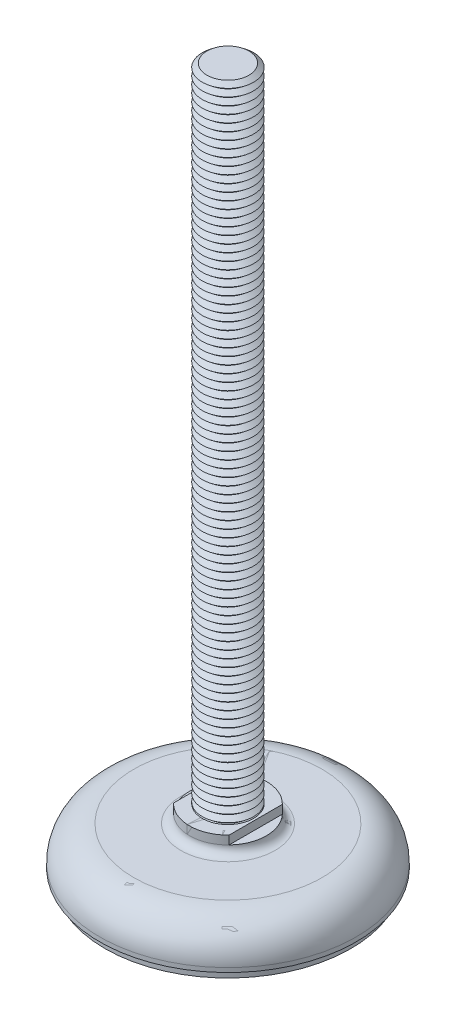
ISO-10303-21;
HEADER;
FILE_DESCRIPTION(('STEP AP214'),'2;1');
FILE_NAME('part.step','',(''),(''),'','','');
FILE_SCHEMA(('AUTOMOTIVE_DESIGN { 1 0 10303 214 1 1 1 1 }'));
ENDSEC;
DATA;
#1=APPLICATION_CONTEXT('core data for automotive mechanical design processes');
#2=APPLICATION_PROTOCOL_DEFINITION('international standard','automotive_design',2000,#1);
#3=PRODUCT_CONTEXT('',#1,'mechanical');
#4=PRODUCT('Part','Part','',(#3));
#5=PRODUCT_RELATED_PRODUCT_CATEGORY('part','',(#4));
#6=PRODUCT_DEFINITION_FORMATION('','',#4);
#7=PRODUCT_DEFINITION_CONTEXT('part definition',#1,'design');
#8=PRODUCT_DEFINITION('design','',#6,#7);
#9=PRODUCT_DEFINITION_SHAPE('','',#8);
#10=(LENGTH_UNIT() NAMED_UNIT(*) SI_UNIT(.MILLI.,.METRE.));
#11=(NAMED_UNIT(*) PLANE_ANGLE_UNIT() SI_UNIT($,.RADIAN.));
#12=(NAMED_UNIT(*) SI_UNIT($,.STERADIAN.) SOLID_ANGLE_UNIT());
#13=UNCERTAINTY_MEASURE_WITH_UNIT(LENGTH_MEASURE(1.E-05),#10,'distance_accuracy_value','');
#14=(GEOMETRIC_REPRESENTATION_CONTEXT(3) GLOBAL_UNCERTAINTY_ASSIGNED_CONTEXT((#13)) GLOBAL_UNIT_ASSIGNED_CONTEXT((#10,
#11,#12)) REPRESENTATION_CONTEXT('',''));
#15=CARTESIAN_POINT('',(0.,0.,0.));
#16=DIRECTION('',(0.,0.,1.));
#17=DIRECTION('',(1.,0.,0.));
#18=AXIS2_PLACEMENT_3D('',#15,#16,#17);
#19=CARTESIAN_POINT('',(0.,160.25,0.));
#20=DIRECTION('',(0.,-1.,0.));
#21=DIRECTION('',(0.998136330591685,0.,-0.0610234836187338));
#22=AXIS2_PLACEMENT_3D('',#19,#20,#21);
#23=CONICAL_SURFACE('',#22,4.90712535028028,0.895664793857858);
#24=CARTESIAN_POINT('',(0.,159.375,0.));
#25=DIRECTION('',(0.,-1.,0.));
#26=DIRECTION('',(0.998136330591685,0.,-0.0610234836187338));
#27=AXIS2_PLACEMENT_3D('',#24,#25,#26);
#28=CIRCLE('',#27,6.);
#29=CARTESIAN_POINT('',(5.98881798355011,159.375,-0.366140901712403));
#30=VERTEX_POINT('',#29);
#31=EDGE_CURVE('P0_E37',#30,#30,#28,.T.);
#32=ORIENTED_EDGE('',*,*,#31,.F.);
#33=EDGE_LOOP('',(#32));
#34=FACE_BOUND('',#33,.T.);
#35=CARTESIAN_POINT('',(0.,160.25,0.));
#36=DIRECTION('',(0.,-1.,0.));
#37=DIRECTION('',(0.998136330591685,0.,-0.0610234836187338));
#38=AXIS2_PLACEMENT_3D('',#35,#36,#37);
#39=CIRCLE('',#38,4.90712535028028);
#40=CARTESIAN_POINT('',(4.8979800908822,160.25,-0.299449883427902));
#41=VERTEX_POINT('',#40);
#42=EDGE_CURVE('P0_E25',#41,#41,#39,.T.);
#43=ORIENTED_EDGE('',*,*,#42,.T.);
#44=EDGE_LOOP('',(#43));
#45=FACE_BOUND('',#44,.T.);
#46=ADVANCED_FACE('P0_F14',(#34,#45),#23,.T.);
#47=CARTESIAN_POINT('',(0.,161.125,0.));
#48=DIRECTION('',(0.,1.,0.));
#49=DIRECTION('',(-0.998136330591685,0.,0.0610234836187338));
#50=AXIS2_PLACEMENT_3D('',#47,#48,#49);
#51=CONICAL_SURFACE('',#50,6.,0.895664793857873);
#52=ORIENTED_EDGE('',*,*,#42,.F.);
#53=EDGE_LOOP('',(#52));
#54=FACE_BOUND('',#53,.T.);
#55=CARTESIAN_POINT('',(0.,161.125,0.));
#56=DIRECTION('',(0.,-1.,0.));
#57=DIRECTION('',(0.998136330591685,0.,-0.0610234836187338));
#58=AXIS2_PLACEMENT_3D('',#55,#56,#57);
#59=CIRCLE('',#58,6.);
#60=CARTESIAN_POINT('',(5.98881798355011,161.125,-0.366140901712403));
#61=VERTEX_POINT('',#60);
#62=EDGE_CURVE('P0_E29',#61,#61,#59,.T.);
#63=ORIENTED_EDGE('',*,*,#62,.T.);
#64=EDGE_LOOP('',(#63));
#65=FACE_BOUND('',#64,.T.);
#66=ADVANCED_FACE('P0_F1627',(#54,#65),#51,.T.);
#67=CARTESIAN_POINT('',(0.,162.,0.));
#68=DIRECTION('',(0.,1.,0.));
#69=DIRECTION('',(-0.998136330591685,0.,0.0610234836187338));
#70=AXIS2_PLACEMENT_3D('',#67,#68,#69);
#71=PLANE('',#70);
#72=CARTESIAN_POINT('',(0.,162.,0.));
#73=DIRECTION('',(0.,-1.,0.));
#74=DIRECTION('',(0.998136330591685,0.,-0.0610234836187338));
#75=AXIS2_PLACEMENT_3D('',#72,#73,#74);
#76=CIRCLE('',#75,4.90712535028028);
#77=CARTESIAN_POINT('',(4.8979800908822,162.,-0.299449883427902));
#78=VERTEX_POINT('',#77);
#79=EDGE_CURVE('P0_E21',#78,#78,#76,.T.);
#80=ORIENTED_EDGE('',*,*,#79,.F.);
#81=EDGE_LOOP('',(#80));
#82=FACE_BOUND('',#81,.T.);
#83=ADVANCED_FACE('P0_F1633',(#82),#71,.T.);
#84=CARTESIAN_POINT('',(0.,162.,0.));
#85=DIRECTION('',(0.,-1.,0.));
#86=DIRECTION('',(0.998136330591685,0.,-0.0610234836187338));
#87=AXIS2_PLACEMENT_3D('',#84,#85,#86);
#88=CONICAL_SURFACE('',#87,4.90712535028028,0.895664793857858);
#89=ORIENTED_EDGE('',*,*,#62,.F.);
#90=EDGE_LOOP('',(#89));
#91=FACE_BOUND('',#90,.T.);
#92=ORIENTED_EDGE('',*,*,#79,.T.);
#93=EDGE_LOOP('',(#92));
#94=FACE_BOUND('',#93,.T.);
#95=ADVANCED_FACE('P0_F1616',(#91,#94),#88,.T.);
#96=CARTESIAN_POINT('',(0.,158.5,0.));
#97=DIRECTION('',(0.,-1.,0.));
#98=DIRECTION('',(0.998136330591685,0.,-0.0610234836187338));
#99=AXIS2_PLACEMENT_3D('',#96,#97,#98);
#100=CONICAL_SURFACE('',#99,4.90712535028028,0.895664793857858);
#101=CARTESIAN_POINT('',(0.,157.625,0.));
#102=DIRECTION('',(0.,-1.,0.));
#103=DIRECTION('',(0.998136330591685,0.,-0.0610234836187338));
#104=AXIS2_PLACEMENT_3D('',#101,#102,#103);
#105=CIRCLE('',#104,6.);
#106=CARTESIAN_POINT('',(5.98881798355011,157.625,-0.366140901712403));
#107=VERTEX_POINT('',#106);
#108=EDGE_CURVE('P0_E43',#107,#107,#105,.T.);
#109=ORIENTED_EDGE('',*,*,#108,.F.);
#110=EDGE_LOOP('',(#109));
#111=FACE_BOUND('',#110,.T.);
#112=CARTESIAN_POINT('',(0.,158.5,0.));
#113=DIRECTION('',(0.,-1.,0.));
#114=DIRECTION('',(0.998136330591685,0.,-0.0610234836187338));
#115=AXIS2_PLACEMENT_3D('',#112,#113,#114);
#116=CIRCLE('',#115,4.90712535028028);
#117=CARTESIAN_POINT('',(4.8979800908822,158.5,-0.299449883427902));
#118=VERTEX_POINT('',#117);
#119=EDGE_CURVE('P0_E34',#118,#118,#116,.T.);
#120=ORIENTED_EDGE('',*,*,#119,.T.);
#121=EDGE_LOOP('',(#120));
#122=FACE_BOUND('',#121,.T.);
#123=ADVANCED_FACE('P0_F1613',(#111,#122),#100,.T.);
#124=CARTESIAN_POINT('',(0.,159.375,0.));
#125=DIRECTION('',(0.,1.,0.));
#126=DIRECTION('',(-0.998136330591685,0.,0.0610234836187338));
#127=AXIS2_PLACEMENT_3D('',#124,#125,#126);
#128=CONICAL_SURFACE('',#127,6.,0.895664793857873);
#129=ORIENTED_EDGE('',*,*,#119,.F.);
#130=EDGE_LOOP('',(#129));
#131=FACE_BOUND('',#130,.T.);
#132=ORIENTED_EDGE('',*,*,#31,.T.);
#133=EDGE_LOOP('',(#132));
#134=FACE_BOUND('',#133,.T.);
#135=ADVANCED_FACE('P0_F1604',(#131,#134),#128,.T.);
#136=CARTESIAN_POINT('',(0.,156.75,0.));
#137=DIRECTION('',(0.,-1.,0.));
#138=DIRECTION('',(0.998136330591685,0.,-0.0610234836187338));
#139=AXIS2_PLACEMENT_3D('',#136,#137,#138);
#140=CONICAL_SURFACE('',#139,4.90712535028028,0.895664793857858);
#141=CARTESIAN_POINT('',(0.,155.875,0.));
#142=DIRECTION('',(0.,-1.,0.));
#143=DIRECTION('',(0.998136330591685,0.,-0.0610234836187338));
#144=AXIS2_PLACEMENT_3D('',#141,#142,#143);
#145=CIRCLE('',#144,6.);
#146=CARTESIAN_POINT('',(5.98881798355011,155.875,-0.366140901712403));
#147=VERTEX_POINT('',#146);
#148=EDGE_CURVE('P0_E49',#147,#147,#145,.T.);
#149=ORIENTED_EDGE('',*,*,#148,.F.);
#150=EDGE_LOOP('',(#149));
#151=FACE_BOUND('',#150,.T.);
#152=CARTESIAN_POINT('',(0.,156.75,0.));
#153=DIRECTION('',(0.,-1.,0.));
#154=DIRECTION('',(0.998136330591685,0.,-0.0610234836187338));
#155=AXIS2_PLACEMENT_3D('',#152,#153,#154);
#156=CIRCLE('',#155,4.90712535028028);
#157=CARTESIAN_POINT('',(4.8979800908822,156.75,-0.299449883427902));
#158=VERTEX_POINT('',#157);
#159=EDGE_CURVE('P0_E40',#158,#158,#156,.T.);
#160=ORIENTED_EDGE('',*,*,#159,.T.);
#161=EDGE_LOOP('',(#160));
#162=FACE_BOUND('',#161,.T.);
#163=ADVANCED_FACE('P0_F1601',(#151,#162),#140,.T.);
#164=CARTESIAN_POINT('',(0.,157.625,0.));
#165=DIRECTION('',(0.,1.,0.));
#166=DIRECTION('',(-0.998136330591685,0.,0.0610234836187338));
#167=AXIS2_PLACEMENT_3D('',#164,#165,#166);
#168=CONICAL_SURFACE('',#167,6.,0.895664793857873);
#169=ORIENTED_EDGE('',*,*,#159,.F.);
#170=EDGE_LOOP('',(#169));
#171=FACE_BOUND('',#170,.T.);
#172=ORIENTED_EDGE('',*,*,#108,.T.);
#173=EDGE_LOOP('',(#172));
#174=FACE_BOUND('',#173,.T.);
#175=ADVANCED_FACE('P0_F1592',(#171,#174),#168,.T.);
#176=CARTESIAN_POINT('',(0.,155.,0.));
#177=DIRECTION('',(0.,-1.,0.));
#178=DIRECTION('',(0.998136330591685,0.,-0.0610234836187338));
#179=AXIS2_PLACEMENT_3D('',#176,#177,#178);
#180=CONICAL_SURFACE('',#179,4.90712535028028,0.895664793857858);
#181=CARTESIAN_POINT('',(0.,154.125,0.));
#182=DIRECTION('',(0.,-1.,0.));
#183=DIRECTION('',(0.998136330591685,0.,-0.0610234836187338));
#184=AXIS2_PLACEMENT_3D('',#181,#182,#183);
#185=CIRCLE('',#184,6.);
#186=CARTESIAN_POINT('',(5.98881798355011,154.125,-0.366140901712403));
#187=VERTEX_POINT('',#186);
#188=EDGE_CURVE('P0_E55',#187,#187,#185,.T.);
#189=ORIENTED_EDGE('',*,*,#188,.F.);
#190=EDGE_LOOP('',(#189));
#191=FACE_BOUND('',#190,.T.);
#192=CARTESIAN_POINT('',(0.,155.,0.));
#193=DIRECTION('',(0.,-1.,0.));
#194=DIRECTION('',(0.998136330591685,0.,-0.0610234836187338));
#195=AXIS2_PLACEMENT_3D('',#192,#193,#194);
#196=CIRCLE('',#195,4.90712535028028);
#197=CARTESIAN_POINT('',(4.8979800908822,155.,-0.299449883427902));
#198=VERTEX_POINT('',#197);
#199=EDGE_CURVE('P0_E46',#198,#198,#196,.T.);
#200=ORIENTED_EDGE('',*,*,#199,.T.);
#201=EDGE_LOOP('',(#200));
#202=FACE_BOUND('',#201,.T.);
#203=ADVANCED_FACE('P0_F1589',(#191,#202),#180,.T.);
#204=CARTESIAN_POINT('',(0.,155.875,0.));
#205=DIRECTION('',(0.,1.,0.));
#206=DIRECTION('',(-0.998136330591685,0.,0.0610234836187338));
#207=AXIS2_PLACEMENT_3D('',#204,#205,#206);
#208=CONICAL_SURFACE('',#207,6.,0.895664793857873);
#209=ORIENTED_EDGE('',*,*,#199,.F.);
#210=EDGE_LOOP('',(#209));
#211=FACE_BOUND('',#210,.T.);
#212=ORIENTED_EDGE('',*,*,#148,.T.);
#213=EDGE_LOOP('',(#212));
#214=FACE_BOUND('',#213,.T.);
#215=ADVANCED_FACE('P0_F1580',(#211,#214),#208,.T.);
#216=CARTESIAN_POINT('',(0.,153.25,0.));
#217=DIRECTION('',(0.,-1.,0.));
#218=DIRECTION('',(0.998136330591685,0.,-0.0610234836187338));
#219=AXIS2_PLACEMENT_3D('',#216,#217,#218);
#220=CONICAL_SURFACE('',#219,4.90712535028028,0.895664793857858);
#221=CARTESIAN_POINT('',(0.,152.375,0.));
#222=DIRECTION('',(0.,-1.,0.));
#223=DIRECTION('',(0.998136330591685,0.,-0.0610234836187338));
#224=AXIS2_PLACEMENT_3D('',#221,#222,#223);
#225=CIRCLE('',#224,6.);
#226=CARTESIAN_POINT('',(5.98881798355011,152.375,-0.366140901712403));
#227=VERTEX_POINT('',#226);
#228=EDGE_CURVE('P0_E61',#227,#227,#225,.T.);
#229=ORIENTED_EDGE('',*,*,#228,.F.);
#230=EDGE_LOOP('',(#229));
#231=FACE_BOUND('',#230,.T.);
#232=CARTESIAN_POINT('',(0.,153.25,0.));
#233=DIRECTION('',(0.,-1.,0.));
#234=DIRECTION('',(0.998136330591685,0.,-0.0610234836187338));
#235=AXIS2_PLACEMENT_3D('',#232,#233,#234);
#236=CIRCLE('',#235,4.90712535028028);
#237=CARTESIAN_POINT('',(4.8979800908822,153.25,-0.299449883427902));
#238=VERTEX_POINT('',#237);
#239=EDGE_CURVE('P0_E52',#238,#238,#236,.T.);
#240=ORIENTED_EDGE('',*,*,#239,.T.);
#241=EDGE_LOOP('',(#240));
#242=FACE_BOUND('',#241,.T.);
#243=ADVANCED_FACE('P0_F1577',(#231,#242),#220,.T.);
#244=CARTESIAN_POINT('',(0.,154.125,0.));
#245=DIRECTION('',(0.,1.,0.));
#246=DIRECTION('',(-0.998136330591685,0.,0.0610234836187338));
#247=AXIS2_PLACEMENT_3D('',#244,#245,#246);
#248=CONICAL_SURFACE('',#247,6.,0.895664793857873);
#249=ORIENTED_EDGE('',*,*,#239,.F.);
#250=EDGE_LOOP('',(#249));
#251=FACE_BOUND('',#250,.T.);
#252=ORIENTED_EDGE('',*,*,#188,.T.);
#253=EDGE_LOOP('',(#252));
#254=FACE_BOUND('',#253,.T.);
#255=ADVANCED_FACE('P0_F1568',(#251,#254),#248,.T.);
#256=CARTESIAN_POINT('',(0.,151.5,0.));
#257=DIRECTION('',(0.,-1.,0.));
#258=DIRECTION('',(0.998136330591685,0.,-0.0610234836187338));
#259=AXIS2_PLACEMENT_3D('',#256,#257,#258);
#260=CONICAL_SURFACE('',#259,4.90712535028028,0.895664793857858);
#261=CARTESIAN_POINT('',(0.,150.625,0.));
#262=DIRECTION('',(0.,-1.,0.));
#263=DIRECTION('',(0.998136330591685,0.,-0.0610234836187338));
#264=AXIS2_PLACEMENT_3D('',#261,#262,#263);
#265=CIRCLE('',#264,6.);
#266=CARTESIAN_POINT('',(5.98881798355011,150.625,-0.366140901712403));
#267=VERTEX_POINT('',#266);
#268=EDGE_CURVE('P0_E67',#267,#267,#265,.T.);
#269=ORIENTED_EDGE('',*,*,#268,.F.);
#270=EDGE_LOOP('',(#269));
#271=FACE_BOUND('',#270,.T.);
#272=CARTESIAN_POINT('',(0.,151.5,0.));
#273=DIRECTION('',(0.,-1.,0.));
#274=DIRECTION('',(0.998136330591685,0.,-0.0610234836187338));
#275=AXIS2_PLACEMENT_3D('',#272,#273,#274);
#276=CIRCLE('',#275,4.90712535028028);
#277=CARTESIAN_POINT('',(4.8979800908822,151.5,-0.299449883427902));
#278=VERTEX_POINT('',#277);
#279=EDGE_CURVE('P0_E58',#278,#278,#276,.T.);
#280=ORIENTED_EDGE('',*,*,#279,.T.);
#281=EDGE_LOOP('',(#280));
#282=FACE_BOUND('',#281,.T.);
#283=ADVANCED_FACE('P0_F1565',(#271,#282),#260,.T.);
#284=CARTESIAN_POINT('',(0.,152.375,0.));
#285=DIRECTION('',(0.,1.,0.));
#286=DIRECTION('',(-0.998136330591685,0.,0.0610234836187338));
#287=AXIS2_PLACEMENT_3D('',#284,#285,#286);
#288=CONICAL_SURFACE('',#287,6.,0.895664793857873);
#289=ORIENTED_EDGE('',*,*,#279,.F.);
#290=EDGE_LOOP('',(#289));
#291=FACE_BOUND('',#290,.T.);
#292=ORIENTED_EDGE('',*,*,#228,.T.);
#293=EDGE_LOOP('',(#292));
#294=FACE_BOUND('',#293,.T.);
#295=ADVANCED_FACE('P0_F1556',(#291,#294),#288,.T.);
#296=CARTESIAN_POINT('',(0.,149.75,0.));
#297=DIRECTION('',(0.,-1.,0.));
#298=DIRECTION('',(0.998136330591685,0.,-0.0610234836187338));
#299=AXIS2_PLACEMENT_3D('',#296,#297,#298);
#300=CONICAL_SURFACE('',#299,4.90712535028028,0.895664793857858);
#301=CARTESIAN_POINT('',(0.,148.875,0.));
#302=DIRECTION('',(0.,-1.,0.));
#303=DIRECTION('',(0.998136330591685,0.,-0.0610234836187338));
#304=AXIS2_PLACEMENT_3D('',#301,#302,#303);
#305=CIRCLE('',#304,6.);
#306=CARTESIAN_POINT('',(5.98881798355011,148.875,-0.366140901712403));
#307=VERTEX_POINT('',#306);
#308=EDGE_CURVE('P0_E73',#307,#307,#305,.T.);
#309=ORIENTED_EDGE('',*,*,#308,.F.);
#310=EDGE_LOOP('',(#309));
#311=FACE_BOUND('',#310,.T.);
#312=CARTESIAN_POINT('',(0.,149.75,0.));
#313=DIRECTION('',(0.,-1.,0.));
#314=DIRECTION('',(0.998136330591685,0.,-0.0610234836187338));
#315=AXIS2_PLACEMENT_3D('',#312,#313,#314);
#316=CIRCLE('',#315,4.90712535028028);
#317=CARTESIAN_POINT('',(4.8979800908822,149.75,-0.299449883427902));
#318=VERTEX_POINT('',#317);
#319=EDGE_CURVE('P0_E64',#318,#318,#316,.T.);
#320=ORIENTED_EDGE('',*,*,#319,.T.);
#321=EDGE_LOOP('',(#320));
#322=FACE_BOUND('',#321,.T.);
#323=ADVANCED_FACE('P0_F1553',(#311,#322),#300,.T.);
#324=CARTESIAN_POINT('',(0.,150.625,0.));
#325=DIRECTION('',(0.,1.,0.));
#326=DIRECTION('',(-0.998136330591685,0.,0.0610234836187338));
#327=AXIS2_PLACEMENT_3D('',#324,#325,#326);
#328=CONICAL_SURFACE('',#327,6.,0.895664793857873);
#329=ORIENTED_EDGE('',*,*,#319,.F.);
#330=EDGE_LOOP('',(#329));
#331=FACE_BOUND('',#330,.T.);
#332=ORIENTED_EDGE('',*,*,#268,.T.);
#333=EDGE_LOOP('',(#332));
#334=FACE_BOUND('',#333,.T.);
#335=ADVANCED_FACE('P0_F1544',(#331,#334),#328,.T.);
#336=CARTESIAN_POINT('',(0.,148.,0.));
#337=DIRECTION('',(0.,-1.,0.));
#338=DIRECTION('',(0.998136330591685,0.,-0.0610234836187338));
#339=AXIS2_PLACEMENT_3D('',#336,#337,#338);
#340=CONICAL_SURFACE('',#339,4.90712535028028,0.895664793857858);
#341=CARTESIAN_POINT('',(0.,147.125,0.));
#342=DIRECTION('',(0.,-1.,0.));
#343=DIRECTION('',(0.998136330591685,0.,-0.0610234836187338));
#344=AXIS2_PLACEMENT_3D('',#341,#342,#343);
#345=CIRCLE('',#344,6.);
#346=CARTESIAN_POINT('',(5.98881798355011,147.125,-0.366140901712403));
#347=VERTEX_POINT('',#346);
#348=EDGE_CURVE('P0_E79',#347,#347,#345,.T.);
#349=ORIENTED_EDGE('',*,*,#348,.F.);
#350=EDGE_LOOP('',(#349));
#351=FACE_BOUND('',#350,.T.);
#352=CARTESIAN_POINT('',(0.,148.,0.));
#353=DIRECTION('',(0.,-1.,0.));
#354=DIRECTION('',(0.998136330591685,0.,-0.0610234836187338));
#355=AXIS2_PLACEMENT_3D('',#352,#353,#354);
#356=CIRCLE('',#355,4.90712535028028);
#357=CARTESIAN_POINT('',(4.8979800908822,148.,-0.299449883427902));
#358=VERTEX_POINT('',#357);
#359=EDGE_CURVE('P0_E70',#358,#358,#356,.T.);
#360=ORIENTED_EDGE('',*,*,#359,.T.);
#361=EDGE_LOOP('',(#360));
#362=FACE_BOUND('',#361,.T.);
#363=ADVANCED_FACE('P0_F1541',(#351,#362),#340,.T.);
#364=CARTESIAN_POINT('',(0.,148.875,0.));
#365=DIRECTION('',(0.,1.,0.));
#366=DIRECTION('',(-0.998136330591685,0.,0.0610234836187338));
#367=AXIS2_PLACEMENT_3D('',#364,#365,#366);
#368=CONICAL_SURFACE('',#367,6.,0.895664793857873);
#369=ORIENTED_EDGE('',*,*,#359,.F.);
#370=EDGE_LOOP('',(#369));
#371=FACE_BOUND('',#370,.T.);
#372=ORIENTED_EDGE('',*,*,#308,.T.);
#373=EDGE_LOOP('',(#372));
#374=FACE_BOUND('',#373,.T.);
#375=ADVANCED_FACE('P0_F1532',(#371,#374),#368,.T.);
#376=CARTESIAN_POINT('',(0.,146.25,0.));
#377=DIRECTION('',(0.,-1.,0.));
#378=DIRECTION('',(0.998136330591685,0.,-0.0610234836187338));
#379=AXIS2_PLACEMENT_3D('',#376,#377,#378);
#380=CONICAL_SURFACE('',#379,4.90712535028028,0.895664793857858);
#381=CARTESIAN_POINT('',(0.,145.375,0.));
#382=DIRECTION('',(0.,-1.,0.));
#383=DIRECTION('',(0.998136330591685,0.,-0.0610234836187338));
#384=AXIS2_PLACEMENT_3D('',#381,#382,#383);
#385=CIRCLE('',#384,6.);
#386=CARTESIAN_POINT('',(5.98881798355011,145.375,-0.366140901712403));
#387=VERTEX_POINT('',#386);
#388=EDGE_CURVE('P0_E85',#387,#387,#385,.T.);
#389=ORIENTED_EDGE('',*,*,#388,.F.);
#390=EDGE_LOOP('',(#389));
#391=FACE_BOUND('',#390,.T.);
#392=CARTESIAN_POINT('',(0.,146.25,0.));
#393=DIRECTION('',(0.,-1.,0.));
#394=DIRECTION('',(0.998136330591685,0.,-0.0610234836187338));
#395=AXIS2_PLACEMENT_3D('',#392,#393,#394);
#396=CIRCLE('',#395,4.90712535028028);
#397=CARTESIAN_POINT('',(4.8979800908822,146.25,-0.299449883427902));
#398=VERTEX_POINT('',#397);
#399=EDGE_CURVE('P0_E76',#398,#398,#396,.T.);
#400=ORIENTED_EDGE('',*,*,#399,.T.);
#401=EDGE_LOOP('',(#400));
#402=FACE_BOUND('',#401,.T.);
#403=ADVANCED_FACE('P0_F1529',(#391,#402),#380,.T.);
#404=CARTESIAN_POINT('',(0.,147.125,0.));
#405=DIRECTION('',(0.,1.,0.));
#406=DIRECTION('',(-0.998136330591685,0.,0.0610234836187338));
#407=AXIS2_PLACEMENT_3D('',#404,#405,#406);
#408=CONICAL_SURFACE('',#407,6.,0.895664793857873);
#409=ORIENTED_EDGE('',*,*,#399,.F.);
#410=EDGE_LOOP('',(#409));
#411=FACE_BOUND('',#410,.T.);
#412=ORIENTED_EDGE('',*,*,#348,.T.);
#413=EDGE_LOOP('',(#412));
#414=FACE_BOUND('',#413,.T.);
#415=ADVANCED_FACE('P0_F1520',(#411,#414),#408,.T.);
#416=CARTESIAN_POINT('',(0.,144.5,0.));
#417=DIRECTION('',(0.,-1.,0.));
#418=DIRECTION('',(0.998136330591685,0.,-0.0610234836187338));
#419=AXIS2_PLACEMENT_3D('',#416,#417,#418);
#420=CONICAL_SURFACE('',#419,4.90712535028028,0.895664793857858);
#421=CARTESIAN_POINT('',(0.,143.625,0.));
#422=DIRECTION('',(0.,-1.,0.));
#423=DIRECTION('',(0.998136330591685,0.,-0.0610234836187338));
#424=AXIS2_PLACEMENT_3D('',#421,#422,#423);
#425=CIRCLE('',#424,6.);
#426=CARTESIAN_POINT('',(5.98881798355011,143.625,-0.366140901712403));
#427=VERTEX_POINT('',#426);
#428=EDGE_CURVE('P0_E91',#427,#427,#425,.T.);
#429=ORIENTED_EDGE('',*,*,#428,.F.);
#430=EDGE_LOOP('',(#429));
#431=FACE_BOUND('',#430,.T.);
#432=CARTESIAN_POINT('',(0.,144.5,0.));
#433=DIRECTION('',(0.,-1.,0.));
#434=DIRECTION('',(0.998136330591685,0.,-0.0610234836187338));
#435=AXIS2_PLACEMENT_3D('',#432,#433,#434);
#436=CIRCLE('',#435,4.90712535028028);
#437=CARTESIAN_POINT('',(4.8979800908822,144.5,-0.299449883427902));
#438=VERTEX_POINT('',#437);
#439=EDGE_CURVE('P0_E82',#438,#438,#436,.T.);
#440=ORIENTED_EDGE('',*,*,#439,.T.);
#441=EDGE_LOOP('',(#440));
#442=FACE_BOUND('',#441,.T.);
#443=ADVANCED_FACE('P0_F1517',(#431,#442),#420,.T.);
#444=CARTESIAN_POINT('',(0.,145.375,0.));
#445=DIRECTION('',(0.,1.,0.));
#446=DIRECTION('',(-0.998136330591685,0.,0.0610234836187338));
#447=AXIS2_PLACEMENT_3D('',#444,#445,#446);
#448=CONICAL_SURFACE('',#447,6.,0.895664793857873);
#449=ORIENTED_EDGE('',*,*,#439,.F.);
#450=EDGE_LOOP('',(#449));
#451=FACE_BOUND('',#450,.T.);
#452=ORIENTED_EDGE('',*,*,#388,.T.);
#453=EDGE_LOOP('',(#452));
#454=FACE_BOUND('',#453,.T.);
#455=ADVANCED_FACE('P0_F1508',(#451,#454),#448,.T.);
#456=CARTESIAN_POINT('',(0.,142.75,0.));
#457=DIRECTION('',(0.,-1.,0.));
#458=DIRECTION('',(0.998136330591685,0.,-0.0610234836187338));
#459=AXIS2_PLACEMENT_3D('',#456,#457,#458);
#460=CONICAL_SURFACE('',#459,4.90712535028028,0.895664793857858);
#461=CARTESIAN_POINT('',(0.,141.875,0.));
#462=DIRECTION('',(0.,-1.,0.));
#463=DIRECTION('',(0.998136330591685,0.,-0.0610234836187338));
#464=AXIS2_PLACEMENT_3D('',#461,#462,#463);
#465=CIRCLE('',#464,6.);
#466=CARTESIAN_POINT('',(5.98881798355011,141.875,-0.366140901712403));
#467=VERTEX_POINT('',#466);
#468=EDGE_CURVE('P0_E97',#467,#467,#465,.T.);
#469=ORIENTED_EDGE('',*,*,#468,.F.);
#470=EDGE_LOOP('',(#469));
#471=FACE_BOUND('',#470,.T.);
#472=CARTESIAN_POINT('',(0.,142.75,0.));
#473=DIRECTION('',(0.,-1.,0.));
#474=DIRECTION('',(0.998136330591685,0.,-0.0610234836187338));
#475=AXIS2_PLACEMENT_3D('',#472,#473,#474);
#476=CIRCLE('',#475,4.90712535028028);
#477=CARTESIAN_POINT('',(4.8979800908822,142.75,-0.299449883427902));
#478=VERTEX_POINT('',#477);
#479=EDGE_CURVE('P0_E88',#478,#478,#476,.T.);
#480=ORIENTED_EDGE('',*,*,#479,.T.);
#481=EDGE_LOOP('',(#480));
#482=FACE_BOUND('',#481,.T.);
#483=ADVANCED_FACE('P0_F1505',(#471,#482),#460,.T.);
#484=CARTESIAN_POINT('',(0.,143.625,0.));
#485=DIRECTION('',(0.,1.,0.));
#486=DIRECTION('',(-0.998136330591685,0.,0.0610234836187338));
#487=AXIS2_PLACEMENT_3D('',#484,#485,#486);
#488=CONICAL_SURFACE('',#487,6.,0.895664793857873);
#489=ORIENTED_EDGE('',*,*,#479,.F.);
#490=EDGE_LOOP('',(#489));
#491=FACE_BOUND('',#490,.T.);
#492=ORIENTED_EDGE('',*,*,#428,.T.);
#493=EDGE_LOOP('',(#492));
#494=FACE_BOUND('',#493,.T.);
#495=ADVANCED_FACE('P0_F1496',(#491,#494),#488,.T.);
#496=CARTESIAN_POINT('',(0.,141.,0.));
#497=DIRECTION('',(0.,-1.,0.));
#498=DIRECTION('',(0.998136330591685,0.,-0.0610234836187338));
#499=AXIS2_PLACEMENT_3D('',#496,#497,#498);
#500=CONICAL_SURFACE('',#499,4.90712535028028,0.895664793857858);
#501=CARTESIAN_POINT('',(0.,140.125,0.));
#502=DIRECTION('',(0.,-1.,0.));
#503=DIRECTION('',(0.998136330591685,0.,-0.0610234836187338));
#504=AXIS2_PLACEMENT_3D('',#501,#502,#503);
#505=CIRCLE('',#504,6.);
#506=CARTESIAN_POINT('',(5.98881798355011,140.125,-0.366140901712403));
#507=VERTEX_POINT('',#506);
#508=EDGE_CURVE('P0_E103',#507,#507,#505,.T.);
#509=ORIENTED_EDGE('',*,*,#508,.F.);
#510=EDGE_LOOP('',(#509));
#511=FACE_BOUND('',#510,.T.);
#512=CARTESIAN_POINT('',(0.,141.,0.));
#513=DIRECTION('',(0.,-1.,0.));
#514=DIRECTION('',(0.998136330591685,0.,-0.0610234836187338));
#515=AXIS2_PLACEMENT_3D('',#512,#513,#514);
#516=CIRCLE('',#515,4.90712535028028);
#517=CARTESIAN_POINT('',(4.8979800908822,141.,-0.299449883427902));
#518=VERTEX_POINT('',#517);
#519=EDGE_CURVE('P0_E94',#518,#518,#516,.T.);
#520=ORIENTED_EDGE('',*,*,#519,.T.);
#521=EDGE_LOOP('',(#520));
#522=FACE_BOUND('',#521,.T.);
#523=ADVANCED_FACE('P0_F1493',(#511,#522),#500,.T.);
#524=CARTESIAN_POINT('',(0.,141.875,0.));
#525=DIRECTION('',(0.,1.,0.));
#526=DIRECTION('',(-0.998136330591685,0.,0.0610234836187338));
#527=AXIS2_PLACEMENT_3D('',#524,#525,#526);
#528=CONICAL_SURFACE('',#527,6.,0.895664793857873);
#529=ORIENTED_EDGE('',*,*,#519,.F.);
#530=EDGE_LOOP('',(#529));
#531=FACE_BOUND('',#530,.T.);
#532=ORIENTED_EDGE('',*,*,#468,.T.);
#533=EDGE_LOOP('',(#532));
#534=FACE_BOUND('',#533,.T.);
#535=ADVANCED_FACE('P0_F1484',(#531,#534),#528,.T.);
#536=CARTESIAN_POINT('',(0.,139.25,0.));
#537=DIRECTION('',(0.,-1.,0.));
#538=DIRECTION('',(0.998136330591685,0.,-0.0610234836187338));
#539=AXIS2_PLACEMENT_3D('',#536,#537,#538);
#540=CONICAL_SURFACE('',#539,4.90712535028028,0.895664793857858);
#541=CARTESIAN_POINT('',(0.,138.375,0.));
#542=DIRECTION('',(0.,-1.,0.));
#543=DIRECTION('',(0.998136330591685,0.,-0.0610234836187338));
#544=AXIS2_PLACEMENT_3D('',#541,#542,#543);
#545=CIRCLE('',#544,6.);
#546=CARTESIAN_POINT('',(5.98881798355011,138.375,-0.366140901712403));
#547=VERTEX_POINT('',#546);
#548=EDGE_CURVE('P0_E109',#547,#547,#545,.T.);
#549=ORIENTED_EDGE('',*,*,#548,.F.);
#550=EDGE_LOOP('',(#549));
#551=FACE_BOUND('',#550,.T.);
#552=CARTESIAN_POINT('',(0.,139.25,0.));
#553=DIRECTION('',(0.,-1.,0.));
#554=DIRECTION('',(0.998136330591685,0.,-0.0610234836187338));
#555=AXIS2_PLACEMENT_3D('',#552,#553,#554);
#556=CIRCLE('',#555,4.90712535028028);
#557=CARTESIAN_POINT('',(4.8979800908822,139.25,-0.299449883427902));
#558=VERTEX_POINT('',#557);
#559=EDGE_CURVE('P0_E100',#558,#558,#556,.T.);
#560=ORIENTED_EDGE('',*,*,#559,.T.);
#561=EDGE_LOOP('',(#560));
#562=FACE_BOUND('',#561,.T.);
#563=ADVANCED_FACE('P0_F1481',(#551,#562),#540,.T.);
#564=CARTESIAN_POINT('',(0.,140.125,0.));
#565=DIRECTION('',(0.,1.,0.));
#566=DIRECTION('',(-0.998136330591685,0.,0.0610234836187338));
#567=AXIS2_PLACEMENT_3D('',#564,#565,#566);
#568=CONICAL_SURFACE('',#567,6.,0.895664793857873);
#569=ORIENTED_EDGE('',*,*,#559,.F.);
#570=EDGE_LOOP('',(#569));
#571=FACE_BOUND('',#570,.T.);
#572=ORIENTED_EDGE('',*,*,#508,.T.);
#573=EDGE_LOOP('',(#572));
#574=FACE_BOUND('',#573,.T.);
#575=ADVANCED_FACE('P0_F1472',(#571,#574),#568,.T.);
#576=CARTESIAN_POINT('',(0.,137.5,0.));
#577=DIRECTION('',(0.,-1.,0.));
#578=DIRECTION('',(0.998136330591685,0.,-0.0610234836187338));
#579=AXIS2_PLACEMENT_3D('',#576,#577,#578);
#580=CONICAL_SURFACE('',#579,4.90712535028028,0.895664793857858);
#581=CARTESIAN_POINT('',(0.,136.625,0.));
#582=DIRECTION('',(0.,-1.,0.));
#583=DIRECTION('',(0.998136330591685,0.,-0.0610234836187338));
#584=AXIS2_PLACEMENT_3D('',#581,#582,#583);
#585=CIRCLE('',#584,6.);
#586=CARTESIAN_POINT('',(5.98881798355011,136.625,-0.366140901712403));
#587=VERTEX_POINT('',#586);
#588=EDGE_CURVE('P0_E115',#587,#587,#585,.T.);
#589=ORIENTED_EDGE('',*,*,#588,.F.);
#590=EDGE_LOOP('',(#589));
#591=FACE_BOUND('',#590,.T.);
#592=CARTESIAN_POINT('',(0.,137.5,0.));
#593=DIRECTION('',(0.,-1.,0.));
#594=DIRECTION('',(0.998136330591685,0.,-0.0610234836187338));
#595=AXIS2_PLACEMENT_3D('',#592,#593,#594);
#596=CIRCLE('',#595,4.90712535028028);
#597=CARTESIAN_POINT('',(4.8979800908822,137.5,-0.299449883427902));
#598=VERTEX_POINT('',#597);
#599=EDGE_CURVE('P0_E106',#598,#598,#596,.T.);
#600=ORIENTED_EDGE('',*,*,#599,.T.);
#601=EDGE_LOOP('',(#600));
#602=FACE_BOUND('',#601,.T.);
#603=ADVANCED_FACE('P0_F1469',(#591,#602),#580,.T.);
#604=CARTESIAN_POINT('',(0.,138.375,0.));
#605=DIRECTION('',(0.,1.,0.));
#606=DIRECTION('',(-0.998136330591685,0.,0.0610234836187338));
#607=AXIS2_PLACEMENT_3D('',#604,#605,#606);
#608=CONICAL_SURFACE('',#607,6.,0.895664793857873);
#609=ORIENTED_EDGE('',*,*,#599,.F.);
#610=EDGE_LOOP('',(#609));
#611=FACE_BOUND('',#610,.T.);
#612=ORIENTED_EDGE('',*,*,#548,.T.);
#613=EDGE_LOOP('',(#612));
#614=FACE_BOUND('',#613,.T.);
#615=ADVANCED_FACE('P0_F1460',(#611,#614),#608,.T.);
#616=CARTESIAN_POINT('',(0.,135.75,0.));
#617=DIRECTION('',(0.,-1.,0.));
#618=DIRECTION('',(0.998136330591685,0.,-0.0610234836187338));
#619=AXIS2_PLACEMENT_3D('',#616,#617,#618);
#620=CONICAL_SURFACE('',#619,4.90712535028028,0.895664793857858);
#621=CARTESIAN_POINT('',(0.,134.875,0.));
#622=DIRECTION('',(0.,-1.,0.));
#623=DIRECTION('',(0.998136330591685,0.,-0.0610234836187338));
#624=AXIS2_PLACEMENT_3D('',#621,#622,#623);
#625=CIRCLE('',#624,6.);
#626=CARTESIAN_POINT('',(5.98881798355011,134.875,-0.366140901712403));
#627=VERTEX_POINT('',#626);
#628=EDGE_CURVE('P0_E121',#627,#627,#625,.T.);
#629=ORIENTED_EDGE('',*,*,#628,.F.);
#630=EDGE_LOOP('',(#629));
#631=FACE_BOUND('',#630,.T.);
#632=CARTESIAN_POINT('',(0.,135.75,0.));
#633=DIRECTION('',(0.,-1.,0.));
#634=DIRECTION('',(0.998136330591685,0.,-0.0610234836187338));
#635=AXIS2_PLACEMENT_3D('',#632,#633,#634);
#636=CIRCLE('',#635,4.90712535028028);
#637=CARTESIAN_POINT('',(4.8979800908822,135.75,-0.299449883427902));
#638=VERTEX_POINT('',#637);
#639=EDGE_CURVE('P0_E112',#638,#638,#636,.T.);
#640=ORIENTED_EDGE('',*,*,#639,.T.);
#641=EDGE_LOOP('',(#640));
#642=FACE_BOUND('',#641,.T.);
#643=ADVANCED_FACE('P0_F1457',(#631,#642),#620,.T.);
#644=CARTESIAN_POINT('',(0.,136.625,0.));
#645=DIRECTION('',(0.,1.,0.));
#646=DIRECTION('',(-0.998136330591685,0.,0.0610234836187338));
#647=AXIS2_PLACEMENT_3D('',#644,#645,#646);
#648=CONICAL_SURFACE('',#647,6.,0.895664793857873);
#649=ORIENTED_EDGE('',*,*,#639,.F.);
#650=EDGE_LOOP('',(#649));
#651=FACE_BOUND('',#650,.T.);
#652=ORIENTED_EDGE('',*,*,#588,.T.);
#653=EDGE_LOOP('',(#652));
#654=FACE_BOUND('',#653,.T.);
#655=ADVANCED_FACE('P0_F1448',(#651,#654),#648,.T.);
#656=CARTESIAN_POINT('',(0.,134.,0.));
#657=DIRECTION('',(0.,-1.,0.));
#658=DIRECTION('',(0.998136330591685,0.,-0.0610234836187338));
#659=AXIS2_PLACEMENT_3D('',#656,#657,#658);
#660=CONICAL_SURFACE('',#659,4.90712535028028,0.895664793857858);
#661=CARTESIAN_POINT('',(0.,133.125,0.));
#662=DIRECTION('',(0.,-1.,0.));
#663=DIRECTION('',(0.998136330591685,0.,-0.0610234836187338));
#664=AXIS2_PLACEMENT_3D('',#661,#662,#663);
#665=CIRCLE('',#664,6.);
#666=CARTESIAN_POINT('',(5.98881798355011,133.125,-0.366140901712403));
#667=VERTEX_POINT('',#666);
#668=EDGE_CURVE('P0_E127',#667,#667,#665,.T.);
#669=ORIENTED_EDGE('',*,*,#668,.F.);
#670=EDGE_LOOP('',(#669));
#671=FACE_BOUND('',#670,.T.);
#672=CARTESIAN_POINT('',(0.,134.,0.));
#673=DIRECTION('',(0.,-1.,0.));
#674=DIRECTION('',(0.998136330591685,0.,-0.0610234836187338));
#675=AXIS2_PLACEMENT_3D('',#672,#673,#674);
#676=CIRCLE('',#675,4.90712535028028);
#677=CARTESIAN_POINT('',(4.8979800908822,134.,-0.299449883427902));
#678=VERTEX_POINT('',#677);
#679=EDGE_CURVE('P0_E118',#678,#678,#676,.T.);
#680=ORIENTED_EDGE('',*,*,#679,.T.);
#681=EDGE_LOOP('',(#680));
#682=FACE_BOUND('',#681,.T.);
#683=ADVANCED_FACE('P0_F1445',(#671,#682),#660,.T.);
#684=CARTESIAN_POINT('',(0.,134.875,0.));
#685=DIRECTION('',(0.,1.,0.));
#686=DIRECTION('',(-0.998136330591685,0.,0.0610234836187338));
#687=AXIS2_PLACEMENT_3D('',#684,#685,#686);
#688=CONICAL_SURFACE('',#687,6.,0.895664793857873);
#689=ORIENTED_EDGE('',*,*,#679,.F.);
#690=EDGE_LOOP('',(#689));
#691=FACE_BOUND('',#690,.T.);
#692=ORIENTED_EDGE('',*,*,#628,.T.);
#693=EDGE_LOOP('',(#692));
#694=FACE_BOUND('',#693,.T.);
#695=ADVANCED_FACE('P0_F1436',(#691,#694),#688,.T.);
#696=CARTESIAN_POINT('',(0.,132.25,0.));
#697=DIRECTION('',(0.,-1.,0.));
#698=DIRECTION('',(0.998136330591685,0.,-0.0610234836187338));
#699=AXIS2_PLACEMENT_3D('',#696,#697,#698);
#700=CONICAL_SURFACE('',#699,4.90712535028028,0.895664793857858);
#701=CARTESIAN_POINT('',(0.,131.375,0.));
#702=DIRECTION('',(0.,-1.,0.));
#703=DIRECTION('',(0.998136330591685,0.,-0.0610234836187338));
#704=AXIS2_PLACEMENT_3D('',#701,#702,#703);
#705=CIRCLE('',#704,6.);
#706=CARTESIAN_POINT('',(5.98881798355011,131.375,-0.366140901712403));
#707=VERTEX_POINT('',#706);
#708=EDGE_CURVE('P0_E133',#707,#707,#705,.T.);
#709=ORIENTED_EDGE('',*,*,#708,.F.);
#710=EDGE_LOOP('',(#709));
#711=FACE_BOUND('',#710,.T.);
#712=CARTESIAN_POINT('',(0.,132.25,0.));
#713=DIRECTION('',(0.,-1.,0.));
#714=DIRECTION('',(0.998136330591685,0.,-0.0610234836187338));
#715=AXIS2_PLACEMENT_3D('',#712,#713,#714);
#716=CIRCLE('',#715,4.90712535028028);
#717=CARTESIAN_POINT('',(4.8979800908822,132.25,-0.299449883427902));
#718=VERTEX_POINT('',#717);
#719=EDGE_CURVE('P0_E124',#718,#718,#716,.T.);
#720=ORIENTED_EDGE('',*,*,#719,.T.);
#721=EDGE_LOOP('',(#720));
#722=FACE_BOUND('',#721,.T.);
#723=ADVANCED_FACE('P0_F1433',(#711,#722),#700,.T.);
#724=CARTESIAN_POINT('',(0.,133.125,0.));
#725=DIRECTION('',(0.,1.,0.));
#726=DIRECTION('',(-0.998136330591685,0.,0.0610234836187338));
#727=AXIS2_PLACEMENT_3D('',#724,#725,#726);
#728=CONICAL_SURFACE('',#727,6.,0.895664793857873);
#729=ORIENTED_EDGE('',*,*,#719,.F.);
#730=EDGE_LOOP('',(#729));
#731=FACE_BOUND('',#730,.T.);
#732=ORIENTED_EDGE('',*,*,#668,.T.);
#733=EDGE_LOOP('',(#732));
#734=FACE_BOUND('',#733,.T.);
#735=ADVANCED_FACE('P0_F1424',(#731,#734),#728,.T.);
#736=CARTESIAN_POINT('',(0.,130.5,0.));
#737=DIRECTION('',(0.,-1.,0.));
#738=DIRECTION('',(0.998136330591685,0.,-0.0610234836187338));
#739=AXIS2_PLACEMENT_3D('',#736,#737,#738);
#740=CONICAL_SURFACE('',#739,4.90712535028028,0.895664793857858);
#741=CARTESIAN_POINT('',(0.,129.625,0.));
#742=DIRECTION('',(0.,-1.,0.));
#743=DIRECTION('',(0.998136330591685,0.,-0.0610234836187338));
#744=AXIS2_PLACEMENT_3D('',#741,#742,#743);
#745=CIRCLE('',#744,6.);
#746=CARTESIAN_POINT('',(5.98881798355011,129.625,-0.366140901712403));
#747=VERTEX_POINT('',#746);
#748=EDGE_CURVE('P0_E139',#747,#747,#745,.T.);
#749=ORIENTED_EDGE('',*,*,#748,.F.);
#750=EDGE_LOOP('',(#749));
#751=FACE_BOUND('',#750,.T.);
#752=CARTESIAN_POINT('',(0.,130.5,0.));
#753=DIRECTION('',(0.,-1.,0.));
#754=DIRECTION('',(0.998136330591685,0.,-0.0610234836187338));
#755=AXIS2_PLACEMENT_3D('',#752,#753,#754);
#756=CIRCLE('',#755,4.90712535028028);
#757=CARTESIAN_POINT('',(4.8979800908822,130.5,-0.299449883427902));
#758=VERTEX_POINT('',#757);
#759=EDGE_CURVE('P0_E130',#758,#758,#756,.T.);
#760=ORIENTED_EDGE('',*,*,#759,.T.);
#761=EDGE_LOOP('',(#760));
#762=FACE_BOUND('',#761,.T.);
#763=ADVANCED_FACE('P0_F1421',(#751,#762),#740,.T.);
#764=CARTESIAN_POINT('',(0.,131.375,0.));
#765=DIRECTION('',(0.,1.,0.));
#766=DIRECTION('',(-0.998136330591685,0.,0.0610234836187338));
#767=AXIS2_PLACEMENT_3D('',#764,#765,#766);
#768=CONICAL_SURFACE('',#767,6.,0.895664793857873);
#769=ORIENTED_EDGE('',*,*,#759,.F.);
#770=EDGE_LOOP('',(#769));
#771=FACE_BOUND('',#770,.T.);
#772=ORIENTED_EDGE('',*,*,#708,.T.);
#773=EDGE_LOOP('',(#772));
#774=FACE_BOUND('',#773,.T.);
#775=ADVANCED_FACE('P0_F1412',(#771,#774),#768,.T.);
#776=CARTESIAN_POINT('',(0.,128.75,0.));
#777=DIRECTION('',(0.,-1.,0.));
#778=DIRECTION('',(0.998136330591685,0.,-0.0610234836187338));
#779=AXIS2_PLACEMENT_3D('',#776,#777,#778);
#780=CONICAL_SURFACE('',#779,4.90712535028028,0.895664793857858);
#781=CARTESIAN_POINT('',(0.,127.875,0.));
#782=DIRECTION('',(0.,-1.,0.));
#783=DIRECTION('',(0.998136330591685,0.,-0.0610234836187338));
#784=AXIS2_PLACEMENT_3D('',#781,#782,#783);
#785=CIRCLE('',#784,6.);
#786=CARTESIAN_POINT('',(5.98881798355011,127.875,-0.366140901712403));
#787=VERTEX_POINT('',#786);
#788=EDGE_CURVE('P0_E145',#787,#787,#785,.T.);
#789=ORIENTED_EDGE('',*,*,#788,.F.);
#790=EDGE_LOOP('',(#789));
#791=FACE_BOUND('',#790,.T.);
#792=CARTESIAN_POINT('',(0.,128.75,0.));
#793=DIRECTION('',(0.,-1.,0.));
#794=DIRECTION('',(0.998136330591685,0.,-0.0610234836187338));
#795=AXIS2_PLACEMENT_3D('',#792,#793,#794);
#796=CIRCLE('',#795,4.90712535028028);
#797=CARTESIAN_POINT('',(4.8979800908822,128.75,-0.299449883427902));
#798=VERTEX_POINT('',#797);
#799=EDGE_CURVE('P0_E136',#798,#798,#796,.T.);
#800=ORIENTED_EDGE('',*,*,#799,.T.);
#801=EDGE_LOOP('',(#800));
#802=FACE_BOUND('',#801,.T.);
#803=ADVANCED_FACE('P0_F1409',(#791,#802),#780,.T.);
#804=CARTESIAN_POINT('',(0.,129.625,0.));
#805=DIRECTION('',(0.,1.,0.));
#806=DIRECTION('',(-0.998136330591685,0.,0.0610234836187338));
#807=AXIS2_PLACEMENT_3D('',#804,#805,#806);
#808=CONICAL_SURFACE('',#807,6.,0.895664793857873);
#809=ORIENTED_EDGE('',*,*,#799,.F.);
#810=EDGE_LOOP('',(#809));
#811=FACE_BOUND('',#810,.T.);
#812=ORIENTED_EDGE('',*,*,#748,.T.);
#813=EDGE_LOOP('',(#812));
#814=FACE_BOUND('',#813,.T.);
#815=ADVANCED_FACE('P0_F1400',(#811,#814),#808,.T.);
#816=CARTESIAN_POINT('',(0.,127.,0.));
#817=DIRECTION('',(0.,-1.,0.));
#818=DIRECTION('',(0.998136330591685,0.,-0.0610234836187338));
#819=AXIS2_PLACEMENT_3D('',#816,#817,#818);
#820=CONICAL_SURFACE('',#819,4.90712535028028,0.895664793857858);
#821=CARTESIAN_POINT('',(0.,126.125,0.));
#822=DIRECTION('',(0.,-1.,0.));
#823=DIRECTION('',(0.998136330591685,0.,-0.0610234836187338));
#824=AXIS2_PLACEMENT_3D('',#821,#822,#823);
#825=CIRCLE('',#824,6.);
#826=CARTESIAN_POINT('',(5.98881798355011,126.125,-0.366140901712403));
#827=VERTEX_POINT('',#826);
#828=EDGE_CURVE('P0_E151',#827,#827,#825,.T.);
#829=ORIENTED_EDGE('',*,*,#828,.F.);
#830=EDGE_LOOP('',(#829));
#831=FACE_BOUND('',#830,.T.);
#832=CARTESIAN_POINT('',(0.,127.,0.));
#833=DIRECTION('',(0.,-1.,0.));
#834=DIRECTION('',(0.998136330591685,0.,-0.0610234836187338));
#835=AXIS2_PLACEMENT_3D('',#832,#833,#834);
#836=CIRCLE('',#835,4.90712535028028);
#837=CARTESIAN_POINT('',(4.8979800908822,127.,-0.299449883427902));
#838=VERTEX_POINT('',#837);
#839=EDGE_CURVE('P0_E142',#838,#838,#836,.T.);
#840=ORIENTED_EDGE('',*,*,#839,.T.);
#841=EDGE_LOOP('',(#840));
#842=FACE_BOUND('',#841,.T.);
#843=ADVANCED_FACE('P0_F1397',(#831,#842),#820,.T.);
#844=CARTESIAN_POINT('',(0.,127.875,0.));
#845=DIRECTION('',(0.,1.,0.));
#846=DIRECTION('',(-0.998136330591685,0.,0.0610234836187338));
#847=AXIS2_PLACEMENT_3D('',#844,#845,#846);
#848=CONICAL_SURFACE('',#847,6.,0.895664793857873);
#849=ORIENTED_EDGE('',*,*,#839,.F.);
#850=EDGE_LOOP('',(#849));
#851=FACE_BOUND('',#850,.T.);
#852=ORIENTED_EDGE('',*,*,#788,.T.);
#853=EDGE_LOOP('',(#852));
#854=FACE_BOUND('',#853,.T.);
#855=ADVANCED_FACE('P0_F1388',(#851,#854),#848,.T.);
#856=CARTESIAN_POINT('',(0.,125.25,0.));
#857=DIRECTION('',(0.,-1.,0.));
#858=DIRECTION('',(0.998136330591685,0.,-0.0610234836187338));
#859=AXIS2_PLACEMENT_3D('',#856,#857,#858);
#860=CONICAL_SURFACE('',#859,4.90712535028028,0.895664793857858);
#861=CARTESIAN_POINT('',(0.,124.375,0.));
#862=DIRECTION('',(0.,-1.,0.));
#863=DIRECTION('',(0.998136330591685,0.,-0.0610234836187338));
#864=AXIS2_PLACEMENT_3D('',#861,#862,#863);
#865=CIRCLE('',#864,6.);
#866=CARTESIAN_POINT('',(5.98881798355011,124.375,-0.366140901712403));
#867=VERTEX_POINT('',#866);
#868=EDGE_CURVE('P0_E157',#867,#867,#865,.T.);
#869=ORIENTED_EDGE('',*,*,#868,.F.);
#870=EDGE_LOOP('',(#869));
#871=FACE_BOUND('',#870,.T.);
#872=CARTESIAN_POINT('',(0.,125.25,0.));
#873=DIRECTION('',(0.,-1.,0.));
#874=DIRECTION('',(0.998136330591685,0.,-0.0610234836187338));
#875=AXIS2_PLACEMENT_3D('',#872,#873,#874);
#876=CIRCLE('',#875,4.90712535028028);
#877=CARTESIAN_POINT('',(4.8979800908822,125.25,-0.299449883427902));
#878=VERTEX_POINT('',#877);
#879=EDGE_CURVE('P0_E148',#878,#878,#876,.T.);
#880=ORIENTED_EDGE('',*,*,#879,.T.);
#881=EDGE_LOOP('',(#880));
#882=FACE_BOUND('',#881,.T.);
#883=ADVANCED_FACE('P0_F1385',(#871,#882),#860,.T.);
#884=CARTESIAN_POINT('',(0.,126.125,0.));
#885=DIRECTION('',(0.,1.,0.));
#886=DIRECTION('',(-0.998136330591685,0.,0.0610234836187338));
#887=AXIS2_PLACEMENT_3D('',#884,#885,#886);
#888=CONICAL_SURFACE('',#887,6.,0.895664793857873);
#889=ORIENTED_EDGE('',*,*,#879,.F.);
#890=EDGE_LOOP('',(#889));
#891=FACE_BOUND('',#890,.T.);
#892=ORIENTED_EDGE('',*,*,#828,.T.);
#893=EDGE_LOOP('',(#892));
#894=FACE_BOUND('',#893,.T.);
#895=ADVANCED_FACE('P0_F1376',(#891,#894),#888,.T.);
#896=CARTESIAN_POINT('',(0.,123.5,0.));
#897=DIRECTION('',(0.,-1.,0.));
#898=DIRECTION('',(0.998136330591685,0.,-0.0610234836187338));
#899=AXIS2_PLACEMENT_3D('',#896,#897,#898);
#900=CONICAL_SURFACE('',#899,4.90712535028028,0.895664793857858);
#901=CARTESIAN_POINT('',(0.,122.625,0.));
#902=DIRECTION('',(0.,-1.,0.));
#903=DIRECTION('',(0.998136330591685,0.,-0.0610234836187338));
#904=AXIS2_PLACEMENT_3D('',#901,#902,#903);
#905=CIRCLE('',#904,6.);
#906=CARTESIAN_POINT('',(5.98881798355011,122.625,-0.366140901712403));
#907=VERTEX_POINT('',#906);
#908=EDGE_CURVE('P0_E163',#907,#907,#905,.T.);
#909=ORIENTED_EDGE('',*,*,#908,.F.);
#910=EDGE_LOOP('',(#909));
#911=FACE_BOUND('',#910,.T.);
#912=CARTESIAN_POINT('',(0.,123.5,0.));
#913=DIRECTION('',(0.,-1.,0.));
#914=DIRECTION('',(0.998136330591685,0.,-0.0610234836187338));
#915=AXIS2_PLACEMENT_3D('',#912,#913,#914);
#916=CIRCLE('',#915,4.90712535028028);
#917=CARTESIAN_POINT('',(4.8979800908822,123.5,-0.299449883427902));
#918=VERTEX_POINT('',#917);
#919=EDGE_CURVE('P0_E154',#918,#918,#916,.T.);
#920=ORIENTED_EDGE('',*,*,#919,.T.);
#921=EDGE_LOOP('',(#920));
#922=FACE_BOUND('',#921,.T.);
#923=ADVANCED_FACE('P0_F1373',(#911,#922),#900,.T.);
#924=CARTESIAN_POINT('',(0.,124.375,0.));
#925=DIRECTION('',(0.,1.,0.));
#926=DIRECTION('',(-0.998136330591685,0.,0.0610234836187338));
#927=AXIS2_PLACEMENT_3D('',#924,#925,#926);
#928=CONICAL_SURFACE('',#927,6.,0.895664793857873);
#929=ORIENTED_EDGE('',*,*,#919,.F.);
#930=EDGE_LOOP('',(#929));
#931=FACE_BOUND('',#930,.T.);
#932=ORIENTED_EDGE('',*,*,#868,.T.);
#933=EDGE_LOOP('',(#932));
#934=FACE_BOUND('',#933,.T.);
#935=ADVANCED_FACE('P0_F1364',(#931,#934),#928,.T.);
#936=CARTESIAN_POINT('',(0.,121.75,0.));
#937=DIRECTION('',(0.,-1.,0.));
#938=DIRECTION('',(0.998136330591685,0.,-0.0610234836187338));
#939=AXIS2_PLACEMENT_3D('',#936,#937,#938);
#940=CONICAL_SURFACE('',#939,4.90712535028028,0.895664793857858);
#941=CARTESIAN_POINT('',(0.,120.875,0.));
#942=DIRECTION('',(0.,-1.,0.));
#943=DIRECTION('',(0.998136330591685,0.,-0.0610234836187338));
#944=AXIS2_PLACEMENT_3D('',#941,#942,#943);
#945=CIRCLE('',#944,6.);
#946=CARTESIAN_POINT('',(5.98881798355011,120.875,-0.366140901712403));
#947=VERTEX_POINT('',#946);
#948=EDGE_CURVE('P0_E169',#947,#947,#945,.T.);
#949=ORIENTED_EDGE('',*,*,#948,.F.);
#950=EDGE_LOOP('',(#949));
#951=FACE_BOUND('',#950,.T.);
#952=CARTESIAN_POINT('',(0.,121.75,0.));
#953=DIRECTION('',(0.,-1.,0.));
#954=DIRECTION('',(0.998136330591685,0.,-0.0610234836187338));
#955=AXIS2_PLACEMENT_3D('',#952,#953,#954);
#956=CIRCLE('',#955,4.90712535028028);
#957=CARTESIAN_POINT('',(4.8979800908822,121.75,-0.299449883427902));
#958=VERTEX_POINT('',#957);
#959=EDGE_CURVE('P0_E160',#958,#958,#956,.T.);
#960=ORIENTED_EDGE('',*,*,#959,.T.);
#961=EDGE_LOOP('',(#960));
#962=FACE_BOUND('',#961,.T.);
#963=ADVANCED_FACE('P0_F1361',(#951,#962),#940,.T.);
#964=CARTESIAN_POINT('',(0.,122.625,0.));
#965=DIRECTION('',(0.,1.,0.));
#966=DIRECTION('',(-0.998136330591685,0.,0.0610234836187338));
#967=AXIS2_PLACEMENT_3D('',#964,#965,#966);
#968=CONICAL_SURFACE('',#967,6.,0.895664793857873);
#969=ORIENTED_EDGE('',*,*,#959,.F.);
#970=EDGE_LOOP('',(#969));
#971=FACE_BOUND('',#970,.T.);
#972=ORIENTED_EDGE('',*,*,#908,.T.);
#973=EDGE_LOOP('',(#972));
#974=FACE_BOUND('',#973,.T.);
#975=ADVANCED_FACE('P0_F1352',(#971,#974),#968,.T.);
#976=CARTESIAN_POINT('',(0.,120.,0.));
#977=DIRECTION('',(0.,-1.,0.));
#978=DIRECTION('',(0.998136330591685,0.,-0.0610234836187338));
#979=AXIS2_PLACEMENT_3D('',#976,#977,#978);
#980=CONICAL_SURFACE('',#979,4.90712535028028,0.895664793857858);
#981=CARTESIAN_POINT('',(0.,119.125,0.));
#982=DIRECTION('',(0.,-1.,0.));
#983=DIRECTION('',(0.998136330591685,0.,-0.0610234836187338));
#984=AXIS2_PLACEMENT_3D('',#981,#982,#983);
#985=CIRCLE('',#984,6.);
#986=CARTESIAN_POINT('',(5.98881798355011,119.125,-0.366140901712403));
#987=VERTEX_POINT('',#986);
#988=EDGE_CURVE('P0_E175',#987,#987,#985,.T.);
#989=ORIENTED_EDGE('',*,*,#988,.F.);
#990=EDGE_LOOP('',(#989));
#991=FACE_BOUND('',#990,.T.);
#992=CARTESIAN_POINT('',(0.,120.,0.));
#993=DIRECTION('',(0.,-1.,0.));
#994=DIRECTION('',(0.998136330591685,0.,-0.0610234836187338));
#995=AXIS2_PLACEMENT_3D('',#992,#993,#994);
#996=CIRCLE('',#995,4.90712535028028);
#997=CARTESIAN_POINT('',(4.8979800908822,120.,-0.299449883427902));
#998=VERTEX_POINT('',#997);
#999=EDGE_CURVE('P0_E166',#998,#998,#996,.T.);
#1000=ORIENTED_EDGE('',*,*,#999,.T.);
#1001=EDGE_LOOP('',(#1000));
#1002=FACE_BOUND('',#1001,.T.);
#1003=ADVANCED_FACE('P0_F1349',(#991,#1002),#980,.T.);
#1004=CARTESIAN_POINT('',(0.,120.875,0.));
#1005=DIRECTION('',(0.,1.,0.));
#1006=DIRECTION('',(-0.998136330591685,0.,0.0610234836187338));
#1007=AXIS2_PLACEMENT_3D('',#1004,#1005,#1006);
#1008=CONICAL_SURFACE('',#1007,6.,0.895664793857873);
#1009=ORIENTED_EDGE('',*,*,#999,.F.);
#1010=EDGE_LOOP('',(#1009));
#1011=FACE_BOUND('',#1010,.T.);
#1012=ORIENTED_EDGE('',*,*,#948,.T.);
#1013=EDGE_LOOP('',(#1012));
#1014=FACE_BOUND('',#1013,.T.);
#1015=ADVANCED_FACE('P0_F1340',(#1011,#1014),#1008,.T.);
#1016=CARTESIAN_POINT('',(0.,118.25,0.));
#1017=DIRECTION('',(0.,-1.,0.));
#1018=DIRECTION('',(0.998136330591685,0.,-0.0610234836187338));
#1019=AXIS2_PLACEMENT_3D('',#1016,#1017,#1018);
#1020=CONICAL_SURFACE('',#1019,4.90712535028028,0.895664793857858);
#1021=CARTESIAN_POINT('',(0.,117.375,0.));
#1022=DIRECTION('',(0.,-1.,0.));
#1023=DIRECTION('',(0.998136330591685,0.,-0.0610234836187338));
#1024=AXIS2_PLACEMENT_3D('',#1021,#1022,#1023);
#1025=CIRCLE('',#1024,6.);
#1026=CARTESIAN_POINT('',(5.98881798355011,117.375,-0.366140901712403));
#1027=VERTEX_POINT('',#1026);
#1028=EDGE_CURVE('P0_E181',#1027,#1027,#1025,.T.);
#1029=ORIENTED_EDGE('',*,*,#1028,.F.);
#1030=EDGE_LOOP('',(#1029));
#1031=FACE_BOUND('',#1030,.T.);
#1032=CARTESIAN_POINT('',(0.,118.25,0.));
#1033=DIRECTION('',(0.,-1.,0.));
#1034=DIRECTION('',(0.998136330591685,0.,-0.0610234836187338));
#1035=AXIS2_PLACEMENT_3D('',#1032,#1033,#1034);
#1036=CIRCLE('',#1035,4.90712535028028);
#1037=CARTESIAN_POINT('',(4.8979800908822,118.25,-0.299449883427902));
#1038=VERTEX_POINT('',#1037);
#1039=EDGE_CURVE('P0_E172',#1038,#1038,#1036,.T.);
#1040=ORIENTED_EDGE('',*,*,#1039,.T.);
#1041=EDGE_LOOP('',(#1040));
#1042=FACE_BOUND('',#1041,.T.);
#1043=ADVANCED_FACE('P0_F1337',(#1031,#1042),#1020,.T.);
#1044=CARTESIAN_POINT('',(0.,119.125,0.));
#1045=DIRECTION('',(0.,1.,0.));
#1046=DIRECTION('',(-0.998136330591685,0.,0.0610234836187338));
#1047=AXIS2_PLACEMENT_3D('',#1044,#1045,#1046);
#1048=CONICAL_SURFACE('',#1047,6.,0.895664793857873);
#1049=ORIENTED_EDGE('',*,*,#1039,.F.);
#1050=EDGE_LOOP('',(#1049));
#1051=FACE_BOUND('',#1050,.T.);
#1052=ORIENTED_EDGE('',*,*,#988,.T.);
#1053=EDGE_LOOP('',(#1052));
#1054=FACE_BOUND('',#1053,.T.);
#1055=ADVANCED_FACE('P0_F1328',(#1051,#1054),#1048,.T.);
#1056=CARTESIAN_POINT('',(0.,116.5,0.));
#1057=DIRECTION('',(0.,-1.,0.));
#1058=DIRECTION('',(0.998136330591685,0.,-0.0610234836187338));
#1059=AXIS2_PLACEMENT_3D('',#1056,#1057,#1058);
#1060=CONICAL_SURFACE('',#1059,4.90712535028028,0.895664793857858);
#1061=CARTESIAN_POINT('',(0.,115.625,0.));
#1062=DIRECTION('',(0.,-1.,0.));
#1063=DIRECTION('',(0.998136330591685,0.,-0.0610234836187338));
#1064=AXIS2_PLACEMENT_3D('',#1061,#1062,#1063);
#1065=CIRCLE('',#1064,6.);
#1066=CARTESIAN_POINT('',(5.98881798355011,115.625,-0.366140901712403));
#1067=VERTEX_POINT('',#1066);
#1068=EDGE_CURVE('P0_E187',#1067,#1067,#1065,.T.);
#1069=ORIENTED_EDGE('',*,*,#1068,.F.);
#1070=EDGE_LOOP('',(#1069));
#1071=FACE_BOUND('',#1070,.T.);
#1072=CARTESIAN_POINT('',(0.,116.5,0.));
#1073=DIRECTION('',(0.,-1.,0.));
#1074=DIRECTION('',(0.998136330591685,0.,-0.0610234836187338));
#1075=AXIS2_PLACEMENT_3D('',#1072,#1073,#1074);
#1076=CIRCLE('',#1075,4.90712535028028);
#1077=CARTESIAN_POINT('',(4.8979800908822,116.5,-0.299449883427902));
#1078=VERTEX_POINT('',#1077);
#1079=EDGE_CURVE('P0_E178',#1078,#1078,#1076,.T.);
#1080=ORIENTED_EDGE('',*,*,#1079,.T.);
#1081=EDGE_LOOP('',(#1080));
#1082=FACE_BOUND('',#1081,.T.);
#1083=ADVANCED_FACE('P0_F1325',(#1071,#1082),#1060,.T.);
#1084=CARTESIAN_POINT('',(0.,117.375,0.));
#1085=DIRECTION('',(0.,1.,0.));
#1086=DIRECTION('',(-0.998136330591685,0.,0.0610234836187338));
#1087=AXIS2_PLACEMENT_3D('',#1084,#1085,#1086);
#1088=CONICAL_SURFACE('',#1087,6.,0.895664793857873);
#1089=ORIENTED_EDGE('',*,*,#1079,.F.);
#1090=EDGE_LOOP('',(#1089));
#1091=FACE_BOUND('',#1090,.T.);
#1092=ORIENTED_EDGE('',*,*,#1028,.T.);
#1093=EDGE_LOOP('',(#1092));
#1094=FACE_BOUND('',#1093,.T.);
#1095=ADVANCED_FACE('P0_F1316',(#1091,#1094),#1088,.T.);
#1096=CARTESIAN_POINT('',(0.,114.75,0.));
#1097=DIRECTION('',(0.,-1.,0.));
#1098=DIRECTION('',(0.998136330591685,0.,-0.0610234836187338));
#1099=AXIS2_PLACEMENT_3D('',#1096,#1097,#1098);
#1100=CONICAL_SURFACE('',#1099,4.90712535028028,0.895664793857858);
#1101=CARTESIAN_POINT('',(0.,113.875,0.));
#1102=DIRECTION('',(0.,-1.,0.));
#1103=DIRECTION('',(0.998136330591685,0.,-0.0610234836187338));
#1104=AXIS2_PLACEMENT_3D('',#1101,#1102,#1103);
#1105=CIRCLE('',#1104,6.);
#1106=CARTESIAN_POINT('',(5.98881798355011,113.875,-0.366140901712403));
#1107=VERTEX_POINT('',#1106);
#1108=EDGE_CURVE('P0_E193',#1107,#1107,#1105,.T.);
#1109=ORIENTED_EDGE('',*,*,#1108,.F.);
#1110=EDGE_LOOP('',(#1109));
#1111=FACE_BOUND('',#1110,.T.);
#1112=CARTESIAN_POINT('',(0.,114.75,0.));
#1113=DIRECTION('',(0.,-1.,0.));
#1114=DIRECTION('',(0.998136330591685,0.,-0.0610234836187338));
#1115=AXIS2_PLACEMENT_3D('',#1112,#1113,#1114);
#1116=CIRCLE('',#1115,4.90712535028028);
#1117=CARTESIAN_POINT('',(4.8979800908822,114.75,-0.299449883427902));
#1118=VERTEX_POINT('',#1117);
#1119=EDGE_CURVE('P0_E184',#1118,#1118,#1116,.T.);
#1120=ORIENTED_EDGE('',*,*,#1119,.T.);
#1121=EDGE_LOOP('',(#1120));
#1122=FACE_BOUND('',#1121,.T.);
#1123=ADVANCED_FACE('P0_F1313',(#1111,#1122),#1100,.T.);
#1124=CARTESIAN_POINT('',(0.,115.625,0.));
#1125=DIRECTION('',(0.,1.,0.));
#1126=DIRECTION('',(-0.998136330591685,0.,0.0610234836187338));
#1127=AXIS2_PLACEMENT_3D('',#1124,#1125,#1126);
#1128=CONICAL_SURFACE('',#1127,6.,0.895664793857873);
#1129=ORIENTED_EDGE('',*,*,#1119,.F.);
#1130=EDGE_LOOP('',(#1129));
#1131=FACE_BOUND('',#1130,.T.);
#1132=ORIENTED_EDGE('',*,*,#1068,.T.);
#1133=EDGE_LOOP('',(#1132));
#1134=FACE_BOUND('',#1133,.T.);
#1135=ADVANCED_FACE('P0_F1304',(#1131,#1134),#1128,.T.);
#1136=CARTESIAN_POINT('',(0.,113.,0.));
#1137=DIRECTION('',(0.,-1.,0.));
#1138=DIRECTION('',(0.998136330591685,0.,-0.0610234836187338));
#1139=AXIS2_PLACEMENT_3D('',#1136,#1137,#1138);
#1140=CONICAL_SURFACE('',#1139,4.90712535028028,0.895664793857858);
#1141=CARTESIAN_POINT('',(0.,112.125,0.));
#1142=DIRECTION('',(0.,-1.,0.));
#1143=DIRECTION('',(0.998136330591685,0.,-0.0610234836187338));
#1144=AXIS2_PLACEMENT_3D('',#1141,#1142,#1143);
#1145=CIRCLE('',#1144,6.);
#1146=CARTESIAN_POINT('',(5.98881798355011,112.125,-0.366140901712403));
#1147=VERTEX_POINT('',#1146);
#1148=EDGE_CURVE('P0_E199',#1147,#1147,#1145,.T.);
#1149=ORIENTED_EDGE('',*,*,#1148,.F.);
#1150=EDGE_LOOP('',(#1149));
#1151=FACE_BOUND('',#1150,.T.);
#1152=CARTESIAN_POINT('',(0.,113.,0.));
#1153=DIRECTION('',(0.,-1.,0.));
#1154=DIRECTION('',(0.998136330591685,0.,-0.0610234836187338));
#1155=AXIS2_PLACEMENT_3D('',#1152,#1153,#1154);
#1156=CIRCLE('',#1155,4.90712535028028);
#1157=CARTESIAN_POINT('',(4.8979800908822,113.,-0.299449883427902));
#1158=VERTEX_POINT('',#1157);
#1159=EDGE_CURVE('P0_E190',#1158,#1158,#1156,.T.);
#1160=ORIENTED_EDGE('',*,*,#1159,.T.);
#1161=EDGE_LOOP('',(#1160));
#1162=FACE_BOUND('',#1161,.T.);
#1163=ADVANCED_FACE('P0_F1301',(#1151,#1162),#1140,.T.);
#1164=CARTESIAN_POINT('',(0.,113.875,0.));
#1165=DIRECTION('',(0.,1.,0.));
#1166=DIRECTION('',(-0.998136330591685,0.,0.0610234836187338));
#1167=AXIS2_PLACEMENT_3D('',#1164,#1165,#1166);
#1168=CONICAL_SURFACE('',#1167,6.,0.895664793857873);
#1169=ORIENTED_EDGE('',*,*,#1159,.F.);
#1170=EDGE_LOOP('',(#1169));
#1171=FACE_BOUND('',#1170,.T.);
#1172=ORIENTED_EDGE('',*,*,#1108,.T.);
#1173=EDGE_LOOP('',(#1172));
#1174=FACE_BOUND('',#1173,.T.);
#1175=ADVANCED_FACE('P0_F1292',(#1171,#1174),#1168,.T.);
#1176=CARTESIAN_POINT('',(0.,111.25,0.));
#1177=DIRECTION('',(0.,-1.,0.));
#1178=DIRECTION('',(0.998136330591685,0.,-0.0610234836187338));
#1179=AXIS2_PLACEMENT_3D('',#1176,#1177,#1178);
#1180=CONICAL_SURFACE('',#1179,4.90712535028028,0.895664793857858);
#1181=CARTESIAN_POINT('',(0.,110.375,0.));
#1182=DIRECTION('',(0.,-1.,0.));
#1183=DIRECTION('',(0.998136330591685,0.,-0.0610234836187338));
#1184=AXIS2_PLACEMENT_3D('',#1181,#1182,#1183);
#1185=CIRCLE('',#1184,6.);
#1186=CARTESIAN_POINT('',(5.98881798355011,110.375,-0.366140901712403));
#1187=VERTEX_POINT('',#1186);
#1188=EDGE_CURVE('P0_E205',#1187,#1187,#1185,.T.);
#1189=ORIENTED_EDGE('',*,*,#1188,.F.);
#1190=EDGE_LOOP('',(#1189));
#1191=FACE_BOUND('',#1190,.T.);
#1192=CARTESIAN_POINT('',(0.,111.25,0.));
#1193=DIRECTION('',(0.,-1.,0.));
#1194=DIRECTION('',(0.998136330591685,0.,-0.0610234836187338));
#1195=AXIS2_PLACEMENT_3D('',#1192,#1193,#1194);
#1196=CIRCLE('',#1195,4.90712535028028);
#1197=CARTESIAN_POINT('',(4.8979800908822,111.25,-0.299449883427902));
#1198=VERTEX_POINT('',#1197);
#1199=EDGE_CURVE('P0_E196',#1198,#1198,#1196,.T.);
#1200=ORIENTED_EDGE('',*,*,#1199,.T.);
#1201=EDGE_LOOP('',(#1200));
#1202=FACE_BOUND('',#1201,.T.);
#1203=ADVANCED_FACE('P0_F1289',(#1191,#1202),#1180,.T.);
#1204=CARTESIAN_POINT('',(0.,112.125,0.));
#1205=DIRECTION('',(0.,1.,0.));
#1206=DIRECTION('',(-0.998136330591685,0.,0.0610234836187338));
#1207=AXIS2_PLACEMENT_3D('',#1204,#1205,#1206);
#1208=CONICAL_SURFACE('',#1207,6.,0.895664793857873);
#1209=ORIENTED_EDGE('',*,*,#1199,.F.);
#1210=EDGE_LOOP('',(#1209));
#1211=FACE_BOUND('',#1210,.T.);
#1212=ORIENTED_EDGE('',*,*,#1148,.T.);
#1213=EDGE_LOOP('',(#1212));
#1214=FACE_BOUND('',#1213,.T.);
#1215=ADVANCED_FACE('P0_F1280',(#1211,#1214),#1208,.T.);
#1216=CARTESIAN_POINT('',(0.,109.5,0.));
#1217=DIRECTION('',(0.,-1.,0.));
#1218=DIRECTION('',(0.998136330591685,0.,-0.0610234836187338));
#1219=AXIS2_PLACEMENT_3D('',#1216,#1217,#1218);
#1220=CONICAL_SURFACE('',#1219,4.90712535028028,0.895664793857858);
#1221=CARTESIAN_POINT('',(0.,108.625,0.));
#1222=DIRECTION('',(0.,-1.,0.));
#1223=DIRECTION('',(0.998136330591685,0.,-0.0610234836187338));
#1224=AXIS2_PLACEMENT_3D('',#1221,#1222,#1223);
#1225=CIRCLE('',#1224,6.);
#1226=CARTESIAN_POINT('',(5.98881798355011,108.625,-0.366140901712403));
#1227=VERTEX_POINT('',#1226);
#1228=EDGE_CURVE('P0_E211',#1227,#1227,#1225,.T.);
#1229=ORIENTED_EDGE('',*,*,#1228,.F.);
#1230=EDGE_LOOP('',(#1229));
#1231=FACE_BOUND('',#1230,.T.);
#1232=CARTESIAN_POINT('',(0.,109.5,0.));
#1233=DIRECTION('',(0.,-1.,0.));
#1234=DIRECTION('',(0.998136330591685,0.,-0.0610234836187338));
#1235=AXIS2_PLACEMENT_3D('',#1232,#1233,#1234);
#1236=CIRCLE('',#1235,4.90712535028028);
#1237=CARTESIAN_POINT('',(4.8979800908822,109.5,-0.299449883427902));
#1238=VERTEX_POINT('',#1237);
#1239=EDGE_CURVE('P0_E202',#1238,#1238,#1236,.T.);
#1240=ORIENTED_EDGE('',*,*,#1239,.T.);
#1241=EDGE_LOOP('',(#1240));
#1242=FACE_BOUND('',#1241,.T.);
#1243=ADVANCED_FACE('P0_F1277',(#1231,#1242),#1220,.T.);
#1244=CARTESIAN_POINT('',(0.,110.375,0.));
#1245=DIRECTION('',(0.,1.,0.));
#1246=DIRECTION('',(-0.998136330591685,0.,0.0610234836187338));
#1247=AXIS2_PLACEMENT_3D('',#1244,#1245,#1246);
#1248=CONICAL_SURFACE('',#1247,6.,0.895664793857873);
#1249=ORIENTED_EDGE('',*,*,#1239,.F.);
#1250=EDGE_LOOP('',(#1249));
#1251=FACE_BOUND('',#1250,.T.);
#1252=ORIENTED_EDGE('',*,*,#1188,.T.);
#1253=EDGE_LOOP('',(#1252));
#1254=FACE_BOUND('',#1253,.T.);
#1255=ADVANCED_FACE('P0_F1268',(#1251,#1254),#1248,.T.);
#1256=CARTESIAN_POINT('',(0.,107.75,0.));
#1257=DIRECTION('',(0.,-1.,0.));
#1258=DIRECTION('',(0.998136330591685,0.,-0.0610234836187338));
#1259=AXIS2_PLACEMENT_3D('',#1256,#1257,#1258);
#1260=CONICAL_SURFACE('',#1259,4.90712535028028,0.895664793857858);
#1261=CARTESIAN_POINT('',(0.,106.875,0.));
#1262=DIRECTION('',(0.,-1.,0.));
#1263=DIRECTION('',(0.998136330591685,0.,-0.0610234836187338));
#1264=AXIS2_PLACEMENT_3D('',#1261,#1262,#1263);
#1265=CIRCLE('',#1264,6.);
#1266=CARTESIAN_POINT('',(5.98881798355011,106.875,-0.366140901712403));
#1267=VERTEX_POINT('',#1266);
#1268=EDGE_CURVE('P0_E217',#1267,#1267,#1265,.T.);
#1269=ORIENTED_EDGE('',*,*,#1268,.F.);
#1270=EDGE_LOOP('',(#1269));
#1271=FACE_BOUND('',#1270,.T.);
#1272=CARTESIAN_POINT('',(0.,107.75,0.));
#1273=DIRECTION('',(0.,-1.,0.));
#1274=DIRECTION('',(0.998136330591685,0.,-0.0610234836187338));
#1275=AXIS2_PLACEMENT_3D('',#1272,#1273,#1274);
#1276=CIRCLE('',#1275,4.90712535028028);
#1277=CARTESIAN_POINT('',(4.8979800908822,107.75,-0.299449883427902));
#1278=VERTEX_POINT('',#1277);
#1279=EDGE_CURVE('P0_E208',#1278,#1278,#1276,.T.);
#1280=ORIENTED_EDGE('',*,*,#1279,.T.);
#1281=EDGE_LOOP('',(#1280));
#1282=FACE_BOUND('',#1281,.T.);
#1283=ADVANCED_FACE('P0_F1265',(#1271,#1282),#1260,.T.);
#1284=CARTESIAN_POINT('',(0.,108.625,0.));
#1285=DIRECTION('',(0.,1.,0.));
#1286=DIRECTION('',(-0.998136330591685,0.,0.0610234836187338));
#1287=AXIS2_PLACEMENT_3D('',#1284,#1285,#1286);
#1288=CONICAL_SURFACE('',#1287,6.,0.895664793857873);
#1289=ORIENTED_EDGE('',*,*,#1279,.F.);
#1290=EDGE_LOOP('',(#1289));
#1291=FACE_BOUND('',#1290,.T.);
#1292=ORIENTED_EDGE('',*,*,#1228,.T.);
#1293=EDGE_LOOP('',(#1292));
#1294=FACE_BOUND('',#1293,.T.);
#1295=ADVANCED_FACE('P0_F1256',(#1291,#1294),#1288,.T.);
#1296=CARTESIAN_POINT('',(0.,106.,0.));
#1297=DIRECTION('',(0.,-1.,0.));
#1298=DIRECTION('',(0.998136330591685,0.,-0.0610234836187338));
#1299=AXIS2_PLACEMENT_3D('',#1296,#1297,#1298);
#1300=CONICAL_SURFACE('',#1299,4.90712535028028,0.895664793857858);
#1301=CARTESIAN_POINT('',(0.,105.125,0.));
#1302=DIRECTION('',(0.,-1.,0.));
#1303=DIRECTION('',(0.998136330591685,0.,-0.0610234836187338));
#1304=AXIS2_PLACEMENT_3D('',#1301,#1302,#1303);
#1305=CIRCLE('',#1304,6.);
#1306=CARTESIAN_POINT('',(5.98881798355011,105.125,-0.366140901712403));
#1307=VERTEX_POINT('',#1306);
#1308=EDGE_CURVE('P0_E223',#1307,#1307,#1305,.T.);
#1309=ORIENTED_EDGE('',*,*,#1308,.F.);
#1310=EDGE_LOOP('',(#1309));
#1311=FACE_BOUND('',#1310,.T.);
#1312=CARTESIAN_POINT('',(0.,106.,0.));
#1313=DIRECTION('',(0.,-1.,0.));
#1314=DIRECTION('',(0.998136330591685,0.,-0.0610234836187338));
#1315=AXIS2_PLACEMENT_3D('',#1312,#1313,#1314);
#1316=CIRCLE('',#1315,4.90712535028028);
#1317=CARTESIAN_POINT('',(4.8979800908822,106.,-0.299449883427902));
#1318=VERTEX_POINT('',#1317);
#1319=EDGE_CURVE('P0_E214',#1318,#1318,#1316,.T.);
#1320=ORIENTED_EDGE('',*,*,#1319,.T.);
#1321=EDGE_LOOP('',(#1320));
#1322=FACE_BOUND('',#1321,.T.);
#1323=ADVANCED_FACE('P0_F1253',(#1311,#1322),#1300,.T.);
#1324=CARTESIAN_POINT('',(0.,106.875,0.));
#1325=DIRECTION('',(0.,1.,0.));
#1326=DIRECTION('',(-0.998136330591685,0.,0.0610234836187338));
#1327=AXIS2_PLACEMENT_3D('',#1324,#1325,#1326);
#1328=CONICAL_SURFACE('',#1327,6.,0.895664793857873);
#1329=ORIENTED_EDGE('',*,*,#1319,.F.);
#1330=EDGE_LOOP('',(#1329));
#1331=FACE_BOUND('',#1330,.T.);
#1332=ORIENTED_EDGE('',*,*,#1268,.T.);
#1333=EDGE_LOOP('',(#1332));
#1334=FACE_BOUND('',#1333,.T.);
#1335=ADVANCED_FACE('P0_F1244',(#1331,#1334),#1328,.T.);
#1336=CARTESIAN_POINT('',(0.,104.25,0.));
#1337=DIRECTION('',(0.,-1.,0.));
#1338=DIRECTION('',(0.998136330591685,0.,-0.0610234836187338));
#1339=AXIS2_PLACEMENT_3D('',#1336,#1337,#1338);
#1340=CONICAL_SURFACE('',#1339,4.90712535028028,0.895664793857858);
#1341=CARTESIAN_POINT('',(0.,103.375,0.));
#1342=DIRECTION('',(0.,-1.,0.));
#1343=DIRECTION('',(0.998136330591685,0.,-0.0610234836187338));
#1344=AXIS2_PLACEMENT_3D('',#1341,#1342,#1343);
#1345=CIRCLE('',#1344,6.);
#1346=CARTESIAN_POINT('',(5.98881798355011,103.375,-0.366140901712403));
#1347=VERTEX_POINT('',#1346);
#1348=EDGE_CURVE('P0_E229',#1347,#1347,#1345,.T.);
#1349=ORIENTED_EDGE('',*,*,#1348,.F.);
#1350=EDGE_LOOP('',(#1349));
#1351=FACE_BOUND('',#1350,.T.);
#1352=CARTESIAN_POINT('',(0.,104.25,0.));
#1353=DIRECTION('',(0.,-1.,0.));
#1354=DIRECTION('',(0.998136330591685,0.,-0.0610234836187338));
#1355=AXIS2_PLACEMENT_3D('',#1352,#1353,#1354);
#1356=CIRCLE('',#1355,4.90712535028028);
#1357=CARTESIAN_POINT('',(4.8979800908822,104.25,-0.299449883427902));
#1358=VERTEX_POINT('',#1357);
#1359=EDGE_CURVE('P0_E220',#1358,#1358,#1356,.T.);
#1360=ORIENTED_EDGE('',*,*,#1359,.T.);
#1361=EDGE_LOOP('',(#1360));
#1362=FACE_BOUND('',#1361,.T.);
#1363=ADVANCED_FACE('P0_F1241',(#1351,#1362),#1340,.T.);
#1364=CARTESIAN_POINT('',(0.,105.125,0.));
#1365=DIRECTION('',(0.,1.,0.));
#1366=DIRECTION('',(-0.998136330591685,0.,0.0610234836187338));
#1367=AXIS2_PLACEMENT_3D('',#1364,#1365,#1366);
#1368=CONICAL_SURFACE('',#1367,6.,0.895664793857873);
#1369=ORIENTED_EDGE('',*,*,#1359,.F.);
#1370=EDGE_LOOP('',(#1369));
#1371=FACE_BOUND('',#1370,.T.);
#1372=ORIENTED_EDGE('',*,*,#1308,.T.);
#1373=EDGE_LOOP('',(#1372));
#1374=FACE_BOUND('',#1373,.T.);
#1375=ADVANCED_FACE('P0_F1232',(#1371,#1374),#1368,.T.);
#1376=CARTESIAN_POINT('',(0.,102.5,0.));
#1377=DIRECTION('',(0.,-1.,0.));
#1378=DIRECTION('',(0.998136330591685,0.,-0.0610234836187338));
#1379=AXIS2_PLACEMENT_3D('',#1376,#1377,#1378);
#1380=CONICAL_SURFACE('',#1379,4.90712535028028,0.895664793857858);
#1381=CARTESIAN_POINT('',(0.,101.625,0.));
#1382=DIRECTION('',(0.,-1.,0.));
#1383=DIRECTION('',(0.998136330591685,0.,-0.0610234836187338));
#1384=AXIS2_PLACEMENT_3D('',#1381,#1382,#1383);
#1385=CIRCLE('',#1384,6.);
#1386=CARTESIAN_POINT('',(5.98881798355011,101.625,-0.366140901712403));
#1387=VERTEX_POINT('',#1386);
#1388=EDGE_CURVE('P0_E235',#1387,#1387,#1385,.T.);
#1389=ORIENTED_EDGE('',*,*,#1388,.F.);
#1390=EDGE_LOOP('',(#1389));
#1391=FACE_BOUND('',#1390,.T.);
#1392=CARTESIAN_POINT('',(0.,102.5,0.));
#1393=DIRECTION('',(0.,-1.,0.));
#1394=DIRECTION('',(0.998136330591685,0.,-0.0610234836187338));
#1395=AXIS2_PLACEMENT_3D('',#1392,#1393,#1394);
#1396=CIRCLE('',#1395,4.90712535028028);
#1397=CARTESIAN_POINT('',(4.8979800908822,102.5,-0.299449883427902));
#1398=VERTEX_POINT('',#1397);
#1399=EDGE_CURVE('P0_E226',#1398,#1398,#1396,.T.);
#1400=ORIENTED_EDGE('',*,*,#1399,.T.);
#1401=EDGE_LOOP('',(#1400));
#1402=FACE_BOUND('',#1401,.T.);
#1403=ADVANCED_FACE('P0_F1229',(#1391,#1402),#1380,.T.);
#1404=CARTESIAN_POINT('',(0.,103.375,0.));
#1405=DIRECTION('',(0.,1.,0.));
#1406=DIRECTION('',(-0.998136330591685,0.,0.0610234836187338));
#1407=AXIS2_PLACEMENT_3D('',#1404,#1405,#1406);
#1408=CONICAL_SURFACE('',#1407,6.,0.895664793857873);
#1409=ORIENTED_EDGE('',*,*,#1399,.F.);
#1410=EDGE_LOOP('',(#1409));
#1411=FACE_BOUND('',#1410,.T.);
#1412=ORIENTED_EDGE('',*,*,#1348,.T.);
#1413=EDGE_LOOP('',(#1412));
#1414=FACE_BOUND('',#1413,.T.);
#1415=ADVANCED_FACE('P0_F1220',(#1411,#1414),#1408,.T.);
#1416=CARTESIAN_POINT('',(0.,100.75,0.));
#1417=DIRECTION('',(0.,-1.,0.));
#1418=DIRECTION('',(0.998136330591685,0.,-0.0610234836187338));
#1419=AXIS2_PLACEMENT_3D('',#1416,#1417,#1418);
#1420=CONICAL_SURFACE('',#1419,4.90712535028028,0.895664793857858);
#1421=CARTESIAN_POINT('',(0.,99.875,0.));
#1422=DIRECTION('',(0.,-1.,0.));
#1423=DIRECTION('',(0.998136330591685,0.,-0.0610234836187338));
#1424=AXIS2_PLACEMENT_3D('',#1421,#1422,#1423);
#1425=CIRCLE('',#1424,6.);
#1426=CARTESIAN_POINT('',(5.98881798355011,99.875,-0.366140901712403));
#1427=VERTEX_POINT('',#1426);
#1428=EDGE_CURVE('P0_E241',#1427,#1427,#1425,.T.);
#1429=ORIENTED_EDGE('',*,*,#1428,.F.);
#1430=EDGE_LOOP('',(#1429));
#1431=FACE_BOUND('',#1430,.T.);
#1432=CARTESIAN_POINT('',(0.,100.75,0.));
#1433=DIRECTION('',(0.,-1.,0.));
#1434=DIRECTION('',(0.998136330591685,0.,-0.0610234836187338));
#1435=AXIS2_PLACEMENT_3D('',#1432,#1433,#1434);
#1436=CIRCLE('',#1435,4.90712535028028);
#1437=CARTESIAN_POINT('',(4.8979800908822,100.75,-0.299449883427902));
#1438=VERTEX_POINT('',#1437);
#1439=EDGE_CURVE('P0_E232',#1438,#1438,#1436,.T.);
#1440=ORIENTED_EDGE('',*,*,#1439,.T.);
#1441=EDGE_LOOP('',(#1440));
#1442=FACE_BOUND('',#1441,.T.);
#1443=ADVANCED_FACE('P0_F1217',(#1431,#1442),#1420,.T.);
#1444=CARTESIAN_POINT('',(0.,101.625,0.));
#1445=DIRECTION('',(0.,1.,0.));
#1446=DIRECTION('',(-0.998136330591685,0.,0.0610234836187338));
#1447=AXIS2_PLACEMENT_3D('',#1444,#1445,#1446);
#1448=CONICAL_SURFACE('',#1447,6.,0.895664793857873);
#1449=ORIENTED_EDGE('',*,*,#1439,.F.);
#1450=EDGE_LOOP('',(#1449));
#1451=FACE_BOUND('',#1450,.T.);
#1452=ORIENTED_EDGE('',*,*,#1388,.T.);
#1453=EDGE_LOOP('',(#1452));
#1454=FACE_BOUND('',#1453,.T.);
#1455=ADVANCED_FACE('P0_F1208',(#1451,#1454),#1448,.T.);
#1456=CARTESIAN_POINT('',(0.,99.,0.));
#1457=DIRECTION('',(0.,-1.,0.));
#1458=DIRECTION('',(0.998136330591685,0.,-0.0610234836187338));
#1459=AXIS2_PLACEMENT_3D('',#1456,#1457,#1458);
#1460=CONICAL_SURFACE('',#1459,4.90712535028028,0.895664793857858);
#1461=CARTESIAN_POINT('',(0.,98.125,0.));
#1462=DIRECTION('',(0.,-1.,0.));
#1463=DIRECTION('',(0.998136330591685,0.,-0.0610234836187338));
#1464=AXIS2_PLACEMENT_3D('',#1461,#1462,#1463);
#1465=CIRCLE('',#1464,6.);
#1466=CARTESIAN_POINT('',(5.98881798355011,98.125,-0.366140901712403));
#1467=VERTEX_POINT('',#1466);
#1468=EDGE_CURVE('P0_E247',#1467,#1467,#1465,.T.);
#1469=ORIENTED_EDGE('',*,*,#1468,.F.);
#1470=EDGE_LOOP('',(#1469));
#1471=FACE_BOUND('',#1470,.T.);
#1472=CARTESIAN_POINT('',(0.,99.,0.));
#1473=DIRECTION('',(0.,-1.,0.));
#1474=DIRECTION('',(0.998136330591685,0.,-0.0610234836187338));
#1475=AXIS2_PLACEMENT_3D('',#1472,#1473,#1474);
#1476=CIRCLE('',#1475,4.90712535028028);
#1477=CARTESIAN_POINT('',(4.8979800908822,99.,-0.299449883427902));
#1478=VERTEX_POINT('',#1477);
#1479=EDGE_CURVE('P0_E238',#1478,#1478,#1476,.T.);
#1480=ORIENTED_EDGE('',*,*,#1479,.T.);
#1481=EDGE_LOOP('',(#1480));
#1482=FACE_BOUND('',#1481,.T.);
#1483=ADVANCED_FACE('P0_F1205',(#1471,#1482),#1460,.T.);
#1484=CARTESIAN_POINT('',(0.,99.875,0.));
#1485=DIRECTION('',(0.,1.,0.));
#1486=DIRECTION('',(-0.998136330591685,0.,0.0610234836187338));
#1487=AXIS2_PLACEMENT_3D('',#1484,#1485,#1486);
#1488=CONICAL_SURFACE('',#1487,6.,0.895664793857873);
#1489=ORIENTED_EDGE('',*,*,#1479,.F.);
#1490=EDGE_LOOP('',(#1489));
#1491=FACE_BOUND('',#1490,.T.);
#1492=ORIENTED_EDGE('',*,*,#1428,.T.);
#1493=EDGE_LOOP('',(#1492));
#1494=FACE_BOUND('',#1493,.T.);
#1495=ADVANCED_FACE('P0_F1196',(#1491,#1494),#1488,.T.);
#1496=CARTESIAN_POINT('',(0.,97.25,0.));
#1497=DIRECTION('',(0.,-1.,0.));
#1498=DIRECTION('',(0.998136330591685,0.,-0.0610234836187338));
#1499=AXIS2_PLACEMENT_3D('',#1496,#1497,#1498);
#1500=CONICAL_SURFACE('',#1499,4.90712535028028,0.895664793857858);
#1501=CARTESIAN_POINT('',(0.,96.375,0.));
#1502=DIRECTION('',(0.,-1.,0.));
#1503=DIRECTION('',(0.998136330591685,0.,-0.0610234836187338));
#1504=AXIS2_PLACEMENT_3D('',#1501,#1502,#1503);
#1505=CIRCLE('',#1504,6.);
#1506=CARTESIAN_POINT('',(5.98881798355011,96.375,-0.366140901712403));
#1507=VERTEX_POINT('',#1506);
#1508=EDGE_CURVE('P0_E253',#1507,#1507,#1505,.T.);
#1509=ORIENTED_EDGE('',*,*,#1508,.F.);
#1510=EDGE_LOOP('',(#1509));
#1511=FACE_BOUND('',#1510,.T.);
#1512=CARTESIAN_POINT('',(0.,97.25,0.));
#1513=DIRECTION('',(0.,-1.,0.));
#1514=DIRECTION('',(0.998136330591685,0.,-0.0610234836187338));
#1515=AXIS2_PLACEMENT_3D('',#1512,#1513,#1514);
#1516=CIRCLE('',#1515,4.90712535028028);
#1517=CARTESIAN_POINT('',(4.8979800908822,97.25,-0.299449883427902));
#1518=VERTEX_POINT('',#1517);
#1519=EDGE_CURVE('P0_E244',#1518,#1518,#1516,.T.);
#1520=ORIENTED_EDGE('',*,*,#1519,.T.);
#1521=EDGE_LOOP('',(#1520));
#1522=FACE_BOUND('',#1521,.T.);
#1523=ADVANCED_FACE('P0_F1193',(#1511,#1522),#1500,.T.);
#1524=CARTESIAN_POINT('',(0.,98.125,0.));
#1525=DIRECTION('',(0.,1.,0.));
#1526=DIRECTION('',(-0.998136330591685,0.,0.0610234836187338));
#1527=AXIS2_PLACEMENT_3D('',#1524,#1525,#1526);
#1528=CONICAL_SURFACE('',#1527,6.,0.895664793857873);
#1529=ORIENTED_EDGE('',*,*,#1519,.F.);
#1530=EDGE_LOOP('',(#1529));
#1531=FACE_BOUND('',#1530,.T.);
#1532=ORIENTED_EDGE('',*,*,#1468,.T.);
#1533=EDGE_LOOP('',(#1532));
#1534=FACE_BOUND('',#1533,.T.);
#1535=ADVANCED_FACE('P0_F1184',(#1531,#1534),#1528,.T.);
#1536=CARTESIAN_POINT('',(0.,95.5,0.));
#1537=DIRECTION('',(0.,-1.,0.));
#1538=DIRECTION('',(0.998136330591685,0.,-0.0610234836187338));
#1539=AXIS2_PLACEMENT_3D('',#1536,#1537,#1538);
#1540=CONICAL_SURFACE('',#1539,4.90712535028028,0.895664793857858);
#1541=CARTESIAN_POINT('',(0.,94.625,0.));
#1542=DIRECTION('',(0.,-1.,0.));
#1543=DIRECTION('',(0.998136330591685,0.,-0.0610234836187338));
#1544=AXIS2_PLACEMENT_3D('',#1541,#1542,#1543);
#1545=CIRCLE('',#1544,6.);
#1546=CARTESIAN_POINT('',(5.98881798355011,94.625,-0.366140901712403));
#1547=VERTEX_POINT('',#1546);
#1548=EDGE_CURVE('P0_E259',#1547,#1547,#1545,.T.);
#1549=ORIENTED_EDGE('',*,*,#1548,.F.);
#1550=EDGE_LOOP('',(#1549));
#1551=FACE_BOUND('',#1550,.T.);
#1552=CARTESIAN_POINT('',(0.,95.5,0.));
#1553=DIRECTION('',(0.,-1.,0.));
#1554=DIRECTION('',(0.998136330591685,0.,-0.0610234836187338));
#1555=AXIS2_PLACEMENT_3D('',#1552,#1553,#1554);
#1556=CIRCLE('',#1555,4.90712535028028);
#1557=CARTESIAN_POINT('',(4.8979800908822,95.5,-0.299449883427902));
#1558=VERTEX_POINT('',#1557);
#1559=EDGE_CURVE('P0_E250',#1558,#1558,#1556,.T.);
#1560=ORIENTED_EDGE('',*,*,#1559,.T.);
#1561=EDGE_LOOP('',(#1560));
#1562=FACE_BOUND('',#1561,.T.);
#1563=ADVANCED_FACE('P0_F1181',(#1551,#1562),#1540,.T.);
#1564=CARTESIAN_POINT('',(0.,96.375,0.));
#1565=DIRECTION('',(0.,1.,0.));
#1566=DIRECTION('',(-0.998136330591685,0.,0.0610234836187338));
#1567=AXIS2_PLACEMENT_3D('',#1564,#1565,#1566);
#1568=CONICAL_SURFACE('',#1567,6.,0.895664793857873);
#1569=ORIENTED_EDGE('',*,*,#1559,.F.);
#1570=EDGE_LOOP('',(#1569));
#1571=FACE_BOUND('',#1570,.T.);
#1572=ORIENTED_EDGE('',*,*,#1508,.T.);
#1573=EDGE_LOOP('',(#1572));
#1574=FACE_BOUND('',#1573,.T.);
#1575=ADVANCED_FACE('P0_F1172',(#1571,#1574),#1568,.T.);
#1576=CARTESIAN_POINT('',(0.,93.75,0.));
#1577=DIRECTION('',(0.,-1.,0.));
#1578=DIRECTION('',(0.998136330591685,0.,-0.0610234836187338));
#1579=AXIS2_PLACEMENT_3D('',#1576,#1577,#1578);
#1580=CONICAL_SURFACE('',#1579,4.90712535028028,0.895664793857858);
#1581=CARTESIAN_POINT('',(0.,92.875,0.));
#1582=DIRECTION('',(0.,-1.,0.));
#1583=DIRECTION('',(0.998136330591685,0.,-0.0610234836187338));
#1584=AXIS2_PLACEMENT_3D('',#1581,#1582,#1583);
#1585=CIRCLE('',#1584,6.);
#1586=CARTESIAN_POINT('',(5.98881798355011,92.875,-0.366140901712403));
#1587=VERTEX_POINT('',#1586);
#1588=EDGE_CURVE('P0_E265',#1587,#1587,#1585,.T.);
#1589=ORIENTED_EDGE('',*,*,#1588,.F.);
#1590=EDGE_LOOP('',(#1589));
#1591=FACE_BOUND('',#1590,.T.);
#1592=CARTESIAN_POINT('',(0.,93.75,0.));
#1593=DIRECTION('',(0.,-1.,0.));
#1594=DIRECTION('',(0.998136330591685,0.,-0.0610234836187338));
#1595=AXIS2_PLACEMENT_3D('',#1592,#1593,#1594);
#1596=CIRCLE('',#1595,4.90712535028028);
#1597=CARTESIAN_POINT('',(4.8979800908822,93.75,-0.299449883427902));
#1598=VERTEX_POINT('',#1597);
#1599=EDGE_CURVE('P0_E256',#1598,#1598,#1596,.T.);
#1600=ORIENTED_EDGE('',*,*,#1599,.T.);
#1601=EDGE_LOOP('',(#1600));
#1602=FACE_BOUND('',#1601,.T.);
#1603=ADVANCED_FACE('P0_F1169',(#1591,#1602),#1580,.T.);
#1604=CARTESIAN_POINT('',(0.,94.625,0.));
#1605=DIRECTION('',(0.,1.,0.));
#1606=DIRECTION('',(-0.998136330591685,0.,0.0610234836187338));
#1607=AXIS2_PLACEMENT_3D('',#1604,#1605,#1606);
#1608=CONICAL_SURFACE('',#1607,6.,0.895664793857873);
#1609=ORIENTED_EDGE('',*,*,#1599,.F.);
#1610=EDGE_LOOP('',(#1609));
#1611=FACE_BOUND('',#1610,.T.);
#1612=ORIENTED_EDGE('',*,*,#1548,.T.);
#1613=EDGE_LOOP('',(#1612));
#1614=FACE_BOUND('',#1613,.T.);
#1615=ADVANCED_FACE('P0_F1160',(#1611,#1614),#1608,.T.);
#1616=CARTESIAN_POINT('',(0.,92.,0.));
#1617=DIRECTION('',(0.,-1.,0.));
#1618=DIRECTION('',(0.998136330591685,0.,-0.0610234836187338));
#1619=AXIS2_PLACEMENT_3D('',#1616,#1617,#1618);
#1620=CONICAL_SURFACE('',#1619,4.90712535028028,0.895664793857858);
#1621=CARTESIAN_POINT('',(0.,91.125,0.));
#1622=DIRECTION('',(0.,-1.,0.));
#1623=DIRECTION('',(0.998136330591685,0.,-0.0610234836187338));
#1624=AXIS2_PLACEMENT_3D('',#1621,#1622,#1623);
#1625=CIRCLE('',#1624,6.);
#1626=CARTESIAN_POINT('',(5.98881798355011,91.125,-0.366140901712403));
#1627=VERTEX_POINT('',#1626);
#1628=EDGE_CURVE('P0_E271',#1627,#1627,#1625,.T.);
#1629=ORIENTED_EDGE('',*,*,#1628,.F.);
#1630=EDGE_LOOP('',(#1629));
#1631=FACE_BOUND('',#1630,.T.);
#1632=CARTESIAN_POINT('',(0.,92.,0.));
#1633=DIRECTION('',(0.,-1.,0.));
#1634=DIRECTION('',(0.998136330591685,0.,-0.0610234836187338));
#1635=AXIS2_PLACEMENT_3D('',#1632,#1633,#1634);
#1636=CIRCLE('',#1635,4.90712535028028);
#1637=CARTESIAN_POINT('',(4.8979800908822,92.,-0.299449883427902));
#1638=VERTEX_POINT('',#1637);
#1639=EDGE_CURVE('P0_E262',#1638,#1638,#1636,.T.);
#1640=ORIENTED_EDGE('',*,*,#1639,.T.);
#1641=EDGE_LOOP('',(#1640));
#1642=FACE_BOUND('',#1641,.T.);
#1643=ADVANCED_FACE('P0_F1157',(#1631,#1642),#1620,.T.);
#1644=CARTESIAN_POINT('',(0.,92.875,0.));
#1645=DIRECTION('',(0.,1.,0.));
#1646=DIRECTION('',(-0.998136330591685,0.,0.0610234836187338));
#1647=AXIS2_PLACEMENT_3D('',#1644,#1645,#1646);
#1648=CONICAL_SURFACE('',#1647,6.,0.895664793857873);
#1649=ORIENTED_EDGE('',*,*,#1639,.F.);
#1650=EDGE_LOOP('',(#1649));
#1651=FACE_BOUND('',#1650,.T.);
#1652=ORIENTED_EDGE('',*,*,#1588,.T.);
#1653=EDGE_LOOP('',(#1652));
#1654=FACE_BOUND('',#1653,.T.);
#1655=ADVANCED_FACE('P0_F1148',(#1651,#1654),#1648,.T.);
#1656=CARTESIAN_POINT('',(0.,90.25,0.));
#1657=DIRECTION('',(0.,-1.,0.));
#1658=DIRECTION('',(0.998136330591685,0.,-0.0610234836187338));
#1659=AXIS2_PLACEMENT_3D('',#1656,#1657,#1658);
#1660=CONICAL_SURFACE('',#1659,4.90712535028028,0.895664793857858);
#1661=CARTESIAN_POINT('',(0.,89.375,0.));
#1662=DIRECTION('',(0.,-1.,0.));
#1663=DIRECTION('',(0.998136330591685,0.,-0.0610234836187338));
#1664=AXIS2_PLACEMENT_3D('',#1661,#1662,#1663);
#1665=CIRCLE('',#1664,6.);
#1666=CARTESIAN_POINT('',(5.98881798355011,89.375,-0.366140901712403));
#1667=VERTEX_POINT('',#1666);
#1668=EDGE_CURVE('P0_E277',#1667,#1667,#1665,.T.);
#1669=ORIENTED_EDGE('',*,*,#1668,.F.);
#1670=EDGE_LOOP('',(#1669));
#1671=FACE_BOUND('',#1670,.T.);
#1672=CARTESIAN_POINT('',(0.,90.25,0.));
#1673=DIRECTION('',(0.,-1.,0.));
#1674=DIRECTION('',(0.998136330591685,0.,-0.0610234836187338));
#1675=AXIS2_PLACEMENT_3D('',#1672,#1673,#1674);
#1676=CIRCLE('',#1675,4.90712535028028);
#1677=CARTESIAN_POINT('',(4.8979800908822,90.25,-0.299449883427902));
#1678=VERTEX_POINT('',#1677);
#1679=EDGE_CURVE('P0_E268',#1678,#1678,#1676,.T.);
#1680=ORIENTED_EDGE('',*,*,#1679,.T.);
#1681=EDGE_LOOP('',(#1680));
#1682=FACE_BOUND('',#1681,.T.);
#1683=ADVANCED_FACE('P0_F1145',(#1671,#1682),#1660,.T.);
#1684=CARTESIAN_POINT('',(0.,91.125,0.));
#1685=DIRECTION('',(0.,1.,0.));
#1686=DIRECTION('',(-0.998136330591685,0.,0.0610234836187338));
#1687=AXIS2_PLACEMENT_3D('',#1684,#1685,#1686);
#1688=CONICAL_SURFACE('',#1687,6.,0.895664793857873);
#1689=ORIENTED_EDGE('',*,*,#1679,.F.);
#1690=EDGE_LOOP('',(#1689));
#1691=FACE_BOUND('',#1690,.T.);
#1692=ORIENTED_EDGE('',*,*,#1628,.T.);
#1693=EDGE_LOOP('',(#1692));
#1694=FACE_BOUND('',#1693,.T.);
#1695=ADVANCED_FACE('P0_F1136',(#1691,#1694),#1688,.T.);
#1696=CARTESIAN_POINT('',(0.,88.5,0.));
#1697=DIRECTION('',(0.,-1.,0.));
#1698=DIRECTION('',(0.998136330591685,0.,-0.0610234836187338));
#1699=AXIS2_PLACEMENT_3D('',#1696,#1697,#1698);
#1700=CONICAL_SURFACE('',#1699,4.90712535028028,0.895664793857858);
#1701=CARTESIAN_POINT('',(0.,87.625,0.));
#1702=DIRECTION('',(0.,-1.,0.));
#1703=DIRECTION('',(0.998136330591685,0.,-0.0610234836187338));
#1704=AXIS2_PLACEMENT_3D('',#1701,#1702,#1703);
#1705=CIRCLE('',#1704,6.);
#1706=CARTESIAN_POINT('',(5.98881798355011,87.625,-0.366140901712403));
#1707=VERTEX_POINT('',#1706);
#1708=EDGE_CURVE('P0_E283',#1707,#1707,#1705,.T.);
#1709=ORIENTED_EDGE('',*,*,#1708,.F.);
#1710=EDGE_LOOP('',(#1709));
#1711=FACE_BOUND('',#1710,.T.);
#1712=CARTESIAN_POINT('',(0.,88.5,0.));
#1713=DIRECTION('',(0.,-1.,0.));
#1714=DIRECTION('',(0.998136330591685,0.,-0.0610234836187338));
#1715=AXIS2_PLACEMENT_3D('',#1712,#1713,#1714);
#1716=CIRCLE('',#1715,4.90712535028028);
#1717=CARTESIAN_POINT('',(4.8979800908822,88.5,-0.299449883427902));
#1718=VERTEX_POINT('',#1717);
#1719=EDGE_CURVE('P0_E274',#1718,#1718,#1716,.T.);
#1720=ORIENTED_EDGE('',*,*,#1719,.T.);
#1721=EDGE_LOOP('',(#1720));
#1722=FACE_BOUND('',#1721,.T.);
#1723=ADVANCED_FACE('P0_F1133',(#1711,#1722),#1700,.T.);
#1724=CARTESIAN_POINT('',(0.,89.375,0.));
#1725=DIRECTION('',(0.,1.,0.));
#1726=DIRECTION('',(-0.998136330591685,0.,0.0610234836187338));
#1727=AXIS2_PLACEMENT_3D('',#1724,#1725,#1726);
#1728=CONICAL_SURFACE('',#1727,6.,0.895664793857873);
#1729=ORIENTED_EDGE('',*,*,#1719,.F.);
#1730=EDGE_LOOP('',(#1729));
#1731=FACE_BOUND('',#1730,.T.);
#1732=ORIENTED_EDGE('',*,*,#1668,.T.);
#1733=EDGE_LOOP('',(#1732));
#1734=FACE_BOUND('',#1733,.T.);
#1735=ADVANCED_FACE('P0_F1124',(#1731,#1734),#1728,.T.);
#1736=CARTESIAN_POINT('',(0.,86.75,0.));
#1737=DIRECTION('',(0.,-1.,0.));
#1738=DIRECTION('',(0.998136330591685,0.,-0.0610234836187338));
#1739=AXIS2_PLACEMENT_3D('',#1736,#1737,#1738);
#1740=CONICAL_SURFACE('',#1739,4.90712535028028,0.895664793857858);
#1741=CARTESIAN_POINT('',(0.,85.875,0.));
#1742=DIRECTION('',(0.,-1.,0.));
#1743=DIRECTION('',(0.998136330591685,0.,-0.0610234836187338));
#1744=AXIS2_PLACEMENT_3D('',#1741,#1742,#1743);
#1745=CIRCLE('',#1744,6.);
#1746=CARTESIAN_POINT('',(5.98881798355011,85.875,-0.366140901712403));
#1747=VERTEX_POINT('',#1746);
#1748=EDGE_CURVE('P0_E289',#1747,#1747,#1745,.T.);
#1749=ORIENTED_EDGE('',*,*,#1748,.F.);
#1750=EDGE_LOOP('',(#1749));
#1751=FACE_BOUND('',#1750,.T.);
#1752=CARTESIAN_POINT('',(0.,86.75,0.));
#1753=DIRECTION('',(0.,-1.,0.));
#1754=DIRECTION('',(0.998136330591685,0.,-0.0610234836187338));
#1755=AXIS2_PLACEMENT_3D('',#1752,#1753,#1754);
#1756=CIRCLE('',#1755,4.90712535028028);
#1757=CARTESIAN_POINT('',(4.8979800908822,86.75,-0.299449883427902));
#1758=VERTEX_POINT('',#1757);
#1759=EDGE_CURVE('P0_E280',#1758,#1758,#1756,.T.);
#1760=ORIENTED_EDGE('',*,*,#1759,.T.);
#1761=EDGE_LOOP('',(#1760));
#1762=FACE_BOUND('',#1761,.T.);
#1763=ADVANCED_FACE('P0_F1121',(#1751,#1762),#1740,.T.);
#1764=CARTESIAN_POINT('',(0.,87.625,0.));
#1765=DIRECTION('',(0.,1.,0.));
#1766=DIRECTION('',(-0.998136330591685,0.,0.0610234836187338));
#1767=AXIS2_PLACEMENT_3D('',#1764,#1765,#1766);
#1768=CONICAL_SURFACE('',#1767,6.,0.895664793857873);
#1769=ORIENTED_EDGE('',*,*,#1759,.F.);
#1770=EDGE_LOOP('',(#1769));
#1771=FACE_BOUND('',#1770,.T.);
#1772=ORIENTED_EDGE('',*,*,#1708,.T.);
#1773=EDGE_LOOP('',(#1772));
#1774=FACE_BOUND('',#1773,.T.);
#1775=ADVANCED_FACE('P0_F1112',(#1771,#1774),#1768,.T.);
#1776=CARTESIAN_POINT('',(0.,85.,0.));
#1777=DIRECTION('',(0.,-1.,0.));
#1778=DIRECTION('',(0.998136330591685,0.,-0.0610234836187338));
#1779=AXIS2_PLACEMENT_3D('',#1776,#1777,#1778);
#1780=CONICAL_SURFACE('',#1779,4.90712535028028,0.895664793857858);
#1781=CARTESIAN_POINT('',(0.,84.125,0.));
#1782=DIRECTION('',(0.,-1.,0.));
#1783=DIRECTION('',(0.998136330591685,0.,-0.0610234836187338));
#1784=AXIS2_PLACEMENT_3D('',#1781,#1782,#1783);
#1785=CIRCLE('',#1784,6.);
#1786=CARTESIAN_POINT('',(5.98881798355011,84.125,-0.366140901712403));
#1787=VERTEX_POINT('',#1786);
#1788=EDGE_CURVE('P0_E295',#1787,#1787,#1785,.T.);
#1789=ORIENTED_EDGE('',*,*,#1788,.F.);
#1790=EDGE_LOOP('',(#1789));
#1791=FACE_BOUND('',#1790,.T.);
#1792=CARTESIAN_POINT('',(0.,85.,0.));
#1793=DIRECTION('',(0.,-1.,0.));
#1794=DIRECTION('',(0.998136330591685,0.,-0.0610234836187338));
#1795=AXIS2_PLACEMENT_3D('',#1792,#1793,#1794);
#1796=CIRCLE('',#1795,4.90712535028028);
#1797=CARTESIAN_POINT('',(4.8979800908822,85.,-0.299449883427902));
#1798=VERTEX_POINT('',#1797);
#1799=EDGE_CURVE('P0_E286',#1798,#1798,#1796,.T.);
#1800=ORIENTED_EDGE('',*,*,#1799,.T.);
#1801=EDGE_LOOP('',(#1800));
#1802=FACE_BOUND('',#1801,.T.);
#1803=ADVANCED_FACE('P0_F1109',(#1791,#1802),#1780,.T.);
#1804=CARTESIAN_POINT('',(0.,85.875,0.));
#1805=DIRECTION('',(0.,1.,0.));
#1806=DIRECTION('',(-0.998136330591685,0.,0.0610234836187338));
#1807=AXIS2_PLACEMENT_3D('',#1804,#1805,#1806);
#1808=CONICAL_SURFACE('',#1807,6.,0.895664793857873);
#1809=ORIENTED_EDGE('',*,*,#1799,.F.);
#1810=EDGE_LOOP('',(#1809));
#1811=FACE_BOUND('',#1810,.T.);
#1812=ORIENTED_EDGE('',*,*,#1748,.T.);
#1813=EDGE_LOOP('',(#1812));
#1814=FACE_BOUND('',#1813,.T.);
#1815=ADVANCED_FACE('P0_F1100',(#1811,#1814),#1808,.T.);
#1816=CARTESIAN_POINT('',(0.,83.25,0.));
#1817=DIRECTION('',(0.,-1.,0.));
#1818=DIRECTION('',(0.998136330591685,0.,-0.0610234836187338));
#1819=AXIS2_PLACEMENT_3D('',#1816,#1817,#1818);
#1820=CONICAL_SURFACE('',#1819,4.90712535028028,0.895664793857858);
#1821=CARTESIAN_POINT('',(0.,82.375,0.));
#1822=DIRECTION('',(0.,-1.,0.));
#1823=DIRECTION('',(0.998136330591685,0.,-0.0610234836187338));
#1824=AXIS2_PLACEMENT_3D('',#1821,#1822,#1823);
#1825=CIRCLE('',#1824,6.);
#1826=CARTESIAN_POINT('',(5.98881798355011,82.375,-0.366140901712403));
#1827=VERTEX_POINT('',#1826);
#1828=EDGE_CURVE('P0_E301',#1827,#1827,#1825,.T.);
#1829=ORIENTED_EDGE('',*,*,#1828,.F.);
#1830=EDGE_LOOP('',(#1829));
#1831=FACE_BOUND('',#1830,.T.);
#1832=CARTESIAN_POINT('',(0.,83.25,0.));
#1833=DIRECTION('',(0.,-1.,0.));
#1834=DIRECTION('',(0.998136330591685,0.,-0.0610234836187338));
#1835=AXIS2_PLACEMENT_3D('',#1832,#1833,#1834);
#1836=CIRCLE('',#1835,4.90712535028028);
#1837=CARTESIAN_POINT('',(4.8979800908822,83.25,-0.299449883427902));
#1838=VERTEX_POINT('',#1837);
#1839=EDGE_CURVE('P0_E292',#1838,#1838,#1836,.T.);
#1840=ORIENTED_EDGE('',*,*,#1839,.T.);
#1841=EDGE_LOOP('',(#1840));
#1842=FACE_BOUND('',#1841,.T.);
#1843=ADVANCED_FACE('P0_F1097',(#1831,#1842),#1820,.T.);
#1844=CARTESIAN_POINT('',(0.,84.125,0.));
#1845=DIRECTION('',(0.,1.,0.));
#1846=DIRECTION('',(-0.998136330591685,0.,0.0610234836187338));
#1847=AXIS2_PLACEMENT_3D('',#1844,#1845,#1846);
#1848=CONICAL_SURFACE('',#1847,6.,0.895664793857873);
#1849=ORIENTED_EDGE('',*,*,#1839,.F.);
#1850=EDGE_LOOP('',(#1849));
#1851=FACE_BOUND('',#1850,.T.);
#1852=ORIENTED_EDGE('',*,*,#1788,.T.);
#1853=EDGE_LOOP('',(#1852));
#1854=FACE_BOUND('',#1853,.T.);
#1855=ADVANCED_FACE('P0_F1088',(#1851,#1854),#1848,.T.);
#1856=CARTESIAN_POINT('',(0.,81.5,0.));
#1857=DIRECTION('',(0.,-1.,0.));
#1858=DIRECTION('',(0.998136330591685,0.,-0.0610234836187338));
#1859=AXIS2_PLACEMENT_3D('',#1856,#1857,#1858);
#1860=CONICAL_SURFACE('',#1859,4.90712535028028,0.895664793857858);
#1861=CARTESIAN_POINT('',(0.,80.625,0.));
#1862=DIRECTION('',(0.,-1.,0.));
#1863=DIRECTION('',(0.998136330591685,0.,-0.0610234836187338));
#1864=AXIS2_PLACEMENT_3D('',#1861,#1862,#1863);
#1865=CIRCLE('',#1864,6.);
#1866=CARTESIAN_POINT('',(5.98881798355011,80.625,-0.366140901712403));
#1867=VERTEX_POINT('',#1866);
#1868=EDGE_CURVE('P0_E307',#1867,#1867,#1865,.T.);
#1869=ORIENTED_EDGE('',*,*,#1868,.F.);
#1870=EDGE_LOOP('',(#1869));
#1871=FACE_BOUND('',#1870,.T.);
#1872=CARTESIAN_POINT('',(0.,81.5,0.));
#1873=DIRECTION('',(0.,-1.,0.));
#1874=DIRECTION('',(0.998136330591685,0.,-0.0610234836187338));
#1875=AXIS2_PLACEMENT_3D('',#1872,#1873,#1874);
#1876=CIRCLE('',#1875,4.90712535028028);
#1877=CARTESIAN_POINT('',(4.8979800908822,81.5,-0.299449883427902));
#1878=VERTEX_POINT('',#1877);
#1879=EDGE_CURVE('P0_E298',#1878,#1878,#1876,.T.);
#1880=ORIENTED_EDGE('',*,*,#1879,.T.);
#1881=EDGE_LOOP('',(#1880));
#1882=FACE_BOUND('',#1881,.T.);
#1883=ADVANCED_FACE('P0_F1085',(#1871,#1882),#1860,.T.);
#1884=CARTESIAN_POINT('',(0.,82.375,0.));
#1885=DIRECTION('',(0.,1.,0.));
#1886=DIRECTION('',(-0.998136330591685,0.,0.0610234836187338));
#1887=AXIS2_PLACEMENT_3D('',#1884,#1885,#1886);
#1888=CONICAL_SURFACE('',#1887,6.,0.895664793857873);
#1889=ORIENTED_EDGE('',*,*,#1879,.F.);
#1890=EDGE_LOOP('',(#1889));
#1891=FACE_BOUND('',#1890,.T.);
#1892=ORIENTED_EDGE('',*,*,#1828,.T.);
#1893=EDGE_LOOP('',(#1892));
#1894=FACE_BOUND('',#1893,.T.);
#1895=ADVANCED_FACE('P0_F1076',(#1891,#1894),#1888,.T.);
#1896=CARTESIAN_POINT('',(0.,79.75,0.));
#1897=DIRECTION('',(0.,-1.,0.));
#1898=DIRECTION('',(0.998136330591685,0.,-0.0610234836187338));
#1899=AXIS2_PLACEMENT_3D('',#1896,#1897,#1898);
#1900=CONICAL_SURFACE('',#1899,4.90712535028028,0.895664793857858);
#1901=CARTESIAN_POINT('',(0.,78.875,0.));
#1902=DIRECTION('',(0.,-1.,0.));
#1903=DIRECTION('',(0.998136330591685,0.,-0.0610234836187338));
#1904=AXIS2_PLACEMENT_3D('',#1901,#1902,#1903);
#1905=CIRCLE('',#1904,6.);
#1906=CARTESIAN_POINT('',(5.98881798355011,78.875,-0.366140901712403));
#1907=VERTEX_POINT('',#1906);
#1908=EDGE_CURVE('P0_E313',#1907,#1907,#1905,.T.);
#1909=ORIENTED_EDGE('',*,*,#1908,.F.);
#1910=EDGE_LOOP('',(#1909));
#1911=FACE_BOUND('',#1910,.T.);
#1912=CARTESIAN_POINT('',(0.,79.75,0.));
#1913=DIRECTION('',(0.,-1.,0.));
#1914=DIRECTION('',(0.998136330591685,0.,-0.0610234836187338));
#1915=AXIS2_PLACEMENT_3D('',#1912,#1913,#1914);
#1916=CIRCLE('',#1915,4.90712535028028);
#1917=CARTESIAN_POINT('',(4.8979800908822,79.75,-0.299449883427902));
#1918=VERTEX_POINT('',#1917);
#1919=EDGE_CURVE('P0_E304',#1918,#1918,#1916,.T.);
#1920=ORIENTED_EDGE('',*,*,#1919,.T.);
#1921=EDGE_LOOP('',(#1920));
#1922=FACE_BOUND('',#1921,.T.);
#1923=ADVANCED_FACE('P0_F1073',(#1911,#1922),#1900,.T.);
#1924=CARTESIAN_POINT('',(0.,80.625,0.));
#1925=DIRECTION('',(0.,1.,0.));
#1926=DIRECTION('',(-0.998136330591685,0.,0.0610234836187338));
#1927=AXIS2_PLACEMENT_3D('',#1924,#1925,#1926);
#1928=CONICAL_SURFACE('',#1927,6.,0.895664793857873);
#1929=ORIENTED_EDGE('',*,*,#1919,.F.);
#1930=EDGE_LOOP('',(#1929));
#1931=FACE_BOUND('',#1930,.T.);
#1932=ORIENTED_EDGE('',*,*,#1868,.T.);
#1933=EDGE_LOOP('',(#1932));
#1934=FACE_BOUND('',#1933,.T.);
#1935=ADVANCED_FACE('P0_F1064',(#1931,#1934),#1928,.T.);
#1936=CARTESIAN_POINT('',(0.,78.,0.));
#1937=DIRECTION('',(0.,-1.,0.));
#1938=DIRECTION('',(0.998136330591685,0.,-0.0610234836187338));
#1939=AXIS2_PLACEMENT_3D('',#1936,#1937,#1938);
#1940=CONICAL_SURFACE('',#1939,4.90712535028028,0.895664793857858);
#1941=CARTESIAN_POINT('',(0.,77.125,0.));
#1942=DIRECTION('',(0.,-1.,0.));
#1943=DIRECTION('',(0.998136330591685,0.,-0.0610234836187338));
#1944=AXIS2_PLACEMENT_3D('',#1941,#1942,#1943);
#1945=CIRCLE('',#1944,6.);
#1946=CARTESIAN_POINT('',(5.98881798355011,77.125,-0.366140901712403));
#1947=VERTEX_POINT('',#1946);
#1948=EDGE_CURVE('P0_E319',#1947,#1947,#1945,.T.);
#1949=ORIENTED_EDGE('',*,*,#1948,.F.);
#1950=EDGE_LOOP('',(#1949));
#1951=FACE_BOUND('',#1950,.T.);
#1952=CARTESIAN_POINT('',(0.,78.,0.));
#1953=DIRECTION('',(0.,-1.,0.));
#1954=DIRECTION('',(0.998136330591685,0.,-0.0610234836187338));
#1955=AXIS2_PLACEMENT_3D('',#1952,#1953,#1954);
#1956=CIRCLE('',#1955,4.90712535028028);
#1957=CARTESIAN_POINT('',(4.8979800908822,78.,-0.299449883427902));
#1958=VERTEX_POINT('',#1957);
#1959=EDGE_CURVE('P0_E310',#1958,#1958,#1956,.T.);
#1960=ORIENTED_EDGE('',*,*,#1959,.T.);
#1961=EDGE_LOOP('',(#1960));
#1962=FACE_BOUND('',#1961,.T.);
#1963=ADVANCED_FACE('P0_F1061',(#1951,#1962),#1940,.T.);
#1964=CARTESIAN_POINT('',(0.,78.875,0.));
#1965=DIRECTION('',(0.,1.,0.));
#1966=DIRECTION('',(-0.998136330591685,0.,0.0610234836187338));
#1967=AXIS2_PLACEMENT_3D('',#1964,#1965,#1966);
#1968=CONICAL_SURFACE('',#1967,6.,0.895664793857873);
#1969=ORIENTED_EDGE('',*,*,#1959,.F.);
#1970=EDGE_LOOP('',(#1969));
#1971=FACE_BOUND('',#1970,.T.);
#1972=ORIENTED_EDGE('',*,*,#1908,.T.);
#1973=EDGE_LOOP('',(#1972));
#1974=FACE_BOUND('',#1973,.T.);
#1975=ADVANCED_FACE('P0_F1052',(#1971,#1974),#1968,.T.);
#1976=CARTESIAN_POINT('',(0.,76.25,0.));
#1977=DIRECTION('',(0.,-1.,0.));
#1978=DIRECTION('',(0.998136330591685,0.,-0.0610234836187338));
#1979=AXIS2_PLACEMENT_3D('',#1976,#1977,#1978);
#1980=CONICAL_SURFACE('',#1979,4.90712535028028,0.895664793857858);
#1981=CARTESIAN_POINT('',(0.,75.375,0.));
#1982=DIRECTION('',(0.,-1.,0.));
#1983=DIRECTION('',(0.998136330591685,0.,-0.0610234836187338));
#1984=AXIS2_PLACEMENT_3D('',#1981,#1982,#1983);
#1985=CIRCLE('',#1984,6.);
#1986=CARTESIAN_POINT('',(5.98881798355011,75.375,-0.366140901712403));
#1987=VERTEX_POINT('',#1986);
#1988=EDGE_CURVE('P0_E325',#1987,#1987,#1985,.T.);
#1989=ORIENTED_EDGE('',*,*,#1988,.F.);
#1990=EDGE_LOOP('',(#1989));
#1991=FACE_BOUND('',#1990,.T.);
#1992=CARTESIAN_POINT('',(0.,76.25,0.));
#1993=DIRECTION('',(0.,-1.,0.));
#1994=DIRECTION('',(0.998136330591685,0.,-0.0610234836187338));
#1995=AXIS2_PLACEMENT_3D('',#1992,#1993,#1994);
#1996=CIRCLE('',#1995,4.90712535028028);
#1997=CARTESIAN_POINT('',(4.8979800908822,76.25,-0.299449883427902));
#1998=VERTEX_POINT('',#1997);
#1999=EDGE_CURVE('P0_E316',#1998,#1998,#1996,.T.);
#2000=ORIENTED_EDGE('',*,*,#1999,.T.);
#2001=EDGE_LOOP('',(#2000));
#2002=FACE_BOUND('',#2001,.T.);
#2003=ADVANCED_FACE('P0_F1049',(#1991,#2002),#1980,.T.);
#2004=CARTESIAN_POINT('',(0.,77.125,0.));
#2005=DIRECTION('',(0.,1.,0.));
#2006=DIRECTION('',(-0.998136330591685,0.,0.0610234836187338));
#2007=AXIS2_PLACEMENT_3D('',#2004,#2005,#2006);
#2008=CONICAL_SURFACE('',#2007,6.,0.895664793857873);
#2009=ORIENTED_EDGE('',*,*,#1999,.F.);
#2010=EDGE_LOOP('',(#2009));
#2011=FACE_BOUND('',#2010,.T.);
#2012=ORIENTED_EDGE('',*,*,#1948,.T.);
#2013=EDGE_LOOP('',(#2012));
#2014=FACE_BOUND('',#2013,.T.);
#2015=ADVANCED_FACE('P0_F1040',(#2011,#2014),#2008,.T.);
#2016=CARTESIAN_POINT('',(0.,74.5,0.));
#2017=DIRECTION('',(0.,-1.,0.));
#2018=DIRECTION('',(0.998136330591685,0.,-0.0610234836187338));
#2019=AXIS2_PLACEMENT_3D('',#2016,#2017,#2018);
#2020=CONICAL_SURFACE('',#2019,4.90712535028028,0.895664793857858);
#2021=CARTESIAN_POINT('',(0.,73.625,0.));
#2022=DIRECTION('',(0.,-1.,0.));
#2023=DIRECTION('',(0.998136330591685,0.,-0.0610234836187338));
#2024=AXIS2_PLACEMENT_3D('',#2021,#2022,#2023);
#2025=CIRCLE('',#2024,6.);
#2026=CARTESIAN_POINT('',(5.98881798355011,73.625,-0.366140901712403));
#2027=VERTEX_POINT('',#2026);
#2028=EDGE_CURVE('P0_E331',#2027,#2027,#2025,.T.);
#2029=ORIENTED_EDGE('',*,*,#2028,.F.);
#2030=EDGE_LOOP('',(#2029));
#2031=FACE_BOUND('',#2030,.T.);
#2032=CARTESIAN_POINT('',(0.,74.5,0.));
#2033=DIRECTION('',(0.,-1.,0.));
#2034=DIRECTION('',(0.998136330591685,0.,-0.0610234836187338));
#2035=AXIS2_PLACEMENT_3D('',#2032,#2033,#2034);
#2036=CIRCLE('',#2035,4.90712535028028);
#2037=CARTESIAN_POINT('',(4.8979800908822,74.5,-0.299449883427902));
#2038=VERTEX_POINT('',#2037);
#2039=EDGE_CURVE('P0_E322',#2038,#2038,#2036,.T.);
#2040=ORIENTED_EDGE('',*,*,#2039,.T.);
#2041=EDGE_LOOP('',(#2040));
#2042=FACE_BOUND('',#2041,.T.);
#2043=ADVANCED_FACE('P0_F1037',(#2031,#2042),#2020,.T.);
#2044=CARTESIAN_POINT('',(0.,75.375,0.));
#2045=DIRECTION('',(0.,1.,0.));
#2046=DIRECTION('',(-0.998136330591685,0.,0.0610234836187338));
#2047=AXIS2_PLACEMENT_3D('',#2044,#2045,#2046);
#2048=CONICAL_SURFACE('',#2047,6.,0.895664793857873);
#2049=ORIENTED_EDGE('',*,*,#2039,.F.);
#2050=EDGE_LOOP('',(#2049));
#2051=FACE_BOUND('',#2050,.T.);
#2052=ORIENTED_EDGE('',*,*,#1988,.T.);
#2053=EDGE_LOOP('',(#2052));
#2054=FACE_BOUND('',#2053,.T.);
#2055=ADVANCED_FACE('P0_F1028',(#2051,#2054),#2048,.T.);
#2056=CARTESIAN_POINT('',(0.,72.75,0.));
#2057=DIRECTION('',(0.,-1.,0.));
#2058=DIRECTION('',(0.998136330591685,0.,-0.0610234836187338));
#2059=AXIS2_PLACEMENT_3D('',#2056,#2057,#2058);
#2060=CONICAL_SURFACE('',#2059,4.90712535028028,0.895664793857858);
#2061=CARTESIAN_POINT('',(0.,71.875,0.));
#2062=DIRECTION('',(0.,-1.,0.));
#2063=DIRECTION('',(0.998136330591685,0.,-0.0610234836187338));
#2064=AXIS2_PLACEMENT_3D('',#2061,#2062,#2063);
#2065=CIRCLE('',#2064,6.);
#2066=CARTESIAN_POINT('',(5.98881798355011,71.875,-0.366140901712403));
#2067=VERTEX_POINT('',#2066);
#2068=EDGE_CURVE('P0_E337',#2067,#2067,#2065,.T.);
#2069=ORIENTED_EDGE('',*,*,#2068,.F.);
#2070=EDGE_LOOP('',(#2069));
#2071=FACE_BOUND('',#2070,.T.);
#2072=CARTESIAN_POINT('',(0.,72.75,0.));
#2073=DIRECTION('',(0.,-1.,0.));
#2074=DIRECTION('',(0.998136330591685,0.,-0.0610234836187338));
#2075=AXIS2_PLACEMENT_3D('',#2072,#2073,#2074);
#2076=CIRCLE('',#2075,4.90712535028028);
#2077=CARTESIAN_POINT('',(4.8979800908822,72.75,-0.299449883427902));
#2078=VERTEX_POINT('',#2077);
#2079=EDGE_CURVE('P0_E328',#2078,#2078,#2076,.T.);
#2080=ORIENTED_EDGE('',*,*,#2079,.T.);
#2081=EDGE_LOOP('',(#2080));
#2082=FACE_BOUND('',#2081,.T.);
#2083=ADVANCED_FACE('P0_F1025',(#2071,#2082),#2060,.T.);
#2084=CARTESIAN_POINT('',(0.,73.625,0.));
#2085=DIRECTION('',(0.,1.,0.));
#2086=DIRECTION('',(-0.998136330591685,0.,0.0610234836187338));
#2087=AXIS2_PLACEMENT_3D('',#2084,#2085,#2086);
#2088=CONICAL_SURFACE('',#2087,6.,0.895664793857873);
#2089=ORIENTED_EDGE('',*,*,#2079,.F.);
#2090=EDGE_LOOP('',(#2089));
#2091=FACE_BOUND('',#2090,.T.);
#2092=ORIENTED_EDGE('',*,*,#2028,.T.);
#2093=EDGE_LOOP('',(#2092));
#2094=FACE_BOUND('',#2093,.T.);
#2095=ADVANCED_FACE('P0_F1016',(#2091,#2094),#2088,.T.);
#2096=CARTESIAN_POINT('',(0.,71.,0.));
#2097=DIRECTION('',(0.,-1.,0.));
#2098=DIRECTION('',(0.998136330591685,0.,-0.0610234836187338));
#2099=AXIS2_PLACEMENT_3D('',#2096,#2097,#2098);
#2100=CONICAL_SURFACE('',#2099,4.90712535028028,0.895664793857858);
#2101=CARTESIAN_POINT('',(0.,70.125,0.));
#2102=DIRECTION('',(0.,-1.,0.));
#2103=DIRECTION('',(0.998136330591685,0.,-0.0610234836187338));
#2104=AXIS2_PLACEMENT_3D('',#2101,#2102,#2103);
#2105=CIRCLE('',#2104,6.);
#2106=CARTESIAN_POINT('',(5.98881798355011,70.125,-0.366140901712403));
#2107=VERTEX_POINT('',#2106);
#2108=EDGE_CURVE('P0_E343',#2107,#2107,#2105,.T.);
#2109=ORIENTED_EDGE('',*,*,#2108,.F.);
#2110=EDGE_LOOP('',(#2109));
#2111=FACE_BOUND('',#2110,.T.);
#2112=CARTESIAN_POINT('',(0.,71.,0.));
#2113=DIRECTION('',(0.,-1.,0.));
#2114=DIRECTION('',(0.998136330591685,0.,-0.0610234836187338));
#2115=AXIS2_PLACEMENT_3D('',#2112,#2113,#2114);
#2116=CIRCLE('',#2115,4.90712535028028);
#2117=CARTESIAN_POINT('',(4.8979800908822,71.,-0.299449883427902));
#2118=VERTEX_POINT('',#2117);
#2119=EDGE_CURVE('P0_E334',#2118,#2118,#2116,.T.);
#2120=ORIENTED_EDGE('',*,*,#2119,.T.);
#2121=EDGE_LOOP('',(#2120));
#2122=FACE_BOUND('',#2121,.T.);
#2123=ADVANCED_FACE('P0_F1013',(#2111,#2122),#2100,.T.);
#2124=CARTESIAN_POINT('',(0.,71.875,0.));
#2125=DIRECTION('',(0.,1.,0.));
#2126=DIRECTION('',(-0.998136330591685,0.,0.0610234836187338));
#2127=AXIS2_PLACEMENT_3D('',#2124,#2125,#2126);
#2128=CONICAL_SURFACE('',#2127,6.,0.895664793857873);
#2129=ORIENTED_EDGE('',*,*,#2119,.F.);
#2130=EDGE_LOOP('',(#2129));
#2131=FACE_BOUND('',#2130,.T.);
#2132=ORIENTED_EDGE('',*,*,#2068,.T.);
#2133=EDGE_LOOP('',(#2132));
#2134=FACE_BOUND('',#2133,.T.);
#2135=ADVANCED_FACE('P0_F1004',(#2131,#2134),#2128,.T.);
#2136=CARTESIAN_POINT('',(0.,69.25,0.));
#2137=DIRECTION('',(0.,-1.,0.));
#2138=DIRECTION('',(0.998136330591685,0.,-0.0610234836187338));
#2139=AXIS2_PLACEMENT_3D('',#2136,#2137,#2138);
#2140=CONICAL_SURFACE('',#2139,4.90712535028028,0.895664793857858);
#2141=CARTESIAN_POINT('',(0.,68.375,0.));
#2142=DIRECTION('',(0.,-1.,0.));
#2143=DIRECTION('',(0.998136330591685,0.,-0.0610234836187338));
#2144=AXIS2_PLACEMENT_3D('',#2141,#2142,#2143);
#2145=CIRCLE('',#2144,6.);
#2146=CARTESIAN_POINT('',(5.98881798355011,68.375,-0.366140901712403));
#2147=VERTEX_POINT('',#2146);
#2148=EDGE_CURVE('P0_E349',#2147,#2147,#2145,.T.);
#2149=ORIENTED_EDGE('',*,*,#2148,.F.);
#2150=EDGE_LOOP('',(#2149));
#2151=FACE_BOUND('',#2150,.T.);
#2152=CARTESIAN_POINT('',(0.,69.25,0.));
#2153=DIRECTION('',(0.,-1.,0.));
#2154=DIRECTION('',(0.998136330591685,0.,-0.0610234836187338));
#2155=AXIS2_PLACEMENT_3D('',#2152,#2153,#2154);
#2156=CIRCLE('',#2155,4.90712535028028);
#2157=CARTESIAN_POINT('',(4.8979800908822,69.25,-0.299449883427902));
#2158=VERTEX_POINT('',#2157);
#2159=EDGE_CURVE('P0_E340',#2158,#2158,#2156,.T.);
#2160=ORIENTED_EDGE('',*,*,#2159,.T.);
#2161=EDGE_LOOP('',(#2160));
#2162=FACE_BOUND('',#2161,.T.);
#2163=ADVANCED_FACE('P0_F1001',(#2151,#2162),#2140,.T.);
#2164=CARTESIAN_POINT('',(0.,70.125,0.));
#2165=DIRECTION('',(0.,1.,0.));
#2166=DIRECTION('',(-0.998136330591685,0.,0.0610234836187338));
#2167=AXIS2_PLACEMENT_3D('',#2164,#2165,#2166);
#2168=CONICAL_SURFACE('',#2167,6.,0.895664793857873);
#2169=ORIENTED_EDGE('',*,*,#2159,.F.);
#2170=EDGE_LOOP('',(#2169));
#2171=FACE_BOUND('',#2170,.T.);
#2172=ORIENTED_EDGE('',*,*,#2108,.T.);
#2173=EDGE_LOOP('',(#2172));
#2174=FACE_BOUND('',#2173,.T.);
#2175=ADVANCED_FACE('P0_F992',(#2171,#2174),#2168,.T.);
#2176=CARTESIAN_POINT('',(0.,67.5,0.));
#2177=DIRECTION('',(0.,-1.,0.));
#2178=DIRECTION('',(0.998136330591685,0.,-0.0610234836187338));
#2179=AXIS2_PLACEMENT_3D('',#2176,#2177,#2178);
#2180=CONICAL_SURFACE('',#2179,4.90712535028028,0.895664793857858);
#2181=CARTESIAN_POINT('',(0.,66.625,0.));
#2182=DIRECTION('',(0.,-1.,0.));
#2183=DIRECTION('',(0.998136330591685,0.,-0.0610234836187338));
#2184=AXIS2_PLACEMENT_3D('',#2181,#2182,#2183);
#2185=CIRCLE('',#2184,6.);
#2186=CARTESIAN_POINT('',(5.98881798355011,66.625,-0.366140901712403));
#2187=VERTEX_POINT('',#2186);
#2188=EDGE_CURVE('P0_E355',#2187,#2187,#2185,.T.);
#2189=ORIENTED_EDGE('',*,*,#2188,.F.);
#2190=EDGE_LOOP('',(#2189));
#2191=FACE_BOUND('',#2190,.T.);
#2192=CARTESIAN_POINT('',(0.,67.5,0.));
#2193=DIRECTION('',(0.,-1.,0.));
#2194=DIRECTION('',(0.998136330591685,0.,-0.0610234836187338));
#2195=AXIS2_PLACEMENT_3D('',#2192,#2193,#2194);
#2196=CIRCLE('',#2195,4.90712535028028);
#2197=CARTESIAN_POINT('',(4.8979800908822,67.5,-0.299449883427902));
#2198=VERTEX_POINT('',#2197);
#2199=EDGE_CURVE('P0_E346',#2198,#2198,#2196,.T.);
#2200=ORIENTED_EDGE('',*,*,#2199,.T.);
#2201=EDGE_LOOP('',(#2200));
#2202=FACE_BOUND('',#2201,.T.);
#2203=ADVANCED_FACE('P0_F989',(#2191,#2202),#2180,.T.);
#2204=CARTESIAN_POINT('',(0.,68.375,0.));
#2205=DIRECTION('',(0.,1.,0.));
#2206=DIRECTION('',(-0.998136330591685,0.,0.0610234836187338));
#2207=AXIS2_PLACEMENT_3D('',#2204,#2205,#2206);
#2208=CONICAL_SURFACE('',#2207,6.,0.895664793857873);
#2209=ORIENTED_EDGE('',*,*,#2199,.F.);
#2210=EDGE_LOOP('',(#2209));
#2211=FACE_BOUND('',#2210,.T.);
#2212=ORIENTED_EDGE('',*,*,#2148,.T.);
#2213=EDGE_LOOP('',(#2212));
#2214=FACE_BOUND('',#2213,.T.);
#2215=ADVANCED_FACE('P0_F980',(#2211,#2214),#2208,.T.);
#2216=CARTESIAN_POINT('',(0.,65.75,0.));
#2217=DIRECTION('',(0.,-1.,0.));
#2218=DIRECTION('',(0.998136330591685,0.,-0.0610234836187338));
#2219=AXIS2_PLACEMENT_3D('',#2216,#2217,#2218);
#2220=CONICAL_SURFACE('',#2219,4.90712535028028,0.895664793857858);
#2221=CARTESIAN_POINT('',(0.,64.875,0.));
#2222=DIRECTION('',(0.,-1.,0.));
#2223=DIRECTION('',(0.998136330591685,0.,-0.0610234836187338));
#2224=AXIS2_PLACEMENT_3D('',#2221,#2222,#2223);
#2225=CIRCLE('',#2224,6.);
#2226=CARTESIAN_POINT('',(5.98881798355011,64.875,-0.366140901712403));
#2227=VERTEX_POINT('',#2226);
#2228=EDGE_CURVE('P0_E361',#2227,#2227,#2225,.T.);
#2229=ORIENTED_EDGE('',*,*,#2228,.F.);
#2230=EDGE_LOOP('',(#2229));
#2231=FACE_BOUND('',#2230,.T.);
#2232=CARTESIAN_POINT('',(0.,65.75,0.));
#2233=DIRECTION('',(0.,-1.,0.));
#2234=DIRECTION('',(0.998136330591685,0.,-0.0610234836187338));
#2235=AXIS2_PLACEMENT_3D('',#2232,#2233,#2234);
#2236=CIRCLE('',#2235,4.90712535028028);
#2237=CARTESIAN_POINT('',(4.8979800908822,65.75,-0.299449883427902));
#2238=VERTEX_POINT('',#2237);
#2239=EDGE_CURVE('P0_E352',#2238,#2238,#2236,.T.);
#2240=ORIENTED_EDGE('',*,*,#2239,.T.);
#2241=EDGE_LOOP('',(#2240));
#2242=FACE_BOUND('',#2241,.T.);
#2243=ADVANCED_FACE('P0_F977',(#2231,#2242),#2220,.T.);
#2244=CARTESIAN_POINT('',(0.,66.625,0.));
#2245=DIRECTION('',(0.,1.,0.));
#2246=DIRECTION('',(-0.998136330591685,0.,0.0610234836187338));
#2247=AXIS2_PLACEMENT_3D('',#2244,#2245,#2246);
#2248=CONICAL_SURFACE('',#2247,6.,0.895664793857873);
#2249=ORIENTED_EDGE('',*,*,#2239,.F.);
#2250=EDGE_LOOP('',(#2249));
#2251=FACE_BOUND('',#2250,.T.);
#2252=ORIENTED_EDGE('',*,*,#2188,.T.);
#2253=EDGE_LOOP('',(#2252));
#2254=FACE_BOUND('',#2253,.T.);
#2255=ADVANCED_FACE('P0_F968',(#2251,#2254),#2248,.T.);
#2256=CARTESIAN_POINT('',(0.,64.,0.));
#2257=DIRECTION('',(0.,-1.,0.));
#2258=DIRECTION('',(0.998136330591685,0.,-0.0610234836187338));
#2259=AXIS2_PLACEMENT_3D('',#2256,#2257,#2258);
#2260=CONICAL_SURFACE('',#2259,4.90712535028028,0.895664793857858);
#2261=CARTESIAN_POINT('',(0.,63.125,0.));
#2262=DIRECTION('',(0.,-1.,0.));
#2263=DIRECTION('',(0.998136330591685,0.,-0.0610234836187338));
#2264=AXIS2_PLACEMENT_3D('',#2261,#2262,#2263);
#2265=CIRCLE('',#2264,6.);
#2266=CARTESIAN_POINT('',(5.98881798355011,63.125,-0.366140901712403));
#2267=VERTEX_POINT('',#2266);
#2268=EDGE_CURVE('P0_E367',#2267,#2267,#2265,.T.);
#2269=ORIENTED_EDGE('',*,*,#2268,.F.);
#2270=EDGE_LOOP('',(#2269));
#2271=FACE_BOUND('',#2270,.T.);
#2272=CARTESIAN_POINT('',(0.,64.,0.));
#2273=DIRECTION('',(0.,-1.,0.));
#2274=DIRECTION('',(0.998136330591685,0.,-0.0610234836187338));
#2275=AXIS2_PLACEMENT_3D('',#2272,#2273,#2274);
#2276=CIRCLE('',#2275,4.90712535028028);
#2277=CARTESIAN_POINT('',(4.8979800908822,64.,-0.299449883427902));
#2278=VERTEX_POINT('',#2277);
#2279=EDGE_CURVE('P0_E358',#2278,#2278,#2276,.T.);
#2280=ORIENTED_EDGE('',*,*,#2279,.T.);
#2281=EDGE_LOOP('',(#2280));
#2282=FACE_BOUND('',#2281,.T.);
#2283=ADVANCED_FACE('P0_F965',(#2271,#2282),#2260,.T.);
#2284=CARTESIAN_POINT('',(0.,64.875,0.));
#2285=DIRECTION('',(0.,1.,0.));
#2286=DIRECTION('',(-0.998136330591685,0.,0.0610234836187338));
#2287=AXIS2_PLACEMENT_3D('',#2284,#2285,#2286);
#2288=CONICAL_SURFACE('',#2287,6.,0.895664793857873);
#2289=ORIENTED_EDGE('',*,*,#2279,.F.);
#2290=EDGE_LOOP('',(#2289));
#2291=FACE_BOUND('',#2290,.T.);
#2292=ORIENTED_EDGE('',*,*,#2228,.T.);
#2293=EDGE_LOOP('',(#2292));
#2294=FACE_BOUND('',#2293,.T.);
#2295=ADVANCED_FACE('P0_F956',(#2291,#2294),#2288,.T.);
#2296=CARTESIAN_POINT('',(0.,62.25,0.));
#2297=DIRECTION('',(0.,-1.,0.));
#2298=DIRECTION('',(0.998136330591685,0.,-0.0610234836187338));
#2299=AXIS2_PLACEMENT_3D('',#2296,#2297,#2298);
#2300=CONICAL_SURFACE('',#2299,4.90712535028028,0.895664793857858);
#2301=CARTESIAN_POINT('',(0.,61.375,0.));
#2302=DIRECTION('',(0.,-1.,0.));
#2303=DIRECTION('',(0.998136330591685,0.,-0.0610234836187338));
#2304=AXIS2_PLACEMENT_3D('',#2301,#2302,#2303);
#2305=CIRCLE('',#2304,6.);
#2306=CARTESIAN_POINT('',(5.98881798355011,61.375,-0.366140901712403));
#2307=VERTEX_POINT('',#2306);
#2308=EDGE_CURVE('P0_E373',#2307,#2307,#2305,.T.);
#2309=ORIENTED_EDGE('',*,*,#2308,.F.);
#2310=EDGE_LOOP('',(#2309));
#2311=FACE_BOUND('',#2310,.T.);
#2312=CARTESIAN_POINT('',(0.,62.25,0.));
#2313=DIRECTION('',(0.,-1.,0.));
#2314=DIRECTION('',(0.998136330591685,0.,-0.0610234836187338));
#2315=AXIS2_PLACEMENT_3D('',#2312,#2313,#2314);
#2316=CIRCLE('',#2315,4.90712535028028);
#2317=CARTESIAN_POINT('',(4.8979800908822,62.25,-0.299449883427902));
#2318=VERTEX_POINT('',#2317);
#2319=EDGE_CURVE('P0_E364',#2318,#2318,#2316,.T.);
#2320=ORIENTED_EDGE('',*,*,#2319,.T.);
#2321=EDGE_LOOP('',(#2320));
#2322=FACE_BOUND('',#2321,.T.);
#2323=ADVANCED_FACE('P0_F953',(#2311,#2322),#2300,.T.);
#2324=CARTESIAN_POINT('',(0.,63.125,0.));
#2325=DIRECTION('',(0.,1.,0.));
#2326=DIRECTION('',(-0.998136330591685,0.,0.0610234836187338));
#2327=AXIS2_PLACEMENT_3D('',#2324,#2325,#2326);
#2328=CONICAL_SURFACE('',#2327,6.,0.895664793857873);
#2329=ORIENTED_EDGE('',*,*,#2319,.F.);
#2330=EDGE_LOOP('',(#2329));
#2331=FACE_BOUND('',#2330,.T.);
#2332=ORIENTED_EDGE('',*,*,#2268,.T.);
#2333=EDGE_LOOP('',(#2332));
#2334=FACE_BOUND('',#2333,.T.);
#2335=ADVANCED_FACE('P0_F944',(#2331,#2334),#2328,.T.);
#2336=CARTESIAN_POINT('',(0.,60.5,0.));
#2337=DIRECTION('',(0.,-1.,0.));
#2338=DIRECTION('',(0.998136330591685,0.,-0.0610234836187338));
#2339=AXIS2_PLACEMENT_3D('',#2336,#2337,#2338);
#2340=CONICAL_SURFACE('',#2339,4.90712535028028,0.895664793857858);
#2341=CARTESIAN_POINT('',(0.,59.625,0.));
#2342=DIRECTION('',(0.,-1.,0.));
#2343=DIRECTION('',(0.998136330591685,0.,-0.0610234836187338));
#2344=AXIS2_PLACEMENT_3D('',#2341,#2342,#2343);
#2345=CIRCLE('',#2344,6.);
#2346=CARTESIAN_POINT('',(5.98881798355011,59.625,-0.366140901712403));
#2347=VERTEX_POINT('',#2346);
#2348=EDGE_CURVE('P0_E379',#2347,#2347,#2345,.T.);
#2349=ORIENTED_EDGE('',*,*,#2348,.F.);
#2350=EDGE_LOOP('',(#2349));
#2351=FACE_BOUND('',#2350,.T.);
#2352=CARTESIAN_POINT('',(0.,60.5,0.));
#2353=DIRECTION('',(0.,-1.,0.));
#2354=DIRECTION('',(0.998136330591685,0.,-0.0610234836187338));
#2355=AXIS2_PLACEMENT_3D('',#2352,#2353,#2354);
#2356=CIRCLE('',#2355,4.90712535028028);
#2357=CARTESIAN_POINT('',(4.8979800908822,60.5,-0.299449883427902));
#2358=VERTEX_POINT('',#2357);
#2359=EDGE_CURVE('P0_E370',#2358,#2358,#2356,.T.);
#2360=ORIENTED_EDGE('',*,*,#2359,.T.);
#2361=EDGE_LOOP('',(#2360));
#2362=FACE_BOUND('',#2361,.T.);
#2363=ADVANCED_FACE('P0_F941',(#2351,#2362),#2340,.T.);
#2364=CARTESIAN_POINT('',(0.,61.375,0.));
#2365=DIRECTION('',(0.,1.,0.));
#2366=DIRECTION('',(-0.998136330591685,0.,0.0610234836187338));
#2367=AXIS2_PLACEMENT_3D('',#2364,#2365,#2366);
#2368=CONICAL_SURFACE('',#2367,6.,0.895664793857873);
#2369=ORIENTED_EDGE('',*,*,#2359,.F.);
#2370=EDGE_LOOP('',(#2369));
#2371=FACE_BOUND('',#2370,.T.);
#2372=ORIENTED_EDGE('',*,*,#2308,.T.);
#2373=EDGE_LOOP('',(#2372));
#2374=FACE_BOUND('',#2373,.T.);
#2375=ADVANCED_FACE('P0_F932',(#2371,#2374),#2368,.T.);
#2376=CARTESIAN_POINT('',(0.,58.75,0.));
#2377=DIRECTION('',(0.,-1.,0.));
#2378=DIRECTION('',(0.998136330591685,0.,-0.0610234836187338));
#2379=AXIS2_PLACEMENT_3D('',#2376,#2377,#2378);
#2380=CONICAL_SURFACE('',#2379,4.90712535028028,0.895664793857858);
#2381=CARTESIAN_POINT('',(0.,57.875,0.));
#2382=DIRECTION('',(0.,-1.,0.));
#2383=DIRECTION('',(0.998136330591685,0.,-0.0610234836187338));
#2384=AXIS2_PLACEMENT_3D('',#2381,#2382,#2383);
#2385=CIRCLE('',#2384,6.);
#2386=CARTESIAN_POINT('',(5.98881798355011,57.875,-0.366140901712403));
#2387=VERTEX_POINT('',#2386);
#2388=EDGE_CURVE('P0_E385',#2387,#2387,#2385,.T.);
#2389=ORIENTED_EDGE('',*,*,#2388,.F.);
#2390=EDGE_LOOP('',(#2389));
#2391=FACE_BOUND('',#2390,.T.);
#2392=CARTESIAN_POINT('',(0.,58.75,0.));
#2393=DIRECTION('',(0.,-1.,0.));
#2394=DIRECTION('',(0.998136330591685,0.,-0.0610234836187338));
#2395=AXIS2_PLACEMENT_3D('',#2392,#2393,#2394);
#2396=CIRCLE('',#2395,4.90712535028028);
#2397=CARTESIAN_POINT('',(4.8979800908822,58.75,-0.299449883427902));
#2398=VERTEX_POINT('',#2397);
#2399=EDGE_CURVE('P0_E376',#2398,#2398,#2396,.T.);
#2400=ORIENTED_EDGE('',*,*,#2399,.T.);
#2401=EDGE_LOOP('',(#2400));
#2402=FACE_BOUND('',#2401,.T.);
#2403=ADVANCED_FACE('P0_F929',(#2391,#2402),#2380,.T.);
#2404=CARTESIAN_POINT('',(0.,59.625,0.));
#2405=DIRECTION('',(0.,1.,0.));
#2406=DIRECTION('',(-0.998136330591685,0.,0.0610234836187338));
#2407=AXIS2_PLACEMENT_3D('',#2404,#2405,#2406);
#2408=CONICAL_SURFACE('',#2407,6.,0.895664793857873);
#2409=ORIENTED_EDGE('',*,*,#2399,.F.);
#2410=EDGE_LOOP('',(#2409));
#2411=FACE_BOUND('',#2410,.T.);
#2412=ORIENTED_EDGE('',*,*,#2348,.T.);
#2413=EDGE_LOOP('',(#2412));
#2414=FACE_BOUND('',#2413,.T.);
#2415=ADVANCED_FACE('P0_F920',(#2411,#2414),#2408,.T.);
#2416=CARTESIAN_POINT('',(0.,57.,0.));
#2417=DIRECTION('',(0.,-1.,0.));
#2418=DIRECTION('',(0.998136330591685,0.,-0.0610234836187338));
#2419=AXIS2_PLACEMENT_3D('',#2416,#2417,#2418);
#2420=CONICAL_SURFACE('',#2419,4.90712535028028,0.895664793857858);
#2421=CARTESIAN_POINT('',(0.,56.125,0.));
#2422=DIRECTION('',(0.,-1.,0.));
#2423=DIRECTION('',(0.998136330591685,0.,-0.0610234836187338));
#2424=AXIS2_PLACEMENT_3D('',#2421,#2422,#2423);
#2425=CIRCLE('',#2424,6.);
#2426=CARTESIAN_POINT('',(5.98881798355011,56.125,-0.366140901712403));
#2427=VERTEX_POINT('',#2426);
#2428=EDGE_CURVE('P0_E391',#2427,#2427,#2425,.T.);
#2429=ORIENTED_EDGE('',*,*,#2428,.F.);
#2430=EDGE_LOOP('',(#2429));
#2431=FACE_BOUND('',#2430,.T.);
#2432=CARTESIAN_POINT('',(0.,57.,0.));
#2433=DIRECTION('',(0.,-1.,0.));
#2434=DIRECTION('',(0.998136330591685,0.,-0.0610234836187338));
#2435=AXIS2_PLACEMENT_3D('',#2432,#2433,#2434);
#2436=CIRCLE('',#2435,4.90712535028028);
#2437=CARTESIAN_POINT('',(4.8979800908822,57.,-0.299449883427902));
#2438=VERTEX_POINT('',#2437);
#2439=EDGE_CURVE('P0_E382',#2438,#2438,#2436,.T.);
#2440=ORIENTED_EDGE('',*,*,#2439,.T.);
#2441=EDGE_LOOP('',(#2440));
#2442=FACE_BOUND('',#2441,.T.);
#2443=ADVANCED_FACE('P0_F917',(#2431,#2442),#2420,.T.);
#2444=CARTESIAN_POINT('',(0.,57.875,0.));
#2445=DIRECTION('',(0.,1.,0.));
#2446=DIRECTION('',(-0.998136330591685,0.,0.0610234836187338));
#2447=AXIS2_PLACEMENT_3D('',#2444,#2445,#2446);
#2448=CONICAL_SURFACE('',#2447,6.,0.895664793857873);
#2449=ORIENTED_EDGE('',*,*,#2439,.F.);
#2450=EDGE_LOOP('',(#2449));
#2451=FACE_BOUND('',#2450,.T.);
#2452=ORIENTED_EDGE('',*,*,#2388,.T.);
#2453=EDGE_LOOP('',(#2452));
#2454=FACE_BOUND('',#2453,.T.);
#2455=ADVANCED_FACE('P0_F908',(#2451,#2454),#2448,.T.);
#2456=CARTESIAN_POINT('',(0.,55.25,0.));
#2457=DIRECTION('',(0.,-1.,0.));
#2458=DIRECTION('',(0.998136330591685,0.,-0.0610234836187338));
#2459=AXIS2_PLACEMENT_3D('',#2456,#2457,#2458);
#2460=CONICAL_SURFACE('',#2459,4.90712535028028,0.895664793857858);
#2461=CARTESIAN_POINT('',(0.,54.375,0.));
#2462=DIRECTION('',(0.,-1.,0.));
#2463=DIRECTION('',(0.998136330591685,0.,-0.0610234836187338));
#2464=AXIS2_PLACEMENT_3D('',#2461,#2462,#2463);
#2465=CIRCLE('',#2464,6.);
#2466=CARTESIAN_POINT('',(5.98881798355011,54.375,-0.366140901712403));
#2467=VERTEX_POINT('',#2466);
#2468=EDGE_CURVE('P0_E397',#2467,#2467,#2465,.T.);
#2469=ORIENTED_EDGE('',*,*,#2468,.F.);
#2470=EDGE_LOOP('',(#2469));
#2471=FACE_BOUND('',#2470,.T.);
#2472=CARTESIAN_POINT('',(0.,55.25,0.));
#2473=DIRECTION('',(0.,-1.,0.));
#2474=DIRECTION('',(0.998136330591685,0.,-0.0610234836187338));
#2475=AXIS2_PLACEMENT_3D('',#2472,#2473,#2474);
#2476=CIRCLE('',#2475,4.90712535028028);
#2477=CARTESIAN_POINT('',(4.8979800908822,55.25,-0.299449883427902));
#2478=VERTEX_POINT('',#2477);
#2479=EDGE_CURVE('P0_E388',#2478,#2478,#2476,.T.);
#2480=ORIENTED_EDGE('',*,*,#2479,.T.);
#2481=EDGE_LOOP('',(#2480));
#2482=FACE_BOUND('',#2481,.T.);
#2483=ADVANCED_FACE('P0_F905',(#2471,#2482),#2460,.T.);
#2484=CARTESIAN_POINT('',(0.,56.125,0.));
#2485=DIRECTION('',(0.,1.,0.));
#2486=DIRECTION('',(-0.998136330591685,0.,0.0610234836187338));
#2487=AXIS2_PLACEMENT_3D('',#2484,#2485,#2486);
#2488=CONICAL_SURFACE('',#2487,6.,0.895664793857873);
#2489=ORIENTED_EDGE('',*,*,#2479,.F.);
#2490=EDGE_LOOP('',(#2489));
#2491=FACE_BOUND('',#2490,.T.);
#2492=ORIENTED_EDGE('',*,*,#2428,.T.);
#2493=EDGE_LOOP('',(#2492));
#2494=FACE_BOUND('',#2493,.T.);
#2495=ADVANCED_FACE('P0_F896',(#2491,#2494),#2488,.T.);
#2496=CARTESIAN_POINT('',(0.,53.5,0.));
#2497=DIRECTION('',(0.,-1.,0.));
#2498=DIRECTION('',(0.998136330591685,0.,-0.0610234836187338));
#2499=AXIS2_PLACEMENT_3D('',#2496,#2497,#2498);
#2500=CONICAL_SURFACE('',#2499,4.90712535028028,0.895664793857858);
#2501=CARTESIAN_POINT('',(0.,52.625,0.));
#2502=DIRECTION('',(0.,-1.,0.));
#2503=DIRECTION('',(0.998136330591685,0.,-0.0610234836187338));
#2504=AXIS2_PLACEMENT_3D('',#2501,#2502,#2503);
#2505=CIRCLE('',#2504,6.);
#2506=CARTESIAN_POINT('',(5.98881798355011,52.625,-0.366140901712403));
#2507=VERTEX_POINT('',#2506);
#2508=EDGE_CURVE('P0_E403',#2507,#2507,#2505,.T.);
#2509=ORIENTED_EDGE('',*,*,#2508,.F.);
#2510=EDGE_LOOP('',(#2509));
#2511=FACE_BOUND('',#2510,.T.);
#2512=CARTESIAN_POINT('',(0.,53.5,0.));
#2513=DIRECTION('',(0.,-1.,0.));
#2514=DIRECTION('',(0.998136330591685,0.,-0.0610234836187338));
#2515=AXIS2_PLACEMENT_3D('',#2512,#2513,#2514);
#2516=CIRCLE('',#2515,4.90712535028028);
#2517=CARTESIAN_POINT('',(4.8979800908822,53.5,-0.299449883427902));
#2518=VERTEX_POINT('',#2517);
#2519=EDGE_CURVE('P0_E394',#2518,#2518,#2516,.T.);
#2520=ORIENTED_EDGE('',*,*,#2519,.T.);
#2521=EDGE_LOOP('',(#2520));
#2522=FACE_BOUND('',#2521,.T.);
#2523=ADVANCED_FACE('P0_F893',(#2511,#2522),#2500,.T.);
#2524=CARTESIAN_POINT('',(0.,54.375,0.));
#2525=DIRECTION('',(0.,1.,0.));
#2526=DIRECTION('',(-0.998136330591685,0.,0.0610234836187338));
#2527=AXIS2_PLACEMENT_3D('',#2524,#2525,#2526);
#2528=CONICAL_SURFACE('',#2527,6.,0.895664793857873);
#2529=ORIENTED_EDGE('',*,*,#2519,.F.);
#2530=EDGE_LOOP('',(#2529));
#2531=FACE_BOUND('',#2530,.T.);
#2532=ORIENTED_EDGE('',*,*,#2468,.T.);
#2533=EDGE_LOOP('',(#2532));
#2534=FACE_BOUND('',#2533,.T.);
#2535=ADVANCED_FACE('P0_F884',(#2531,#2534),#2528,.T.);
#2536=CARTESIAN_POINT('',(0.,51.75,0.));
#2537=DIRECTION('',(0.,-1.,0.));
#2538=DIRECTION('',(0.998136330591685,0.,-0.0610234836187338));
#2539=AXIS2_PLACEMENT_3D('',#2536,#2537,#2538);
#2540=CONICAL_SURFACE('',#2539,4.90712535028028,0.895664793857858);
#2541=CARTESIAN_POINT('',(0.,50.875,0.));
#2542=DIRECTION('',(0.,-1.,0.));
#2543=DIRECTION('',(0.998136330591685,0.,-0.0610234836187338));
#2544=AXIS2_PLACEMENT_3D('',#2541,#2542,#2543);
#2545=CIRCLE('',#2544,6.);
#2546=CARTESIAN_POINT('',(5.98881798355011,50.875,-0.366140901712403));
#2547=VERTEX_POINT('',#2546);
#2548=EDGE_CURVE('P0_E409',#2547,#2547,#2545,.T.);
#2549=ORIENTED_EDGE('',*,*,#2548,.F.);
#2550=EDGE_LOOP('',(#2549));
#2551=FACE_BOUND('',#2550,.T.);
#2552=CARTESIAN_POINT('',(0.,51.75,0.));
#2553=DIRECTION('',(0.,-1.,0.));
#2554=DIRECTION('',(0.998136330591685,0.,-0.0610234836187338));
#2555=AXIS2_PLACEMENT_3D('',#2552,#2553,#2554);
#2556=CIRCLE('',#2555,4.90712535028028);
#2557=CARTESIAN_POINT('',(4.8979800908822,51.75,-0.299449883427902));
#2558=VERTEX_POINT('',#2557);
#2559=EDGE_CURVE('P0_E400',#2558,#2558,#2556,.T.);
#2560=ORIENTED_EDGE('',*,*,#2559,.T.);
#2561=EDGE_LOOP('',(#2560));
#2562=FACE_BOUND('',#2561,.T.);
#2563=ADVANCED_FACE('P0_F881',(#2551,#2562),#2540,.T.);
#2564=CARTESIAN_POINT('',(0.,52.625,0.));
#2565=DIRECTION('',(0.,1.,0.));
#2566=DIRECTION('',(-0.998136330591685,0.,0.0610234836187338));
#2567=AXIS2_PLACEMENT_3D('',#2564,#2565,#2566);
#2568=CONICAL_SURFACE('',#2567,6.,0.895664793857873);
#2569=ORIENTED_EDGE('',*,*,#2559,.F.);
#2570=EDGE_LOOP('',(#2569));
#2571=FACE_BOUND('',#2570,.T.);
#2572=ORIENTED_EDGE('',*,*,#2508,.T.);
#2573=EDGE_LOOP('',(#2572));
#2574=FACE_BOUND('',#2573,.T.);
#2575=ADVANCED_FACE('P0_F872',(#2571,#2574),#2568,.T.);
#2576=CARTESIAN_POINT('',(0.,50.,0.));
#2577=DIRECTION('',(0.,-1.,0.));
#2578=DIRECTION('',(0.998136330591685,0.,-0.0610234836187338));
#2579=AXIS2_PLACEMENT_3D('',#2576,#2577,#2578);
#2580=CONICAL_SURFACE('',#2579,4.90712535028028,0.895664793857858);
#2581=CARTESIAN_POINT('',(0.,49.125,0.));
#2582=DIRECTION('',(0.,-1.,0.));
#2583=DIRECTION('',(0.998136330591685,0.,-0.0610234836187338));
#2584=AXIS2_PLACEMENT_3D('',#2581,#2582,#2583);
#2585=CIRCLE('',#2584,6.);
#2586=CARTESIAN_POINT('',(5.98881798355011,49.125,-0.366140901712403));
#2587=VERTEX_POINT('',#2586);
#2588=EDGE_CURVE('P0_E415',#2587,#2587,#2585,.T.);
#2589=ORIENTED_EDGE('',*,*,#2588,.F.);
#2590=EDGE_LOOP('',(#2589));
#2591=FACE_BOUND('',#2590,.T.);
#2592=CARTESIAN_POINT('',(0.,50.,0.));
#2593=DIRECTION('',(0.,-1.,0.));
#2594=DIRECTION('',(0.998136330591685,0.,-0.0610234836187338));
#2595=AXIS2_PLACEMENT_3D('',#2592,#2593,#2594);
#2596=CIRCLE('',#2595,4.90712535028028);
#2597=CARTESIAN_POINT('',(4.8979800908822,50.,-0.299449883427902));
#2598=VERTEX_POINT('',#2597);
#2599=EDGE_CURVE('P0_E406',#2598,#2598,#2596,.T.);
#2600=ORIENTED_EDGE('',*,*,#2599,.T.);
#2601=EDGE_LOOP('',(#2600));
#2602=FACE_BOUND('',#2601,.T.);
#2603=ADVANCED_FACE('P0_F869',(#2591,#2602),#2580,.T.);
#2604=CARTESIAN_POINT('',(0.,50.875,0.));
#2605=DIRECTION('',(0.,1.,0.));
#2606=DIRECTION('',(-0.998136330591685,0.,0.0610234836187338));
#2607=AXIS2_PLACEMENT_3D('',#2604,#2605,#2606);
#2608=CONICAL_SURFACE('',#2607,6.,0.895664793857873);
#2609=ORIENTED_EDGE('',*,*,#2599,.F.);
#2610=EDGE_LOOP('',(#2609));
#2611=FACE_BOUND('',#2610,.T.);
#2612=ORIENTED_EDGE('',*,*,#2548,.T.);
#2613=EDGE_LOOP('',(#2612));
#2614=FACE_BOUND('',#2613,.T.);
#2615=ADVANCED_FACE('P0_F860',(#2611,#2614),#2608,.T.);
#2616=CARTESIAN_POINT('',(0.,48.25,0.));
#2617=DIRECTION('',(0.,-1.,0.));
#2618=DIRECTION('',(0.998136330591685,0.,-0.0610234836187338));
#2619=AXIS2_PLACEMENT_3D('',#2616,#2617,#2618);
#2620=CONICAL_SURFACE('',#2619,4.90712535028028,0.895664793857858);
#2621=CARTESIAN_POINT('',(0.,47.375,0.));
#2622=DIRECTION('',(0.,-1.,0.));
#2623=DIRECTION('',(0.998136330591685,0.,-0.0610234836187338));
#2624=AXIS2_PLACEMENT_3D('',#2621,#2622,#2623);
#2625=CIRCLE('',#2624,6.);
#2626=CARTESIAN_POINT('',(5.98881798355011,47.375,-0.366140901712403));
#2627=VERTEX_POINT('',#2626);
#2628=EDGE_CURVE('P0_E421',#2627,#2627,#2625,.T.);
#2629=ORIENTED_EDGE('',*,*,#2628,.F.);
#2630=EDGE_LOOP('',(#2629));
#2631=FACE_BOUND('',#2630,.T.);
#2632=CARTESIAN_POINT('',(0.,48.25,0.));
#2633=DIRECTION('',(0.,-1.,0.));
#2634=DIRECTION('',(0.998136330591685,0.,-0.0610234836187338));
#2635=AXIS2_PLACEMENT_3D('',#2632,#2633,#2634);
#2636=CIRCLE('',#2635,4.90712535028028);
#2637=CARTESIAN_POINT('',(4.8979800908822,48.25,-0.299449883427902));
#2638=VERTEX_POINT('',#2637);
#2639=EDGE_CURVE('P0_E412',#2638,#2638,#2636,.T.);
#2640=ORIENTED_EDGE('',*,*,#2639,.T.);
#2641=EDGE_LOOP('',(#2640));
#2642=FACE_BOUND('',#2641,.T.);
#2643=ADVANCED_FACE('P0_F857',(#2631,#2642),#2620,.T.);
#2644=CARTESIAN_POINT('',(0.,49.125,0.));
#2645=DIRECTION('',(0.,1.,0.));
#2646=DIRECTION('',(-0.998136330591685,0.,0.0610234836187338));
#2647=AXIS2_PLACEMENT_3D('',#2644,#2645,#2646);
#2648=CONICAL_SURFACE('',#2647,6.,0.895664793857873);
#2649=ORIENTED_EDGE('',*,*,#2639,.F.);
#2650=EDGE_LOOP('',(#2649));
#2651=FACE_BOUND('',#2650,.T.);
#2652=ORIENTED_EDGE('',*,*,#2588,.T.);
#2653=EDGE_LOOP('',(#2652));
#2654=FACE_BOUND('',#2653,.T.);
#2655=ADVANCED_FACE('P0_F848',(#2651,#2654),#2648,.T.);
#2656=CARTESIAN_POINT('',(0.,46.5,0.));
#2657=DIRECTION('',(0.,-1.,0.));
#2658=DIRECTION('',(0.998136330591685,0.,-0.0610234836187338));
#2659=AXIS2_PLACEMENT_3D('',#2656,#2657,#2658);
#2660=CONICAL_SURFACE('',#2659,4.90712535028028,0.895664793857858);
#2661=CARTESIAN_POINT('',(0.,45.625,0.));
#2662=DIRECTION('',(0.,-1.,0.));
#2663=DIRECTION('',(0.998136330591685,0.,-0.0610234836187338));
#2664=AXIS2_PLACEMENT_3D('',#2661,#2662,#2663);
#2665=CIRCLE('',#2664,6.);
#2666=CARTESIAN_POINT('',(5.98881798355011,45.625,-0.366140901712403));
#2667=VERTEX_POINT('',#2666);
#2668=EDGE_CURVE('P0_E427',#2667,#2667,#2665,.T.);
#2669=ORIENTED_EDGE('',*,*,#2668,.F.);
#2670=EDGE_LOOP('',(#2669));
#2671=FACE_BOUND('',#2670,.T.);
#2672=CARTESIAN_POINT('',(0.,46.5,0.));
#2673=DIRECTION('',(0.,-1.,0.));
#2674=DIRECTION('',(0.998136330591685,0.,-0.0610234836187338));
#2675=AXIS2_PLACEMENT_3D('',#2672,#2673,#2674);
#2676=CIRCLE('',#2675,4.90712535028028);
#2677=CARTESIAN_POINT('',(4.8979800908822,46.5,-0.299449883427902));
#2678=VERTEX_POINT('',#2677);
#2679=EDGE_CURVE('P0_E418',#2678,#2678,#2676,.T.);
#2680=ORIENTED_EDGE('',*,*,#2679,.T.);
#2681=EDGE_LOOP('',(#2680));
#2682=FACE_BOUND('',#2681,.T.);
#2683=ADVANCED_FACE('P0_F845',(#2671,#2682),#2660,.T.);
#2684=CARTESIAN_POINT('',(0.,47.375,0.));
#2685=DIRECTION('',(0.,1.,0.));
#2686=DIRECTION('',(-0.998136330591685,0.,0.0610234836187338));
#2687=AXIS2_PLACEMENT_3D('',#2684,#2685,#2686);
#2688=CONICAL_SURFACE('',#2687,6.,0.895664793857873);
#2689=ORIENTED_EDGE('',*,*,#2679,.F.);
#2690=EDGE_LOOP('',(#2689));
#2691=FACE_BOUND('',#2690,.T.);
#2692=ORIENTED_EDGE('',*,*,#2628,.T.);
#2693=EDGE_LOOP('',(#2692));
#2694=FACE_BOUND('',#2693,.T.);
#2695=ADVANCED_FACE('P0_F836',(#2691,#2694),#2688,.T.);
#2696=CARTESIAN_POINT('',(0.,44.75,0.));
#2697=DIRECTION('',(0.,-1.,0.));
#2698=DIRECTION('',(0.998136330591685,0.,-0.0610234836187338));
#2699=AXIS2_PLACEMENT_3D('',#2696,#2697,#2698);
#2700=CONICAL_SURFACE('',#2699,4.90712535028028,0.895664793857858);
#2701=CARTESIAN_POINT('',(0.,43.875,0.));
#2702=DIRECTION('',(0.,-1.,0.));
#2703=DIRECTION('',(0.998136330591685,0.,-0.0610234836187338));
#2704=AXIS2_PLACEMENT_3D('',#2701,#2702,#2703);
#2705=CIRCLE('',#2704,6.);
#2706=CARTESIAN_POINT('',(5.98881798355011,43.875,-0.366140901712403));
#2707=VERTEX_POINT('',#2706);
#2708=EDGE_CURVE('P0_E433',#2707,#2707,#2705,.T.);
#2709=ORIENTED_EDGE('',*,*,#2708,.F.);
#2710=EDGE_LOOP('',(#2709));
#2711=FACE_BOUND('',#2710,.T.);
#2712=CARTESIAN_POINT('',(0.,44.75,0.));
#2713=DIRECTION('',(0.,-1.,0.));
#2714=DIRECTION('',(0.998136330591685,0.,-0.0610234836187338));
#2715=AXIS2_PLACEMENT_3D('',#2712,#2713,#2714);
#2716=CIRCLE('',#2715,4.90712535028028);
#2717=CARTESIAN_POINT('',(4.8979800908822,44.75,-0.299449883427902));
#2718=VERTEX_POINT('',#2717);
#2719=EDGE_CURVE('P0_E424',#2718,#2718,#2716,.T.);
#2720=ORIENTED_EDGE('',*,*,#2719,.T.);
#2721=EDGE_LOOP('',(#2720));
#2722=FACE_BOUND('',#2721,.T.);
#2723=ADVANCED_FACE('P0_F833',(#2711,#2722),#2700,.T.);
#2724=CARTESIAN_POINT('',(0.,45.625,0.));
#2725=DIRECTION('',(0.,1.,0.));
#2726=DIRECTION('',(-0.998136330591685,0.,0.0610234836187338));
#2727=AXIS2_PLACEMENT_3D('',#2724,#2725,#2726);
#2728=CONICAL_SURFACE('',#2727,6.,0.895664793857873);
#2729=ORIENTED_EDGE('',*,*,#2719,.F.);
#2730=EDGE_LOOP('',(#2729));
#2731=FACE_BOUND('',#2730,.T.);
#2732=ORIENTED_EDGE('',*,*,#2668,.T.);
#2733=EDGE_LOOP('',(#2732));
#2734=FACE_BOUND('',#2733,.T.);
#2735=ADVANCED_FACE('P0_F824',(#2731,#2734),#2728,.T.);
#2736=CARTESIAN_POINT('',(0.,43.,0.));
#2737=DIRECTION('',(0.,-1.,0.));
#2738=DIRECTION('',(0.998136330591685,0.,-0.0610234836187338));
#2739=AXIS2_PLACEMENT_3D('',#2736,#2737,#2738);
#2740=CONICAL_SURFACE('',#2739,4.90712535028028,0.895664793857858);
#2741=CARTESIAN_POINT('',(0.,42.125,0.));
#2742=DIRECTION('',(0.,-1.,0.));
#2743=DIRECTION('',(0.998136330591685,0.,-0.0610234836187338));
#2744=AXIS2_PLACEMENT_3D('',#2741,#2742,#2743);
#2745=CIRCLE('',#2744,6.);
#2746=CARTESIAN_POINT('',(5.98881798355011,42.125,-0.366140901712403));
#2747=VERTEX_POINT('',#2746);
#2748=EDGE_CURVE('P0_E439',#2747,#2747,#2745,.T.);
#2749=ORIENTED_EDGE('',*,*,#2748,.F.);
#2750=EDGE_LOOP('',(#2749));
#2751=FACE_BOUND('',#2750,.T.);
#2752=CARTESIAN_POINT('',(0.,43.,0.));
#2753=DIRECTION('',(0.,-1.,0.));
#2754=DIRECTION('',(0.998136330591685,0.,-0.0610234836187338));
#2755=AXIS2_PLACEMENT_3D('',#2752,#2753,#2754);
#2756=CIRCLE('',#2755,4.90712535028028);
#2757=CARTESIAN_POINT('',(4.8979800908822,43.,-0.299449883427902));
#2758=VERTEX_POINT('',#2757);
#2759=EDGE_CURVE('P0_E430',#2758,#2758,#2756,.T.);
#2760=ORIENTED_EDGE('',*,*,#2759,.T.);
#2761=EDGE_LOOP('',(#2760));
#2762=FACE_BOUND('',#2761,.T.);
#2763=ADVANCED_FACE('P0_F821',(#2751,#2762),#2740,.T.);
#2764=CARTESIAN_POINT('',(0.,43.875,0.));
#2765=DIRECTION('',(0.,1.,0.));
#2766=DIRECTION('',(-0.998136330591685,0.,0.0610234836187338));
#2767=AXIS2_PLACEMENT_3D('',#2764,#2765,#2766);
#2768=CONICAL_SURFACE('',#2767,6.,0.895664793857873);
#2769=ORIENTED_EDGE('',*,*,#2759,.F.);
#2770=EDGE_LOOP('',(#2769));
#2771=FACE_BOUND('',#2770,.T.);
#2772=ORIENTED_EDGE('',*,*,#2708,.T.);
#2773=EDGE_LOOP('',(#2772));
#2774=FACE_BOUND('',#2773,.T.);
#2775=ADVANCED_FACE('P0_F812',(#2771,#2774),#2768,.T.);
#2776=CARTESIAN_POINT('',(0.,41.25,0.));
#2777=DIRECTION('',(0.,-1.,0.));
#2778=DIRECTION('',(0.998136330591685,0.,-0.0610234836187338));
#2779=AXIS2_PLACEMENT_3D('',#2776,#2777,#2778);
#2780=CONICAL_SURFACE('',#2779,4.90712535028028,0.895664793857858);
#2781=CARTESIAN_POINT('',(0.,40.375,0.));
#2782=DIRECTION('',(0.,-1.,0.));
#2783=DIRECTION('',(0.998136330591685,0.,-0.0610234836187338));
#2784=AXIS2_PLACEMENT_3D('',#2781,#2782,#2783);
#2785=CIRCLE('',#2784,6.);
#2786=CARTESIAN_POINT('',(5.98881798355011,40.375,-0.366140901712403));
#2787=VERTEX_POINT('',#2786);
#2788=EDGE_CURVE('P0_E445',#2787,#2787,#2785,.T.);
#2789=ORIENTED_EDGE('',*,*,#2788,.F.);
#2790=EDGE_LOOP('',(#2789));
#2791=FACE_BOUND('',#2790,.T.);
#2792=CARTESIAN_POINT('',(0.,41.25,0.));
#2793=DIRECTION('',(0.,-1.,0.));
#2794=DIRECTION('',(0.998136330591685,0.,-0.0610234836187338));
#2795=AXIS2_PLACEMENT_3D('',#2792,#2793,#2794);
#2796=CIRCLE('',#2795,4.90712535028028);
#2797=CARTESIAN_POINT('',(4.8979800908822,41.25,-0.299449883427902));
#2798=VERTEX_POINT('',#2797);
#2799=EDGE_CURVE('P0_E436',#2798,#2798,#2796,.T.);
#2800=ORIENTED_EDGE('',*,*,#2799,.T.);
#2801=EDGE_LOOP('',(#2800));
#2802=FACE_BOUND('',#2801,.T.);
#2803=ADVANCED_FACE('P0_F809',(#2791,#2802),#2780,.T.);
#2804=CARTESIAN_POINT('',(0.,42.125,0.));
#2805=DIRECTION('',(0.,1.,0.));
#2806=DIRECTION('',(-0.998136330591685,0.,0.0610234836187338));
#2807=AXIS2_PLACEMENT_3D('',#2804,#2805,#2806);
#2808=CONICAL_SURFACE('',#2807,6.,0.895664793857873);
#2809=ORIENTED_EDGE('',*,*,#2799,.F.);
#2810=EDGE_LOOP('',(#2809));
#2811=FACE_BOUND('',#2810,.T.);
#2812=ORIENTED_EDGE('',*,*,#2748,.T.);
#2813=EDGE_LOOP('',(#2812));
#2814=FACE_BOUND('',#2813,.T.);
#2815=ADVANCED_FACE('P0_F800',(#2811,#2814),#2808,.T.);
#2816=CARTESIAN_POINT('',(0.,39.5,0.));
#2817=DIRECTION('',(0.,-1.,0.));
#2818=DIRECTION('',(0.998136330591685,0.,-0.0610234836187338));
#2819=AXIS2_PLACEMENT_3D('',#2816,#2817,#2818);
#2820=CONICAL_SURFACE('',#2819,4.90712535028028,0.895664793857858);
#2821=CARTESIAN_POINT('',(0.,38.625,0.));
#2822=DIRECTION('',(0.,-1.,0.));
#2823=DIRECTION('',(0.998136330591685,0.,-0.0610234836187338));
#2824=AXIS2_PLACEMENT_3D('',#2821,#2822,#2823);
#2825=CIRCLE('',#2824,6.);
#2826=CARTESIAN_POINT('',(5.98881798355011,38.625,-0.366140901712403));
#2827=VERTEX_POINT('',#2826);
#2828=EDGE_CURVE('P0_E451',#2827,#2827,#2825,.T.);
#2829=ORIENTED_EDGE('',*,*,#2828,.F.);
#2830=EDGE_LOOP('',(#2829));
#2831=FACE_BOUND('',#2830,.T.);
#2832=CARTESIAN_POINT('',(0.,39.5,0.));
#2833=DIRECTION('',(0.,-1.,0.));
#2834=DIRECTION('',(0.998136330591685,0.,-0.0610234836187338));
#2835=AXIS2_PLACEMENT_3D('',#2832,#2833,#2834);
#2836=CIRCLE('',#2835,4.90712535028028);
#2837=CARTESIAN_POINT('',(4.8979800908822,39.5,-0.299449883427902));
#2838=VERTEX_POINT('',#2837);
#2839=EDGE_CURVE('P0_E442',#2838,#2838,#2836,.T.);
#2840=ORIENTED_EDGE('',*,*,#2839,.T.);
#2841=EDGE_LOOP('',(#2840));
#2842=FACE_BOUND('',#2841,.T.);
#2843=ADVANCED_FACE('P0_F797',(#2831,#2842),#2820,.T.);
#2844=CARTESIAN_POINT('',(0.,40.375,0.));
#2845=DIRECTION('',(0.,1.,0.));
#2846=DIRECTION('',(-0.998136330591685,0.,0.0610234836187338));
#2847=AXIS2_PLACEMENT_3D('',#2844,#2845,#2846);
#2848=CONICAL_SURFACE('',#2847,6.,0.895664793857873);
#2849=ORIENTED_EDGE('',*,*,#2839,.F.);
#2850=EDGE_LOOP('',(#2849));
#2851=FACE_BOUND('',#2850,.T.);
#2852=ORIENTED_EDGE('',*,*,#2788,.T.);
#2853=EDGE_LOOP('',(#2852));
#2854=FACE_BOUND('',#2853,.T.);
#2855=ADVANCED_FACE('P0_F788',(#2851,#2854),#2848,.T.);
#2856=CARTESIAN_POINT('',(0.,37.75,0.));
#2857=DIRECTION('',(0.,-1.,0.));
#2858=DIRECTION('',(0.998136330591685,0.,-0.0610234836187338));
#2859=AXIS2_PLACEMENT_3D('',#2856,#2857,#2858);
#2860=CONICAL_SURFACE('',#2859,4.90712535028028,0.895664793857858);
#2861=CARTESIAN_POINT('',(0.,36.875,0.));
#2862=DIRECTION('',(0.,-1.,0.));
#2863=DIRECTION('',(0.998136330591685,0.,-0.0610234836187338));
#2864=AXIS2_PLACEMENT_3D('',#2861,#2862,#2863);
#2865=CIRCLE('',#2864,6.);
#2866=CARTESIAN_POINT('',(5.98881798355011,36.875,-0.366140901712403));
#2867=VERTEX_POINT('',#2866);
#2868=EDGE_CURVE('P0_E457',#2867,#2867,#2865,.T.);
#2869=ORIENTED_EDGE('',*,*,#2868,.F.);
#2870=EDGE_LOOP('',(#2869));
#2871=FACE_BOUND('',#2870,.T.);
#2872=CARTESIAN_POINT('',(0.,37.75,0.));
#2873=DIRECTION('',(0.,-1.,0.));
#2874=DIRECTION('',(0.998136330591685,0.,-0.0610234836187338));
#2875=AXIS2_PLACEMENT_3D('',#2872,#2873,#2874);
#2876=CIRCLE('',#2875,4.90712535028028);
#2877=CARTESIAN_POINT('',(4.8979800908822,37.75,-0.299449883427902));
#2878=VERTEX_POINT('',#2877);
#2879=EDGE_CURVE('P0_E448',#2878,#2878,#2876,.T.);
#2880=ORIENTED_EDGE('',*,*,#2879,.T.);
#2881=EDGE_LOOP('',(#2880));
#2882=FACE_BOUND('',#2881,.T.);
#2883=ADVANCED_FACE('P0_F785',(#2871,#2882),#2860,.T.);
#2884=CARTESIAN_POINT('',(0.,38.625,0.));
#2885=DIRECTION('',(0.,1.,0.));
#2886=DIRECTION('',(-0.998136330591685,0.,0.0610234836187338));
#2887=AXIS2_PLACEMENT_3D('',#2884,#2885,#2886);
#2888=CONICAL_SURFACE('',#2887,6.,0.895664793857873);
#2889=ORIENTED_EDGE('',*,*,#2879,.F.);
#2890=EDGE_LOOP('',(#2889));
#2891=FACE_BOUND('',#2890,.T.);
#2892=ORIENTED_EDGE('',*,*,#2828,.T.);
#2893=EDGE_LOOP('',(#2892));
#2894=FACE_BOUND('',#2893,.T.);
#2895=ADVANCED_FACE('P0_F776',(#2891,#2894),#2888,.T.);
#2896=CARTESIAN_POINT('',(0.,36.,0.));
#2897=DIRECTION('',(0.,-1.,0.));
#2898=DIRECTION('',(0.998136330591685,0.,-0.0610234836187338));
#2899=AXIS2_PLACEMENT_3D('',#2896,#2897,#2898);
#2900=CONICAL_SURFACE('',#2899,4.90712535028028,0.895664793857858);
#2901=CARTESIAN_POINT('',(0.,35.125,0.));
#2902=DIRECTION('',(0.,-1.,0.));
#2903=DIRECTION('',(0.998136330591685,0.,-0.0610234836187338));
#2904=AXIS2_PLACEMENT_3D('',#2901,#2902,#2903);
#2905=CIRCLE('',#2904,6.);
#2906=CARTESIAN_POINT('',(5.98881798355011,35.125,-0.366140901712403));
#2907=VERTEX_POINT('',#2906);
#2908=EDGE_CURVE('P0_E463',#2907,#2907,#2905,.T.);
#2909=ORIENTED_EDGE('',*,*,#2908,.F.);
#2910=EDGE_LOOP('',(#2909));
#2911=FACE_BOUND('',#2910,.T.);
#2912=CARTESIAN_POINT('',(0.,36.,0.));
#2913=DIRECTION('',(0.,-1.,0.));
#2914=DIRECTION('',(0.998136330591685,0.,-0.0610234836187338));
#2915=AXIS2_PLACEMENT_3D('',#2912,#2913,#2914);
#2916=CIRCLE('',#2915,4.90712535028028);
#2917=CARTESIAN_POINT('',(4.8979800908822,36.,-0.299449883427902));
#2918=VERTEX_POINT('',#2917);
#2919=EDGE_CURVE('P0_E454',#2918,#2918,#2916,.T.);
#2920=ORIENTED_EDGE('',*,*,#2919,.T.);
#2921=EDGE_LOOP('',(#2920));
#2922=FACE_BOUND('',#2921,.T.);
#2923=ADVANCED_FACE('P0_F773',(#2911,#2922),#2900,.T.);
#2924=CARTESIAN_POINT('',(0.,36.875,0.));
#2925=DIRECTION('',(0.,1.,0.));
#2926=DIRECTION('',(-0.998136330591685,0.,0.0610234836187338));
#2927=AXIS2_PLACEMENT_3D('',#2924,#2925,#2926);
#2928=CONICAL_SURFACE('',#2927,6.,0.895664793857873);
#2929=ORIENTED_EDGE('',*,*,#2919,.F.);
#2930=EDGE_LOOP('',(#2929));
#2931=FACE_BOUND('',#2930,.T.);
#2932=ORIENTED_EDGE('',*,*,#2868,.T.);
#2933=EDGE_LOOP('',(#2932));
#2934=FACE_BOUND('',#2933,.T.);
#2935=ADVANCED_FACE('P0_F764',(#2931,#2934),#2928,.T.);
#2936=CARTESIAN_POINT('',(0.,34.25,0.));
#2937=DIRECTION('',(0.,-1.,0.));
#2938=DIRECTION('',(0.998136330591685,0.,-0.0610234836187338));
#2939=AXIS2_PLACEMENT_3D('',#2936,#2937,#2938);
#2940=CONICAL_SURFACE('',#2939,4.90712535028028,0.895664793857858);
#2941=CARTESIAN_POINT('',(0.,33.375,0.));
#2942=DIRECTION('',(0.,-1.,0.));
#2943=DIRECTION('',(0.998136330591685,0.,-0.0610234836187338));
#2944=AXIS2_PLACEMENT_3D('',#2941,#2942,#2943);
#2945=CIRCLE('',#2944,6.);
#2946=CARTESIAN_POINT('',(5.98881798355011,33.375,-0.366140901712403));
#2947=VERTEX_POINT('',#2946);
#2948=EDGE_CURVE('P0_E469',#2947,#2947,#2945,.T.);
#2949=ORIENTED_EDGE('',*,*,#2948,.F.);
#2950=EDGE_LOOP('',(#2949));
#2951=FACE_BOUND('',#2950,.T.);
#2952=CARTESIAN_POINT('',(0.,34.25,0.));
#2953=DIRECTION('',(0.,-1.,0.));
#2954=DIRECTION('',(0.998136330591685,0.,-0.0610234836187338));
#2955=AXIS2_PLACEMENT_3D('',#2952,#2953,#2954);
#2956=CIRCLE('',#2955,4.90712535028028);
#2957=CARTESIAN_POINT('',(4.8979800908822,34.25,-0.299449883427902));
#2958=VERTEX_POINT('',#2957);
#2959=EDGE_CURVE('P0_E460',#2958,#2958,#2956,.T.);
#2960=ORIENTED_EDGE('',*,*,#2959,.T.);
#2961=EDGE_LOOP('',(#2960));
#2962=FACE_BOUND('',#2961,.T.);
#2963=ADVANCED_FACE('P0_F761',(#2951,#2962),#2940,.T.);
#2964=CARTESIAN_POINT('',(0.,35.125,0.));
#2965=DIRECTION('',(0.,1.,0.));
#2966=DIRECTION('',(-0.998136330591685,0.,0.0610234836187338));
#2967=AXIS2_PLACEMENT_3D('',#2964,#2965,#2966);
#2968=CONICAL_SURFACE('',#2967,6.,0.895664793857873);
#2969=ORIENTED_EDGE('',*,*,#2959,.F.);
#2970=EDGE_LOOP('',(#2969));
#2971=FACE_BOUND('',#2970,.T.);
#2972=ORIENTED_EDGE('',*,*,#2908,.T.);
#2973=EDGE_LOOP('',(#2972));
#2974=FACE_BOUND('',#2973,.T.);
#2975=ADVANCED_FACE('P0_F752',(#2971,#2974),#2968,.T.);
#2976=CARTESIAN_POINT('',(0.,32.5,0.));
#2977=DIRECTION('',(0.,-1.,0.));
#2978=DIRECTION('',(0.998136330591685,0.,-0.0610234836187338));
#2979=AXIS2_PLACEMENT_3D('',#2976,#2977,#2978);
#2980=CONICAL_SURFACE('',#2979,4.90712535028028,0.895664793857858);
#2981=CARTESIAN_POINT('',(0.,31.625,0.));
#2982=DIRECTION('',(0.,-1.,0.));
#2983=DIRECTION('',(0.998136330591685,0.,-0.0610234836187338));
#2984=AXIS2_PLACEMENT_3D('',#2981,#2982,#2983);
#2985=CIRCLE('',#2984,6.);
#2986=CARTESIAN_POINT('',(5.98881798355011,31.625,-0.366140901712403));
#2987=VERTEX_POINT('',#2986);
#2988=EDGE_CURVE('P0_E475',#2987,#2987,#2985,.T.);
#2989=ORIENTED_EDGE('',*,*,#2988,.F.);
#2990=EDGE_LOOP('',(#2989));
#2991=FACE_BOUND('',#2990,.T.);
#2992=CARTESIAN_POINT('',(0.,32.5,0.));
#2993=DIRECTION('',(0.,-1.,0.));
#2994=DIRECTION('',(0.998136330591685,0.,-0.0610234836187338));
#2995=AXIS2_PLACEMENT_3D('',#2992,#2993,#2994);
#2996=CIRCLE('',#2995,4.90712535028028);
#2997=CARTESIAN_POINT('',(4.8979800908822,32.5,-0.299449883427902));
#2998=VERTEX_POINT('',#2997);
#2999=EDGE_CURVE('P0_E466',#2998,#2998,#2996,.T.);
#3000=ORIENTED_EDGE('',*,*,#2999,.T.);
#3001=EDGE_LOOP('',(#3000));
#3002=FACE_BOUND('',#3001,.T.);
#3003=ADVANCED_FACE('P0_F749',(#2991,#3002),#2980,.T.);
#3004=CARTESIAN_POINT('',(0.,33.375,0.));
#3005=DIRECTION('',(0.,1.,0.));
#3006=DIRECTION('',(-0.998136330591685,0.,0.0610234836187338));
#3007=AXIS2_PLACEMENT_3D('',#3004,#3005,#3006);
#3008=CONICAL_SURFACE('',#3007,6.,0.895664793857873);
#3009=ORIENTED_EDGE('',*,*,#2999,.F.);
#3010=EDGE_LOOP('',(#3009));
#3011=FACE_BOUND('',#3010,.T.);
#3012=ORIENTED_EDGE('',*,*,#2948,.T.);
#3013=EDGE_LOOP('',(#3012));
#3014=FACE_BOUND('',#3013,.T.);
#3015=ADVANCED_FACE('P0_F740',(#3011,#3014),#3008,.T.);
#3016=CARTESIAN_POINT('',(0.,30.75,0.));
#3017=DIRECTION('',(0.,-1.,0.));
#3018=DIRECTION('',(0.998136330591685,0.,-0.0610234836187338));
#3019=AXIS2_PLACEMENT_3D('',#3016,#3017,#3018);
#3020=CONICAL_SURFACE('',#3019,4.90712535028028,0.895664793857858);
#3021=CARTESIAN_POINT('',(0.,29.875,0.));
#3022=DIRECTION('',(0.,-1.,0.));
#3023=DIRECTION('',(0.998136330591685,0.,-0.0610234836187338));
#3024=AXIS2_PLACEMENT_3D('',#3021,#3022,#3023);
#3025=CIRCLE('',#3024,6.);
#3026=CARTESIAN_POINT('',(5.98881798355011,29.875,-0.366140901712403));
#3027=VERTEX_POINT('',#3026);
#3028=EDGE_CURVE('P0_E481',#3027,#3027,#3025,.T.);
#3029=ORIENTED_EDGE('',*,*,#3028,.F.);
#3030=EDGE_LOOP('',(#3029));
#3031=FACE_BOUND('',#3030,.T.);
#3032=CARTESIAN_POINT('',(0.,30.75,0.));
#3033=DIRECTION('',(0.,-1.,0.));
#3034=DIRECTION('',(0.998136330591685,0.,-0.0610234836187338));
#3035=AXIS2_PLACEMENT_3D('',#3032,#3033,#3034);
#3036=CIRCLE('',#3035,4.90712535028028);
#3037=CARTESIAN_POINT('',(4.8979800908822,30.75,-0.299449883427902));
#3038=VERTEX_POINT('',#3037);
#3039=EDGE_CURVE('P0_E472',#3038,#3038,#3036,.T.);
#3040=ORIENTED_EDGE('',*,*,#3039,.T.);
#3041=EDGE_LOOP('',(#3040));
#3042=FACE_BOUND('',#3041,.T.);
#3043=ADVANCED_FACE('P0_F737',(#3031,#3042),#3020,.T.);
#3044=CARTESIAN_POINT('',(0.,31.625,0.));
#3045=DIRECTION('',(0.,1.,0.));
#3046=DIRECTION('',(-0.998136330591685,0.,0.0610234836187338));
#3047=AXIS2_PLACEMENT_3D('',#3044,#3045,#3046);
#3048=CONICAL_SURFACE('',#3047,6.,0.895664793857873);
#3049=ORIENTED_EDGE('',*,*,#3039,.F.);
#3050=EDGE_LOOP('',(#3049));
#3051=FACE_BOUND('',#3050,.T.);
#3052=ORIENTED_EDGE('',*,*,#2988,.T.);
#3053=EDGE_LOOP('',(#3052));
#3054=FACE_BOUND('',#3053,.T.);
#3055=ADVANCED_FACE('P0_F728',(#3051,#3054),#3048,.T.);
#3056=CARTESIAN_POINT('',(0.,29.,0.));
#3057=DIRECTION('',(0.,-1.,0.));
#3058=DIRECTION('',(0.998136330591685,0.,-0.0610234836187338));
#3059=AXIS2_PLACEMENT_3D('',#3056,#3057,#3058);
#3060=CONICAL_SURFACE('',#3059,4.90712535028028,0.895664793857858);
#3061=CARTESIAN_POINT('',(0.,28.125,0.));
#3062=DIRECTION('',(0.,-1.,0.));
#3063=DIRECTION('',(0.998136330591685,0.,-0.0610234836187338));
#3064=AXIS2_PLACEMENT_3D('',#3061,#3062,#3063);
#3065=CIRCLE('',#3064,6.);
#3066=CARTESIAN_POINT('',(5.98881798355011,28.125,-0.366140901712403));
#3067=VERTEX_POINT('',#3066);
#3068=EDGE_CURVE('P0_E487',#3067,#3067,#3065,.T.);
#3069=ORIENTED_EDGE('',*,*,#3068,.F.);
#3070=EDGE_LOOP('',(#3069));
#3071=FACE_BOUND('',#3070,.T.);
#3072=CARTESIAN_POINT('',(0.,29.,0.));
#3073=DIRECTION('',(0.,-1.,0.));
#3074=DIRECTION('',(0.998136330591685,0.,-0.0610234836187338));
#3075=AXIS2_PLACEMENT_3D('',#3072,#3073,#3074);
#3076=CIRCLE('',#3075,4.90712535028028);
#3077=CARTESIAN_POINT('',(4.8979800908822,29.,-0.299449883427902));
#3078=VERTEX_POINT('',#3077);
#3079=EDGE_CURVE('P0_E478',#3078,#3078,#3076,.T.);
#3080=ORIENTED_EDGE('',*,*,#3079,.T.);
#3081=EDGE_LOOP('',(#3080));
#3082=FACE_BOUND('',#3081,.T.);
#3083=ADVANCED_FACE('P0_F725',(#3071,#3082),#3060,.T.);
#3084=CARTESIAN_POINT('',(0.,29.875,0.));
#3085=DIRECTION('',(0.,1.,0.));
#3086=DIRECTION('',(-0.998136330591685,0.,0.0610234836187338));
#3087=AXIS2_PLACEMENT_3D('',#3084,#3085,#3086);
#3088=CONICAL_SURFACE('',#3087,6.,0.895664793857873);
#3089=ORIENTED_EDGE('',*,*,#3079,.F.);
#3090=EDGE_LOOP('',(#3089));
#3091=FACE_BOUND('',#3090,.T.);
#3092=ORIENTED_EDGE('',*,*,#3028,.T.);
#3093=EDGE_LOOP('',(#3092));
#3094=FACE_BOUND('',#3093,.T.);
#3095=ADVANCED_FACE('P0_F716',(#3091,#3094),#3088,.T.);
#3096=CARTESIAN_POINT('',(0.,27.25,0.));
#3097=DIRECTION('',(0.,-1.,0.));
#3098=DIRECTION('',(0.998136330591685,0.,-0.0610234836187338));
#3099=AXIS2_PLACEMENT_3D('',#3096,#3097,#3098);
#3100=CONICAL_SURFACE('',#3099,4.90712535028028,0.895664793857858);
#3101=CARTESIAN_POINT('',(0.,26.375,0.));
#3102=DIRECTION('',(0.,-1.,0.));
#3103=DIRECTION('',(0.998136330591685,0.,-0.0610234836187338));
#3104=AXIS2_PLACEMENT_3D('',#3101,#3102,#3103);
#3105=CIRCLE('',#3104,6.);
#3106=CARTESIAN_POINT('',(5.98881798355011,26.375,-0.366140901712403));
#3107=VERTEX_POINT('',#3106);
#3108=EDGE_CURVE('P0_E493',#3107,#3107,#3105,.T.);
#3109=ORIENTED_EDGE('',*,*,#3108,.F.);
#3110=EDGE_LOOP('',(#3109));
#3111=FACE_BOUND('',#3110,.T.);
#3112=CARTESIAN_POINT('',(0.,27.25,0.));
#3113=DIRECTION('',(0.,-1.,0.));
#3114=DIRECTION('',(0.998136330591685,0.,-0.0610234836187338));
#3115=AXIS2_PLACEMENT_3D('',#3112,#3113,#3114);
#3116=CIRCLE('',#3115,4.90712535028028);
#3117=CARTESIAN_POINT('',(4.8979800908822,27.25,-0.299449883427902));
#3118=VERTEX_POINT('',#3117);
#3119=EDGE_CURVE('P0_E484',#3118,#3118,#3116,.T.);
#3120=ORIENTED_EDGE('',*,*,#3119,.T.);
#3121=EDGE_LOOP('',(#3120));
#3122=FACE_BOUND('',#3121,.T.);
#3123=ADVANCED_FACE('P0_F713',(#3111,#3122),#3100,.T.);
#3124=CARTESIAN_POINT('',(0.,28.125,0.));
#3125=DIRECTION('',(0.,1.,0.));
#3126=DIRECTION('',(-0.998136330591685,0.,0.0610234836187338));
#3127=AXIS2_PLACEMENT_3D('',#3124,#3125,#3126);
#3128=CONICAL_SURFACE('',#3127,6.,0.895664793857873);
#3129=ORIENTED_EDGE('',*,*,#3119,.F.);
#3130=EDGE_LOOP('',(#3129));
#3131=FACE_BOUND('',#3130,.T.);
#3132=ORIENTED_EDGE('',*,*,#3068,.T.);
#3133=EDGE_LOOP('',(#3132));
#3134=FACE_BOUND('',#3133,.T.);
#3135=ADVANCED_FACE('P0_F704',(#3131,#3134),#3128,.T.);
#3136=CARTESIAN_POINT('',(0.,25.5,0.));
#3137=DIRECTION('',(0.,-1.,0.));
#3138=DIRECTION('',(0.998136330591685,0.,-0.0610234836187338));
#3139=AXIS2_PLACEMENT_3D('',#3136,#3137,#3138);
#3140=CONICAL_SURFACE('',#3139,4.90712535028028,0.895664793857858);
#3141=CARTESIAN_POINT('',(0.,24.625,0.));
#3142=DIRECTION('',(0.,-1.,0.));
#3143=DIRECTION('',(0.998136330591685,0.,-0.0610234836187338));
#3144=AXIS2_PLACEMENT_3D('',#3141,#3142,#3143);
#3145=CIRCLE('',#3144,6.);
#3146=CARTESIAN_POINT('',(5.98881798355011,24.625,-0.366140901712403));
#3147=VERTEX_POINT('',#3146);
#3148=EDGE_CURVE('P0_E499',#3147,#3147,#3145,.T.);
#3149=ORIENTED_EDGE('',*,*,#3148,.F.);
#3150=EDGE_LOOP('',(#3149));
#3151=FACE_BOUND('',#3150,.T.);
#3152=CARTESIAN_POINT('',(0.,25.5,0.));
#3153=DIRECTION('',(0.,-1.,0.));
#3154=DIRECTION('',(0.998136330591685,0.,-0.0610234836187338));
#3155=AXIS2_PLACEMENT_3D('',#3152,#3153,#3154);
#3156=CIRCLE('',#3155,4.90712535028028);
#3157=CARTESIAN_POINT('',(4.8979800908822,25.5,-0.299449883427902));
#3158=VERTEX_POINT('',#3157);
#3159=EDGE_CURVE('P0_E490',#3158,#3158,#3156,.T.);
#3160=ORIENTED_EDGE('',*,*,#3159,.T.);
#3161=EDGE_LOOP('',(#3160));
#3162=FACE_BOUND('',#3161,.T.);
#3163=ADVANCED_FACE('P0_F701',(#3151,#3162),#3140,.T.);
#3164=CARTESIAN_POINT('',(0.,26.375,0.));
#3165=DIRECTION('',(0.,1.,0.));
#3166=DIRECTION('',(-0.998136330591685,0.,0.0610234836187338));
#3167=AXIS2_PLACEMENT_3D('',#3164,#3165,#3166);
#3168=CONICAL_SURFACE('',#3167,6.,0.895664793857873);
#3169=ORIENTED_EDGE('',*,*,#3159,.F.);
#3170=EDGE_LOOP('',(#3169));
#3171=FACE_BOUND('',#3170,.T.);
#3172=ORIENTED_EDGE('',*,*,#3108,.T.);
#3173=EDGE_LOOP('',(#3172));
#3174=FACE_BOUND('',#3173,.T.);
#3175=ADVANCED_FACE('P0_F692',(#3171,#3174),#3168,.T.);
#3176=CARTESIAN_POINT('',(0.,23.75,0.));
#3177=DIRECTION('',(0.,-1.,0.));
#3178=DIRECTION('',(0.998136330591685,0.,-0.0610234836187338));
#3179=AXIS2_PLACEMENT_3D('',#3176,#3177,#3178);
#3180=CONICAL_SURFACE('',#3179,4.90712535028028,0.895664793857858);
#3181=CARTESIAN_POINT('',(0.,22.875,0.));
#3182=DIRECTION('',(0.,-1.,0.));
#3183=DIRECTION('',(0.998136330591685,0.,-0.0610234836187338));
#3184=AXIS2_PLACEMENT_3D('',#3181,#3182,#3183);
#3185=CIRCLE('',#3184,6.);
#3186=CARTESIAN_POINT('',(5.98881798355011,22.875,-0.366140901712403));
#3187=VERTEX_POINT('',#3186);
#3188=EDGE_CURVE('P0_E505',#3187,#3187,#3185,.T.);
#3189=ORIENTED_EDGE('',*,*,#3188,.F.);
#3190=EDGE_LOOP('',(#3189));
#3191=FACE_BOUND('',#3190,.T.);
#3192=CARTESIAN_POINT('',(0.,23.75,0.));
#3193=DIRECTION('',(0.,-1.,0.));
#3194=DIRECTION('',(0.998136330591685,0.,-0.0610234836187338));
#3195=AXIS2_PLACEMENT_3D('',#3192,#3193,#3194);
#3196=CIRCLE('',#3195,4.90712535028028);
#3197=CARTESIAN_POINT('',(4.8979800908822,23.75,-0.299449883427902));
#3198=VERTEX_POINT('',#3197);
#3199=EDGE_CURVE('P0_E496',#3198,#3198,#3196,.T.);
#3200=ORIENTED_EDGE('',*,*,#3199,.T.);
#3201=EDGE_LOOP('',(#3200));
#3202=FACE_BOUND('',#3201,.T.);
#3203=ADVANCED_FACE('P0_F689',(#3191,#3202),#3180,.T.);
#3204=CARTESIAN_POINT('',(0.,24.625,0.));
#3205=DIRECTION('',(0.,1.,0.));
#3206=DIRECTION('',(-0.998136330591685,0.,0.0610234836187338));
#3207=AXIS2_PLACEMENT_3D('',#3204,#3205,#3206);
#3208=CONICAL_SURFACE('',#3207,6.,0.895664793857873);
#3209=ORIENTED_EDGE('',*,*,#3199,.F.);
#3210=EDGE_LOOP('',(#3209));
#3211=FACE_BOUND('',#3210,.T.);
#3212=ORIENTED_EDGE('',*,*,#3148,.T.);
#3213=EDGE_LOOP('',(#3212));
#3214=FACE_BOUND('',#3213,.T.);
#3215=ADVANCED_FACE('P0_F680',(#3211,#3214),#3208,.T.);
#3216=CARTESIAN_POINT('',(0.,22.,0.));
#3217=DIRECTION('',(0.,-1.,0.));
#3218=DIRECTION('',(0.998136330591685,0.,-0.0610234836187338));
#3219=AXIS2_PLACEMENT_3D('',#3216,#3217,#3218);
#3220=CONICAL_SURFACE('',#3219,4.90712535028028,0.895664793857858);
#3221=CARTESIAN_POINT('',(0.,21.125,0.));
#3222=DIRECTION('',(0.,-1.,0.));
#3223=DIRECTION('',(0.998136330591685,0.,-0.0610234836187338));
#3224=AXIS2_PLACEMENT_3D('',#3221,#3222,#3223);
#3225=CIRCLE('',#3224,6.);
#3226=CARTESIAN_POINT('',(5.98881798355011,21.125,-0.366140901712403));
#3227=VERTEX_POINT('',#3226);
#3228=EDGE_CURVE('P0_E511',#3227,#3227,#3225,.T.);
#3229=ORIENTED_EDGE('',*,*,#3228,.F.);
#3230=EDGE_LOOP('',(#3229));
#3231=FACE_BOUND('',#3230,.T.);
#3232=CARTESIAN_POINT('',(0.,22.,0.));
#3233=DIRECTION('',(0.,-1.,0.));
#3234=DIRECTION('',(0.998136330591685,0.,-0.0610234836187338));
#3235=AXIS2_PLACEMENT_3D('',#3232,#3233,#3234);
#3236=CIRCLE('',#3235,4.90712535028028);
#3237=CARTESIAN_POINT('',(4.8979800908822,22.,-0.299449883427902));
#3238=VERTEX_POINT('',#3237);
#3239=EDGE_CURVE('P0_E502',#3238,#3238,#3236,.T.);
#3240=ORIENTED_EDGE('',*,*,#3239,.T.);
#3241=EDGE_LOOP('',(#3240));
#3242=FACE_BOUND('',#3241,.T.);
#3243=ADVANCED_FACE('P0_F677',(#3231,#3242),#3220,.T.);
#3244=CARTESIAN_POINT('',(0.,22.875,0.));
#3245=DIRECTION('',(0.,1.,0.));
#3246=DIRECTION('',(-0.998136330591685,0.,0.0610234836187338));
#3247=AXIS2_PLACEMENT_3D('',#3244,#3245,#3246);
#3248=CONICAL_SURFACE('',#3247,6.,0.895664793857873);
#3249=ORIENTED_EDGE('',*,*,#3239,.F.);
#3250=EDGE_LOOP('',(#3249));
#3251=FACE_BOUND('',#3250,.T.);
#3252=ORIENTED_EDGE('',*,*,#3188,.T.);
#3253=EDGE_LOOP('',(#3252));
#3254=FACE_BOUND('',#3253,.T.);
#3255=ADVANCED_FACE('P0_F668',(#3251,#3254),#3248,.T.);
#3256=CARTESIAN_POINT('',(0.,20.25,0.));
#3257=DIRECTION('',(0.,-1.,0.));
#3258=DIRECTION('',(0.998136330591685,0.,-0.0610234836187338));
#3259=AXIS2_PLACEMENT_3D('',#3256,#3257,#3258);
#3260=CONICAL_SURFACE('',#3259,4.90712535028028,0.895664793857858);
#3261=CARTESIAN_POINT('',(0.,19.375,0.));
#3262=DIRECTION('',(0.,-1.,0.));
#3263=DIRECTION('',(0.998136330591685,0.,-0.0610234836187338));
#3264=AXIS2_PLACEMENT_3D('',#3261,#3262,#3263);
#3265=CIRCLE('',#3264,6.);
#3266=CARTESIAN_POINT('',(5.98881798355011,19.375,-0.366140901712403));
#3267=VERTEX_POINT('',#3266);
#3268=EDGE_CURVE('P0_E517',#3267,#3267,#3265,.T.);
#3269=ORIENTED_EDGE('',*,*,#3268,.F.);
#3270=EDGE_LOOP('',(#3269));
#3271=FACE_BOUND('',#3270,.T.);
#3272=CARTESIAN_POINT('',(0.,20.25,0.));
#3273=DIRECTION('',(0.,-1.,0.));
#3274=DIRECTION('',(0.998136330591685,0.,-0.0610234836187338));
#3275=AXIS2_PLACEMENT_3D('',#3272,#3273,#3274);
#3276=CIRCLE('',#3275,4.90712535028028);
#3277=CARTESIAN_POINT('',(4.8979800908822,20.25,-0.299449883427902));
#3278=VERTEX_POINT('',#3277);
#3279=EDGE_CURVE('P0_E508',#3278,#3278,#3276,.T.);
#3280=ORIENTED_EDGE('',*,*,#3279,.T.);
#3281=EDGE_LOOP('',(#3280));
#3282=FACE_BOUND('',#3281,.T.);
#3283=ADVANCED_FACE('P0_F665',(#3271,#3282),#3260,.T.);
#3284=CARTESIAN_POINT('',(0.,21.125,0.));
#3285=DIRECTION('',(0.,1.,0.));
#3286=DIRECTION('',(-0.998136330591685,0.,0.0610234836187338));
#3287=AXIS2_PLACEMENT_3D('',#3284,#3285,#3286);
#3288=CONICAL_SURFACE('',#3287,6.,0.895664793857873);
#3289=ORIENTED_EDGE('',*,*,#3279,.F.);
#3290=EDGE_LOOP('',(#3289));
#3291=FACE_BOUND('',#3290,.T.);
#3292=ORIENTED_EDGE('',*,*,#3228,.T.);
#3293=EDGE_LOOP('',(#3292));
#3294=FACE_BOUND('',#3293,.T.);
#3295=ADVANCED_FACE('P0_F656',(#3291,#3294),#3288,.T.);
#3296=CARTESIAN_POINT('',(0.,18.5,0.));
#3297=DIRECTION('',(0.,-1.,0.));
#3298=DIRECTION('',(0.998136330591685,0.,-0.0610234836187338));
#3299=AXIS2_PLACEMENT_3D('',#3296,#3297,#3298);
#3300=CONICAL_SURFACE('',#3299,4.90712535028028,0.895664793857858);
#3301=CARTESIAN_POINT('',(0.,17.625,0.));
#3302=DIRECTION('',(0.,-1.,0.));
#3303=DIRECTION('',(0.998136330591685,0.,-0.0610234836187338));
#3304=AXIS2_PLACEMENT_3D('',#3301,#3302,#3303);
#3305=CIRCLE('',#3304,6.);
#3306=CARTESIAN_POINT('',(5.98881798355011,17.625,-0.366140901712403));
#3307=VERTEX_POINT('',#3306);
#3308=EDGE_CURVE('P0_E523',#3307,#3307,#3305,.T.);
#3309=ORIENTED_EDGE('',*,*,#3308,.F.);
#3310=EDGE_LOOP('',(#3309));
#3311=FACE_BOUND('',#3310,.T.);
#3312=CARTESIAN_POINT('',(0.,18.5,0.));
#3313=DIRECTION('',(0.,-1.,0.));
#3314=DIRECTION('',(0.998136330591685,0.,-0.0610234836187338));
#3315=AXIS2_PLACEMENT_3D('',#3312,#3313,#3314);
#3316=CIRCLE('',#3315,4.90712535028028);
#3317=CARTESIAN_POINT('',(4.8979800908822,18.5,-0.299449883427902));
#3318=VERTEX_POINT('',#3317);
#3319=EDGE_CURVE('P0_E514',#3318,#3318,#3316,.T.);
#3320=ORIENTED_EDGE('',*,*,#3319,.T.);
#3321=EDGE_LOOP('',(#3320));
#3322=FACE_BOUND('',#3321,.T.);
#3323=ADVANCED_FACE('P0_F653',(#3311,#3322),#3300,.T.);
#3324=CARTESIAN_POINT('',(0.,19.375,0.));
#3325=DIRECTION('',(0.,1.,0.));
#3326=DIRECTION('',(-0.998136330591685,0.,0.0610234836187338));
#3327=AXIS2_PLACEMENT_3D('',#3324,#3325,#3326);
#3328=CONICAL_SURFACE('',#3327,6.,0.895664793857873);
#3329=ORIENTED_EDGE('',*,*,#3319,.F.);
#3330=EDGE_LOOP('',(#3329));
#3331=FACE_BOUND('',#3330,.T.);
#3332=ORIENTED_EDGE('',*,*,#3268,.T.);
#3333=EDGE_LOOP('',(#3332));
#3334=FACE_BOUND('',#3333,.T.);
#3335=ADVANCED_FACE('P0_F644',(#3331,#3334),#3328,.T.);
#3336=CARTESIAN_POINT('',(0.,16.75,0.));
#3337=DIRECTION('',(0.,-1.,0.));
#3338=DIRECTION('',(0.998136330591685,0.,-0.0610234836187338));
#3339=AXIS2_PLACEMENT_3D('',#3336,#3337,#3338);
#3340=CONICAL_SURFACE('',#3339,4.90712535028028,0.895664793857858);
#3341=CARTESIAN_POINT('',(0.,15.875,0.));
#3342=DIRECTION('',(0.,-1.,0.));
#3343=DIRECTION('',(0.998136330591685,0.,-0.0610234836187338));
#3344=AXIS2_PLACEMENT_3D('',#3341,#3342,#3343);
#3345=CIRCLE('',#3344,6.);
#3346=CARTESIAN_POINT('',(5.98881798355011,15.875,-0.366140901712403));
#3347=VERTEX_POINT('',#3346);
#3348=EDGE_CURVE('P0_E529',#3347,#3347,#3345,.T.);
#3349=ORIENTED_EDGE('',*,*,#3348,.F.);
#3350=EDGE_LOOP('',(#3349));
#3351=FACE_BOUND('',#3350,.T.);
#3352=CARTESIAN_POINT('',(0.,16.75,0.));
#3353=DIRECTION('',(0.,-1.,0.));
#3354=DIRECTION('',(0.998136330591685,0.,-0.0610234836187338));
#3355=AXIS2_PLACEMENT_3D('',#3352,#3353,#3354);
#3356=CIRCLE('',#3355,4.90712535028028);
#3357=CARTESIAN_POINT('',(4.8979800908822,16.75,-0.299449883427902));
#3358=VERTEX_POINT('',#3357);
#3359=EDGE_CURVE('P0_E520',#3358,#3358,#3356,.T.);
#3360=ORIENTED_EDGE('',*,*,#3359,.T.);
#3361=EDGE_LOOP('',(#3360));
#3362=FACE_BOUND('',#3361,.T.);
#3363=ADVANCED_FACE('P0_F641',(#3351,#3362),#3340,.T.);
#3364=CARTESIAN_POINT('',(0.,17.625,0.));
#3365=DIRECTION('',(0.,1.,0.));
#3366=DIRECTION('',(-0.998136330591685,0.,0.0610234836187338));
#3367=AXIS2_PLACEMENT_3D('',#3364,#3365,#3366);
#3368=CONICAL_SURFACE('',#3367,6.,0.895664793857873);
#3369=ORIENTED_EDGE('',*,*,#3359,.F.);
#3370=EDGE_LOOP('',(#3369));
#3371=FACE_BOUND('',#3370,.T.);
#3372=ORIENTED_EDGE('',*,*,#3308,.T.);
#3373=EDGE_LOOP('',(#3372));
#3374=FACE_BOUND('',#3373,.T.);
#3375=ADVANCED_FACE('P0_F632',(#3371,#3374),#3368,.T.);
#3376=CARTESIAN_POINT('',(0.,15.,0.));
#3377=DIRECTION('',(0.,-1.,0.));
#3378=DIRECTION('',(0.998136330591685,0.,-0.0610234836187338));
#3379=AXIS2_PLACEMENT_3D('',#3376,#3377,#3378);
#3380=CONICAL_SURFACE('',#3379,4.90712535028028,0.895664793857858);
#3381=CARTESIAN_POINT('',(0.,14.125,0.));
#3382=DIRECTION('',(0.,-1.,0.));
#3383=DIRECTION('',(0.998136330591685,0.,-0.0610234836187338));
#3384=AXIS2_PLACEMENT_3D('',#3381,#3382,#3383);
#3385=CIRCLE('',#3384,6.);
#3386=CARTESIAN_POINT('',(5.98881798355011,14.125,-0.366140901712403));
#3387=VERTEX_POINT('',#3386);
#3388=EDGE_CURVE('P0_E535',#3387,#3387,#3385,.T.);
#3389=ORIENTED_EDGE('',*,*,#3388,.F.);
#3390=EDGE_LOOP('',(#3389));
#3391=FACE_BOUND('',#3390,.T.);
#3392=CARTESIAN_POINT('',(0.,15.,0.));
#3393=DIRECTION('',(0.,-1.,0.));
#3394=DIRECTION('',(0.998136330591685,0.,-0.0610234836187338));
#3395=AXIS2_PLACEMENT_3D('',#3392,#3393,#3394);
#3396=CIRCLE('',#3395,4.90712535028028);
#3397=CARTESIAN_POINT('',(4.8979800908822,15.,-0.299449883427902));
#3398=VERTEX_POINT('',#3397);
#3399=EDGE_CURVE('P0_E526',#3398,#3398,#3396,.T.);
#3400=ORIENTED_EDGE('',*,*,#3399,.T.);
#3401=EDGE_LOOP('',(#3400));
#3402=FACE_BOUND('',#3401,.T.);
#3403=ADVANCED_FACE('P0_F629',(#3391,#3402),#3380,.T.);
#3404=CARTESIAN_POINT('',(0.,15.875,0.));
#3405=DIRECTION('',(0.,1.,0.));
#3406=DIRECTION('',(-0.998136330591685,0.,0.0610234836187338));
#3407=AXIS2_PLACEMENT_3D('',#3404,#3405,#3406);
#3408=CONICAL_SURFACE('',#3407,6.,0.895664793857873);
#3409=ORIENTED_EDGE('',*,*,#3399,.F.);
#3410=EDGE_LOOP('',(#3409));
#3411=FACE_BOUND('',#3410,.T.);
#3412=ORIENTED_EDGE('',*,*,#3348,.T.);
#3413=EDGE_LOOP('',(#3412));
#3414=FACE_BOUND('',#3413,.T.);
#3415=ADVANCED_FACE('P0_F620',(#3411,#3414),#3408,.T.);
#3416=CARTESIAN_POINT('',(0.,13.25,0.));
#3417=DIRECTION('',(0.,-1.,0.));
#3418=DIRECTION('',(0.998136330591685,0.,-0.0610234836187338));
#3419=AXIS2_PLACEMENT_3D('',#3416,#3417,#3418);
#3420=CONICAL_SURFACE('',#3419,4.90712535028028,0.895664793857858);
#3421=CARTESIAN_POINT('',(0.,12.375,0.));
#3422=DIRECTION('',(0.,-1.,0.));
#3423=DIRECTION('',(0.998136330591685,0.,-0.0610234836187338));
#3424=AXIS2_PLACEMENT_3D('',#3421,#3422,#3423);
#3425=CIRCLE('',#3424,6.);
#3426=CARTESIAN_POINT('',(5.98881798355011,12.375,-0.366140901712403));
#3427=VERTEX_POINT('',#3426);
#3428=EDGE_CURVE('P0_E541',#3427,#3427,#3425,.T.);
#3429=ORIENTED_EDGE('',*,*,#3428,.F.);
#3430=EDGE_LOOP('',(#3429));
#3431=FACE_BOUND('',#3430,.T.);
#3432=CARTESIAN_POINT('',(0.,13.25,0.));
#3433=DIRECTION('',(0.,-1.,0.));
#3434=DIRECTION('',(0.998136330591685,0.,-0.0610234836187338));
#3435=AXIS2_PLACEMENT_3D('',#3432,#3433,#3434);
#3436=CIRCLE('',#3435,4.90712535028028);
#3437=CARTESIAN_POINT('',(4.8979800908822,13.25,-0.299449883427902));
#3438=VERTEX_POINT('',#3437);
#3439=EDGE_CURVE('P0_E532',#3438,#3438,#3436,.T.);
#3440=ORIENTED_EDGE('',*,*,#3439,.T.);
#3441=EDGE_LOOP('',(#3440));
#3442=FACE_BOUND('',#3441,.T.);
#3443=ADVANCED_FACE('P0_F617',(#3431,#3442),#3420,.T.);
#3444=CARTESIAN_POINT('',(0.,14.125,0.));
#3445=DIRECTION('',(0.,1.,0.));
#3446=DIRECTION('',(-0.998136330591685,0.,0.0610234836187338));
#3447=AXIS2_PLACEMENT_3D('',#3444,#3445,#3446);
#3448=CONICAL_SURFACE('',#3447,6.,0.895664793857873);
#3449=ORIENTED_EDGE('',*,*,#3439,.F.);
#3450=EDGE_LOOP('',(#3449));
#3451=FACE_BOUND('',#3450,.T.);
#3452=ORIENTED_EDGE('',*,*,#3388,.T.);
#3453=EDGE_LOOP('',(#3452));
#3454=FACE_BOUND('',#3453,.T.);
#3455=ADVANCED_FACE('P0_F608',(#3451,#3454),#3448,.T.);
#3456=CARTESIAN_POINT('',(0.,11.5,0.));
#3457=DIRECTION('',(0.,-1.,0.));
#3458=DIRECTION('',(0.998136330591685,0.,-0.0610234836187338));
#3459=AXIS2_PLACEMENT_3D('',#3456,#3457,#3458);
#3460=CONICAL_SURFACE('',#3459,4.90712535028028,0.895664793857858);
#3461=CARTESIAN_POINT('',(0.,10.625,0.));
#3462=DIRECTION('',(0.,-1.,0.));
#3463=DIRECTION('',(0.998136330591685,0.,-0.0610234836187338));
#3464=AXIS2_PLACEMENT_3D('',#3461,#3462,#3463);
#3465=CIRCLE('',#3464,6.);
#3466=CARTESIAN_POINT('',(5.98881798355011,10.625,-0.366140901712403));
#3467=VERTEX_POINT('',#3466);
#3468=EDGE_CURVE('P0_E547',#3467,#3467,#3465,.T.);
#3469=ORIENTED_EDGE('',*,*,#3468,.F.);
#3470=EDGE_LOOP('',(#3469));
#3471=FACE_BOUND('',#3470,.T.);
#3472=CARTESIAN_POINT('',(0.,11.5,0.));
#3473=DIRECTION('',(0.,-1.,0.));
#3474=DIRECTION('',(0.998136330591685,0.,-0.0610234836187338));
#3475=AXIS2_PLACEMENT_3D('',#3472,#3473,#3474);
#3476=CIRCLE('',#3475,4.90712535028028);
#3477=CARTESIAN_POINT('',(4.8979800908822,11.5,-0.299449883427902));
#3478=VERTEX_POINT('',#3477);
#3479=EDGE_CURVE('P0_E538',#3478,#3478,#3476,.T.);
#3480=ORIENTED_EDGE('',*,*,#3479,.T.);
#3481=EDGE_LOOP('',(#3480));
#3482=FACE_BOUND('',#3481,.T.);
#3483=ADVANCED_FACE('P0_F605',(#3471,#3482),#3460,.T.);
#3484=CARTESIAN_POINT('',(0.,12.375,0.));
#3485=DIRECTION('',(0.,1.,0.));
#3486=DIRECTION('',(-0.998136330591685,0.,0.0610234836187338));
#3487=AXIS2_PLACEMENT_3D('',#3484,#3485,#3486);
#3488=CONICAL_SURFACE('',#3487,6.,0.895664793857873);
#3489=ORIENTED_EDGE('',*,*,#3479,.F.);
#3490=EDGE_LOOP('',(#3489));
#3491=FACE_BOUND('',#3490,.T.);
#3492=ORIENTED_EDGE('',*,*,#3428,.T.);
#3493=EDGE_LOOP('',(#3492));
#3494=FACE_BOUND('',#3493,.T.);
#3495=ADVANCED_FACE('P0_F596',(#3491,#3494),#3488,.T.);
#3496=CARTESIAN_POINT('',(0.,9.75000000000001,0.));
#3497=DIRECTION('',(0.,-1.,0.));
#3498=DIRECTION('',(0.998136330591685,0.,-0.0610234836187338));
#3499=AXIS2_PLACEMENT_3D('',#3496,#3497,#3498);
#3500=CONICAL_SURFACE('',#3499,4.90712535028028,0.895664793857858);
#3501=CARTESIAN_POINT('',(0.,8.87499999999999,0.));
#3502=DIRECTION('',(0.,-1.,0.));
#3503=DIRECTION('',(0.998136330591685,0.,-0.0610234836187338));
#3504=AXIS2_PLACEMENT_3D('',#3501,#3502,#3503);
#3505=CIRCLE('',#3504,6.);
#3506=CARTESIAN_POINT('',(5.98881798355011,8.87499999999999,-0.366140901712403));
#3507=VERTEX_POINT('',#3506);
#3508=EDGE_CURVE('P0_E553',#3507,#3507,#3505,.T.);
#3509=ORIENTED_EDGE('',*,*,#3508,.F.);
#3510=EDGE_LOOP('',(#3509));
#3511=FACE_BOUND('',#3510,.T.);
#3512=CARTESIAN_POINT('',(0.,9.75000000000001,0.));
#3513=DIRECTION('',(0.,-1.,0.));
#3514=DIRECTION('',(0.998136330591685,0.,-0.0610234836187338));
#3515=AXIS2_PLACEMENT_3D('',#3512,#3513,#3514);
#3516=CIRCLE('',#3515,4.90712535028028);
#3517=CARTESIAN_POINT('',(4.8979800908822,9.75000000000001,-0.299449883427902));
#3518=VERTEX_POINT('',#3517);
#3519=EDGE_CURVE('P0_E544',#3518,#3518,#3516,.T.);
#3520=ORIENTED_EDGE('',*,*,#3519,.T.);
#3521=EDGE_LOOP('',(#3520));
#3522=FACE_BOUND('',#3521,.T.);
#3523=ADVANCED_FACE('P0_F593',(#3511,#3522),#3500,.T.);
#3524=CARTESIAN_POINT('',(0.,10.625,0.));
#3525=DIRECTION('',(0.,1.,0.));
#3526=DIRECTION('',(-0.998136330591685,0.,0.0610234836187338));
#3527=AXIS2_PLACEMENT_3D('',#3524,#3525,#3526);
#3528=CONICAL_SURFACE('',#3527,6.,0.895664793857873);
#3529=ORIENTED_EDGE('',*,*,#3519,.F.);
#3530=EDGE_LOOP('',(#3529));
#3531=FACE_BOUND('',#3530,.T.);
#3532=ORIENTED_EDGE('',*,*,#3468,.T.);
#3533=EDGE_LOOP('',(#3532));
#3534=FACE_BOUND('',#3533,.T.);
#3535=ADVANCED_FACE('P0_F584',(#3531,#3534),#3528,.T.);
#3536=CARTESIAN_POINT('',(0.,8.,0.));
#3537=DIRECTION('',(0.,-1.,0.));
#3538=DIRECTION('',(0.998136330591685,0.,-0.0610234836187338));
#3539=AXIS2_PLACEMENT_3D('',#3536,#3537,#3538);
#3540=CONICAL_SURFACE('',#3539,4.90712535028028,0.895664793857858);
#3541=CARTESIAN_POINT('',(0.,7.12499999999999,0.));
#3542=DIRECTION('',(0.,-1.,0.));
#3543=DIRECTION('',(0.998136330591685,0.,-0.0610234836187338));
#3544=AXIS2_PLACEMENT_3D('',#3541,#3542,#3543);
#3545=CIRCLE('',#3544,6.);
#3546=CARTESIAN_POINT('',(5.98881798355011,7.12499999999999,-0.366140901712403));
#3547=VERTEX_POINT('',#3546);
#3548=EDGE_CURVE('P0_E559',#3547,#3547,#3545,.T.);
#3549=ORIENTED_EDGE('',*,*,#3548,.F.);
#3550=EDGE_LOOP('',(#3549));
#3551=FACE_BOUND('',#3550,.T.);
#3552=CARTESIAN_POINT('',(0.,8.,0.));
#3553=DIRECTION('',(0.,-1.,0.));
#3554=DIRECTION('',(0.998136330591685,0.,-0.0610234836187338));
#3555=AXIS2_PLACEMENT_3D('',#3552,#3553,#3554);
#3556=CIRCLE('',#3555,4.90712535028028);
#3557=CARTESIAN_POINT('',(4.8979800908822,8.,-0.299449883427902));
#3558=VERTEX_POINT('',#3557);
#3559=EDGE_CURVE('P0_E550',#3558,#3558,#3556,.T.);
#3560=ORIENTED_EDGE('',*,*,#3559,.T.);
#3561=EDGE_LOOP('',(#3560));
#3562=FACE_BOUND('',#3561,.T.);
#3563=ADVANCED_FACE('P0_F581',(#3551,#3562),#3540,.T.);
#3564=CARTESIAN_POINT('',(0.,8.87499999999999,0.));
#3565=DIRECTION('',(0.,1.,0.));
#3566=DIRECTION('',(-0.998136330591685,0.,0.0610234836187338));
#3567=AXIS2_PLACEMENT_3D('',#3564,#3565,#3566);
#3568=CONICAL_SURFACE('',#3567,6.,0.895664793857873);
#3569=ORIENTED_EDGE('',*,*,#3559,.F.);
#3570=EDGE_LOOP('',(#3569));
#3571=FACE_BOUND('',#3570,.T.);
#3572=ORIENTED_EDGE('',*,*,#3508,.T.);
#3573=EDGE_LOOP('',(#3572));
#3574=FACE_BOUND('',#3573,.T.);
#3575=ADVANCED_FACE('P0_F571',(#3571,#3574),#3568,.T.);
#3576=CARTESIAN_POINT('',(0.,6.25,0.));
#3577=DIRECTION('',(0.,-1.,0.));
#3578=DIRECTION('',(0.998136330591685,0.,-0.0610234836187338));
#3579=AXIS2_PLACEMENT_3D('',#3576,#3577,#3578);
#3580=CONICAL_SURFACE('',#3579,4.90712535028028,0.895664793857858);
#3581=CARTESIAN_POINT('',(0.,5.37499999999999,0.));
#3582=DIRECTION('',(0.,-1.,0.));
#3583=DIRECTION('',(0.998136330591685,0.,-0.0610234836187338));
#3584=AXIS2_PLACEMENT_3D('',#3581,#3582,#3583);
#3585=CIRCLE('',#3584,6.);
#3586=CARTESIAN_POINT('',(5.98881798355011,5.37499999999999,-0.366140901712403));
#3587=VERTEX_POINT('',#3586);
#3588=EDGE_CURVE('P0_E562',#3587,#3587,#3585,.T.);
#3589=ORIENTED_EDGE('',*,*,#3588,.F.);
#3590=EDGE_LOOP('',(#3589));
#3591=FACE_BOUND('',#3590,.T.);
#3592=CARTESIAN_POINT('',(0.,6.25,0.));
#3593=DIRECTION('',(0.,-1.,0.));
#3594=DIRECTION('',(0.998136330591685,0.,-0.0610234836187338));
#3595=AXIS2_PLACEMENT_3D('',#3592,#3593,#3594);
#3596=CIRCLE('',#3595,4.90712535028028);
#3597=CARTESIAN_POINT('',(4.8979800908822,6.25,-0.299449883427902));
#3598=VERTEX_POINT('',#3597);
#3599=EDGE_CURVE('P0_E556',#3598,#3598,#3596,.T.);
#3600=ORIENTED_EDGE('',*,*,#3599,.T.);
#3601=EDGE_LOOP('',(#3600));
#3602=FACE_BOUND('',#3601,.T.);
#3603=ADVANCED_FACE('P0_F567',(#3591,#3602),#3580,.T.);
#3604=CARTESIAN_POINT('',(0.,7.12499999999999,0.));
#3605=DIRECTION('',(0.,1.,0.));
#3606=DIRECTION('',(-0.998136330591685,0.,0.0610234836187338));
#3607=AXIS2_PLACEMENT_3D('',#3604,#3605,#3606);
#3608=CONICAL_SURFACE('',#3607,6.,0.895664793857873);
#3609=ORIENTED_EDGE('',*,*,#3599,.F.);
#3610=EDGE_LOOP('',(#3609));
#3611=FACE_BOUND('',#3610,.T.);
#3612=ORIENTED_EDGE('',*,*,#3548,.T.);
#3613=EDGE_LOOP('',(#3612));
#3614=FACE_BOUND('',#3613,.T.);
#3615=ADVANCED_FACE('P0_F570',(#3611,#3614),#3608,.T.);
#3616=CARTESIAN_POINT('',(0.,4.5,0.));
#3617=DIRECTION('',(0.,1.,0.));
#3618=DIRECTION('',(-0.998136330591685,0.,0.0610234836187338));
#3619=AXIS2_PLACEMENT_3D('',#3616,#3617,#3618);
#3620=PLANE('',#3619);
#3621=CARTESIAN_POINT('',(0.,4.5,0.));
#3622=DIRECTION('',(0.,1.,0.));
#3623=DIRECTION('',(-0.998136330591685,0.,0.0610234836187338));
#3624=AXIS2_PLACEMENT_3D('',#3621,#3622,#3623);
#3625=CIRCLE('',#3624,6.);
#3626=CARTESIAN_POINT('',(-5.98881798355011,4.5,0.366140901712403));
#3627=VERTEX_POINT('',#3626);
#3628=EDGE_CURVE('P0_E10',#3627,#3627,#3625,.T.);
#3629=ORIENTED_EDGE('',*,*,#3628,.F.);
#3630=EDGE_LOOP('',(#3629));
#3631=FACE_BOUND('',#3630,.T.);
#3632=ADVANCED_FACE('P0_F577',(#3631),#3620,.F.);
#3633=CARTESIAN_POINT('',(0.,162.,0.));
#3634=DIRECTION('',(0.,-1.,0.));
#3635=DIRECTION('',(0.998136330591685,0.,-0.0610234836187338));
#3636=AXIS2_PLACEMENT_3D('',#3633,#3634,#3635);
#3637=CYLINDRICAL_SURFACE('',#3636,6.);
#3638=ORIENTED_EDGE('',*,*,#3588,.T.);
#3639=EDGE_LOOP('',(#3638));
#3640=FACE_BOUND('',#3639,.T.);
#3641=ORIENTED_EDGE('',*,*,#3628,.T.);
#3642=EDGE_LOOP('',(#3641));
#3643=FACE_BOUND('',#3642,.T.);
#3644=ADVANCED_FACE('P0_F16',(#3640,#3643),#3637,.T.);
#3645=CLOSED_SHELL('',(#46,#66,#83,#95,#123,#135,#163,#175,#203,#215,#243,#255,#283,#295,#323,
#335,#363,#375,#403,#415,#443,#455,#483,#495,#523,#535,#563,#575,#603,#615,#643,#655,#683,#695,
#723,#735,#763,#775,#803,#815,#843,#855,#883,#895,#923,#935,#963,#975,#1003,#1015,#1043,#1055,
#1083,#1095,#1123,#1135,#1163,#1175,#1203,#1215,#1243,#1255,#1283,#1295,#1323,#1335,#1363,#1375,
#1403,#1415,#1443,#1455,#1483,#1495,#1523,#1535,#1563,#1575,#1603,#1615,#1643,#1655,#1683,#1695,
#1723,#1735,#1763,#1775,#1803,#1815,#1843,#1855,#1883,#1895,#1923,#1935,#1963,#1975,#2003,#2015,
#2043,#2055,#2083,#2095,#2123,#2135,#2163,#2175,#2203,#2215,#2243,#2255,#2283,#2295,#2323,#2335,
#2363,#2375,#2403,#2415,#2443,#2455,#2483,#2495,#2523,#2535,#2563,#2575,#2603,#2615,#2643,#2655,
#2683,#2695,#2723,#2735,#2763,#2775,#2803,#2815,#2843,#2855,#2883,#2895,#2923,#2935,#2963,#2975,
#3003,#3015,#3043,#3055,#3083,#3095,#3123,#3135,#3163,#3175,#3203,#3215,#3243,#3255,#3283,#3295,
#3323,#3335,#3363,#3375,#3403,#3415,#3443,#3455,#3483,#3495,#3523,#3535,#3563,#3575,#3603,#3615,
#3632,#3644));
#3646=MANIFOLD_SOLID_BREP('P0_B1',#3645);
#3647=CARTESIAN_POINT('',(0.,0.,0.));
#3648=DIRECTION('',(0.,-1.,0.));
#3649=DIRECTION('',(0.,0.,-1.));
#3650=AXIS2_PLACEMENT_3D('',#3647,#3648,#3649);
#3651=CYLINDRICAL_SURFACE('',#3650,28.75);
#3652=CARTESIAN_POINT('',(0.,0.,0.));
#3653=DIRECTION('',(0.,1.,0.));
#3654=DIRECTION('',(0.,0.,1.));
#3655=AXIS2_PLACEMENT_3D('',#3652,#3653,#3654);
#3656=CIRCLE('',#3655,28.75);
#3657=CARTESIAN_POINT('',(0.,0.,28.75));
#3658=VERTEX_POINT('',#3657);
#3659=EDGE_CURVE('P1_E10',#3658,#3658,#3656,.T.);
#3660=ORIENTED_EDGE('',*,*,#3659,.F.);
#3661=EDGE_LOOP('',(#3660));
#3662=FACE_BOUND('',#3661,.T.);
#3663=CARTESIAN_POINT('',(0.,-3.,0.));
#3664=DIRECTION('',(0.,1.,0.));
#3665=DIRECTION('',(0.,0.,1.));
#3666=AXIS2_PLACEMENT_3D('',#3663,#3664,#3665);
#3667=CIRCLE('',#3666,28.75);
#3668=CARTESIAN_POINT('',(0.,-3.,28.75));
#3669=VERTEX_POINT('',#3668);
#3670=EDGE_CURVE('P1_E17',#3669,#3669,#3667,.T.);
#3671=ORIENTED_EDGE('',*,*,#3670,.T.);
#3672=EDGE_LOOP('',(#3671));
#3673=FACE_BOUND('',#3672,.T.);
#3674=ADVANCED_FACE('P1_F14',(#3662,#3673),#3651,.T.);
#3675=CARTESIAN_POINT('',(0.,0.,0.));
#3676=DIRECTION('',(0.,1.,0.));
#3677=DIRECTION('',(0.,0.,1.));
#3678=AXIS2_PLACEMENT_3D('',#3675,#3676,#3677);
#3679=PLANE('',#3678);
#3680=ORIENTED_EDGE('',*,*,#3659,.T.);
#3681=EDGE_LOOP('',(#3680));
#3682=FACE_BOUND('',#3681,.T.);
#3683=ADVANCED_FACE('P1_F29',(#3682),#3679,.T.);
#3684=CARTESIAN_POINT('',(0.,-3.,0.));
#3685=DIRECTION('',(0.,1.,0.));
#3686=DIRECTION('',(0.,0.,1.));
#3687=AXIS2_PLACEMENT_3D('',#3684,#3685,#3686);
#3688=PLANE('',#3687);
#3689=ORIENTED_EDGE('',*,*,#3670,.F.);
#3690=EDGE_LOOP('',(#3689));
#3691=FACE_BOUND('',#3690,.T.);
#3692=ADVANCED_FACE('P1_F27',(#3691),#3688,.F.);
#3693=CLOSED_SHELL('',(#3674,#3683,#3692));
#3694=MANIFOLD_SOLID_BREP('P1_B1',#3693);
#3695=CARTESIAN_POINT('',(0.,0.,0.));
#3696=DIRECTION('',(0.,-1.,0.));
#3697=DIRECTION('',(0.,0.,-1.));
#3698=AXIS2_PLACEMENT_3D('',#3695,#3696,#3697);
#3699=CYLINDRICAL_SURFACE('',#3698,9.);
#3700=DIRECTION('',(0.,-1.,0.));
#3701=VECTOR('',#3700,1.);
#3702=CARTESIAN_POINT('',(6.5,12.,6.22494979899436));
#3703=LINE('',#3702,#3701);
#3704=CARTESIAN_POINT('',(6.5,12.,6.22494979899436));
#3705=VERTEX_POINT('',#3704);
#3706=CARTESIAN_POINT('',(6.5,10.,6.22494979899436));
#3707=VERTEX_POINT('',#3706);
#3708=EDGE_CURVE('P2_E59',#3705,#3707,#3703,.T.);
#3709=ORIENTED_EDGE('',*,*,#3708,.F.);
#3710=CARTESIAN_POINT('',(0.,12.,0.));
#3711=DIRECTION('',(0.,-1.,0.));
#3712=DIRECTION('',(0.,0.,-1.));
#3713=AXIS2_PLACEMENT_3D('',#3710,#3711,#3712);
#3714=CIRCLE('',#3713,9.);
#3715=CARTESIAN_POINT('',(-6.5,12.,6.22494979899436));
#3716=VERTEX_POINT('',#3715);
#3717=EDGE_CURVE('P2_E87',#3705,#3716,#3714,.T.);
#3718=ORIENTED_EDGE('',*,*,#3717,.T.);
#3719=DIRECTION('',(0.,-1.,0.));
#3720=VECTOR('',#3719,1.);
#3721=CARTESIAN_POINT('',(-6.5,12.,6.22494979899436));
#3722=LINE('',#3721,#3720);
#3723=CARTESIAN_POINT('',(-6.5,10.,6.22494979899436));
#3724=VERTEX_POINT('',#3723);
#3725=EDGE_CURVE('P2_E31',#3716,#3724,#3722,.T.);
#3726=ORIENTED_EDGE('',*,*,#3725,.T.);
#3727=CARTESIAN_POINT('',(0.,10.,0.));
#3728=DIRECTION('',(0.,-1.,0.));
#3729=DIRECTION('',(0.,0.,-1.));
#3730=AXIS2_PLACEMENT_3D('',#3727,#3728,#3729);
#3731=CIRCLE('',#3730,9.);
#3732=EDGE_CURVE('P2_E71',#3707,#3724,#3731,.T.);
#3733=ORIENTED_EDGE('',*,*,#3732,.F.);
#3734=EDGE_LOOP('',(#3709,#3718,#3726,#3733));
#3735=FACE_BOUND('',#3734,.T.);
#3736=ADVANCED_FACE('P2_F16',(#3735),#3699,.T.);
#3737=DIRECTION('',(0.,-1.,0.));
#3738=VECTOR('',#3737,1.);
#3739=CARTESIAN_POINT('',(6.5,12.,-6.22494979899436));
#3740=LINE('',#3739,#3738);
#3741=CARTESIAN_POINT('',(6.5,12.,-6.22494979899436));
#3742=VERTEX_POINT('',#3741);
#3743=CARTESIAN_POINT('',(6.5,10.,-6.22494979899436));
#3744=VERTEX_POINT('',#3743);
#3745=EDGE_CURVE('P2_E39',#3742,#3744,#3740,.T.);
#3746=ORIENTED_EDGE('',*,*,#3745,.T.);
#3747=CARTESIAN_POINT('',(-6.5,10.,-6.22494979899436));
#3748=VERTEX_POINT('',#3747);
#3749=EDGE_CURVE('P2_E73',#3748,#3744,#3731,.T.);
#3750=ORIENTED_EDGE('',*,*,#3749,.F.);
#3751=DIRECTION('',(0.,-1.,0.));
#3752=VECTOR('',#3751,1.);
#3753=CARTESIAN_POINT('',(-6.5,12.,-6.22494979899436));
#3754=LINE('',#3753,#3752);
#3755=CARTESIAN_POINT('',(-6.5,12.,-6.22494979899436));
#3756=VERTEX_POINT('',#3755);
#3757=EDGE_CURVE('P2_E244',#3756,#3748,#3754,.T.);
#3758=ORIENTED_EDGE('',*,*,#3757,.F.);
#3759=EDGE_CURVE('P2_E81',#3756,#3742,#3714,.T.);
#3760=ORIENTED_EDGE('',*,*,#3759,.T.);
#3761=EDGE_LOOP('',(#3746,#3750,#3758,#3760));
#3762=FACE_BOUND('',#3761,.T.);
#3763=ADVANCED_FACE('P2_F77',(#3762),#3699,.T.);
#3764=CARTESIAN_POINT('',(-9.,12.,0.));
#3765=DIRECTION('',(0.,-1.,0.));
#3766=DIRECTION('',(0.,0.,-1.));
#3767=AXIS2_PLACEMENT_3D('',#3764,#3765,#3766);
#3768=PLANE('',#3767);
#3769=CARTESIAN_POINT('',(0.,12.,0.));
#3770=DIRECTION('',(0.,-1.,0.));
#3771=DIRECTION('',(0.,0.,-1.));
#3772=AXIS2_PLACEMENT_3D('',#3769,#3770,#3771);
#3773=CIRCLE('',#3772,6.);
#3774=CARTESIAN_POINT('',(0.,12.,-6.));
#3775=VERTEX_POINT('',#3774);
#3776=EDGE_CURVE('P2_E229',#3775,#3775,#3773,.T.);
#3777=ORIENTED_EDGE('',*,*,#3776,.T.);
#3778=EDGE_LOOP('',(#3777));
#3779=FACE_BOUND('',#3778,.T.);
#3780=DIRECTION('',(0.,0.,1.));
#3781=VECTOR('',#3780,1.);
#3782=CARTESIAN_POINT('',(6.5,12.,-6.22494979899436));
#3783=LINE('',#3782,#3781);
#3784=EDGE_CURVE('P2_E62',#3742,#3705,#3783,.T.);
#3785=ORIENTED_EDGE('',*,*,#3784,.F.);
#3786=ORIENTED_EDGE('',*,*,#3759,.F.);
#3787=DIRECTION('',(0.,0.,-1.));
#3788=VECTOR('',#3787,1.);
#3789=CARTESIAN_POINT('',(-6.5,12.,-6.22494979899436));
#3790=LINE('',#3789,#3788);
#3791=EDGE_CURVE('P2_E242',#3716,#3756,#3790,.T.);
#3792=ORIENTED_EDGE('',*,*,#3791,.F.);
#3793=ORIENTED_EDGE('',*,*,#3717,.F.);
#3794=EDGE_LOOP('',(#3785,#3786,#3792,#3793));
#3795=FACE_BOUND('',#3794,.T.);
#3796=ADVANCED_FACE('P2_F140',(#3779,#3795),#3768,.F.);
#3797=CARTESIAN_POINT('',(0.,0.,0.));
#3798=DIRECTION('',(0.,-1.,0.));
#3799=DIRECTION('',(0.,0.,-1.));
#3800=AXIS2_PLACEMENT_3D('',#3797,#3798,#3799);
#3801=CYLINDRICAL_SURFACE('',#3800,28.75);
#3802=CARTESIAN_POINT('',(0.,0.,0.));
#3803=DIRECTION('',(0.,-1.,0.));
#3804=DIRECTION('',(0.,0.,-1.));
#3805=AXIS2_PLACEMENT_3D('',#3802,#3803,#3804);
#3806=CIRCLE('',#3805,28.75);
#3807=CARTESIAN_POINT('',(0.,0.,-28.75));
#3808=VERTEX_POINT('',#3807);
#3809=EDGE_CURVE('P2_E82',#3808,#3808,#3806,.T.);
#3810=ORIENTED_EDGE('',*,*,#3809,.F.);
#3811=EDGE_LOOP('',(#3810));
#3812=FACE_BOUND('',#3811,.T.);
#3813=CARTESIAN_POINT('',(0.,-1.,0.));
#3814=DIRECTION('',(0.,-1.,0.));
#3815=DIRECTION('',(0.,0.,-1.));
#3816=AXIS2_PLACEMENT_3D('',#3813,#3814,#3815);
#3817=CIRCLE('',#3816,28.75);
#3818=CARTESIAN_POINT('',(0.,-1.,-28.75));
#3819=VERTEX_POINT('',#3818);
#3820=EDGE_CURVE('P2_E11',#3819,#3819,#3817,.T.);
#3821=ORIENTED_EDGE('',*,*,#3820,.T.);
#3822=EDGE_LOOP('',(#3821));
#3823=FACE_BOUND('',#3822,.T.);
#3824=ADVANCED_FACE('P2_F18',(#3812,#3823),#3801,.F.);
#3825=CARTESIAN_POINT('',(-28.75,-1.,0.));
#3826=DIRECTION('',(0.,1.,0.));
#3827=DIRECTION('',(0.,0.,1.));
#3828=AXIS2_PLACEMENT_3D('',#3825,#3826,#3827);
#3829=PLANE('',#3828);
#3830=ORIENTED_EDGE('',*,*,#3820,.F.);
#3831=EDGE_LOOP('',(#3830));
#3832=FACE_BOUND('',#3831,.T.);
#3833=CARTESIAN_POINT('',(0.,-1.,0.));
#3834=DIRECTION('',(0.,-1.,0.));
#3835=DIRECTION('',(0.,0.,-1.));
#3836=AXIS2_PLACEMENT_3D('',#3833,#3834,#3835);
#3837=CIRCLE('',#3836,30.);
#3838=CARTESIAN_POINT('',(0.,-1.,-30.));
#3839=VERTEX_POINT('',#3838);
#3840=EDGE_CURVE('P2_E24',#3839,#3839,#3837,.T.);
#3841=ORIENTED_EDGE('',*,*,#3840,.T.);
#3842=EDGE_LOOP('',(#3841));
#3843=FACE_BOUND('',#3842,.T.);
#3844=ADVANCED_FACE('P2_F102',(#3832,#3843),#3829,.F.);
#3845=CARTESIAN_POINT('',(0.,0.,0.));
#3846=DIRECTION('',(0.,-1.,0.));
#3847=DIRECTION('',(0.,0.,-1.));
#3848=AXIS2_PLACEMENT_3D('',#3845,#3846,#3847);
#3849=CYLINDRICAL_SURFACE('',#3848,30.);
#3850=ORIENTED_EDGE('',*,*,#3840,.F.);
#3851=EDGE_LOOP('',(#3850));
#3852=FACE_BOUND('',#3851,.T.);
#3853=CARTESIAN_POINT('',(0.,0.,0.));
#3854=DIRECTION('',(0.,-1.,0.));
#3855=DIRECTION('',(0.,0.,-1.));
#3856=AXIS2_PLACEMENT_3D('',#3853,#3854,#3855);
#3857=CIRCLE('',#3856,30.);
#3858=CARTESIAN_POINT('',(0.,0.,-30.));
#3859=VERTEX_POINT('',#3858);
#3860=EDGE_CURVE('P2_E97',#3859,#3859,#3857,.T.);
#3861=ORIENTED_EDGE('',*,*,#3860,.T.);
#3862=EDGE_LOOP('',(#3861));
#3863=FACE_BOUND('',#3862,.T.);
#3864=ADVANCED_FACE('P2_F104',(#3852,#3863),#3849,.T.);
#3865=CARTESIAN_POINT('',(0.,0.,0.));
#3866=DIRECTION('',(0.,-1.,0.));
#3867=DIRECTION('',(0.,0.,-1.));
#3868=AXIS2_PLACEMENT_3D('',#3865,#3866,#3867);
#3869=TOROIDAL_SURFACE('',#3868,22.,8.);
#3870=ORIENTED_EDGE('',*,*,#3860,.F.);
#3871=EDGE_LOOP('',(#3870));
#3872=FACE_BOUND('',#3871,.T.);
#3873=CARTESIAN_POINT('',(0.,8.,0.));
#3874=DIRECTION('',(0.,-1.,0.));
#3875=DIRECTION('',(0.,0.,-1.));
#3876=AXIS2_PLACEMENT_3D('',#3873,#3874,#3875);
#3877=CIRCLE('',#3876,22.);
#3878=CARTESIAN_POINT('',(0.,8.,-22.));
#3879=VERTEX_POINT('',#3878);
#3880=EDGE_CURVE('P2_E94',#3879,#3879,#3877,.T.);
#3881=ORIENTED_EDGE('',*,*,#3880,.T.);
#3882=EDGE_LOOP('',(#3881));
#3883=FACE_BOUND('',#3882,.T.);
#3884=ADVANCED_FACE('P2_F107',(#3872,#3883),#3869,.T.);
#3885=CARTESIAN_POINT('',(-22.,8.,0.));
#3886=DIRECTION('',(0.,-1.,0.));
#3887=DIRECTION('',(0.,0.,-1.));
#3888=AXIS2_PLACEMENT_3D('',#3885,#3886,#3887);
#3889=PLANE('',#3888);
#3890=ORIENTED_EDGE('',*,*,#3880,.F.);
#3891=EDGE_LOOP('',(#3890));
#3892=FACE_BOUND('',#3891,.T.);
#3893=CARTESIAN_POINT('',(0.,8.,0.));
#3894=DIRECTION('',(0.,-1.,0.));
#3895=DIRECTION('',(0.,0.,-1.));
#3896=AXIS2_PLACEMENT_3D('',#3893,#3894,#3895);
#3897=CIRCLE('',#3896,11.);
#3898=CARTESIAN_POINT('',(0.,8.,-11.));
#3899=VERTEX_POINT('',#3898);
#3900=EDGE_CURVE('P2_E70',#3899,#3899,#3897,.T.);
#3901=ORIENTED_EDGE('',*,*,#3900,.T.);
#3902=EDGE_LOOP('',(#3901));
#3903=FACE_BOUND('',#3902,.T.);
#3904=ADVANCED_FACE('P2_F113',(#3892,#3903),#3889,.F.);
#3905=CARTESIAN_POINT('',(0.,10.,0.));
#3906=DIRECTION('',(0.,-1.,0.));
#3907=DIRECTION('',(0.,0.,-1.));
#3908=AXIS2_PLACEMENT_3D('',#3905,#3906,#3907);
#3909=TOROIDAL_SURFACE('',#3908,11.,2.);
#3910=ORIENTED_EDGE('',*,*,#3900,.F.);
#3911=EDGE_LOOP('',(#3910));
#3912=FACE_BOUND('',#3911,.T.);
#3913=EDGE_CURVE('P2_E65',#3744,#3707,#3731,.T.);
#3914=ORIENTED_EDGE('',*,*,#3913,.T.);
#3915=ORIENTED_EDGE('',*,*,#3732,.T.);
#3916=CARTESIAN_POINT('',(0.,10.,0.));
#3917=DIRECTION('',(0.,1.,0.));
#3918=DIRECTION('',(0.,0.,1.));
#3919=AXIS2_PLACEMENT_3D('',#3916,#3917,#3918);
#3920=CIRCLE('',#3919,9.);
#3921=EDGE_CURVE('P2_E86',#3748,#3724,#3920,.T.);
#3922=ORIENTED_EDGE('',*,*,#3921,.F.);
#3923=ORIENTED_EDGE('',*,*,#3749,.T.);
#3924=EDGE_LOOP('',(#3914,#3915,#3922,#3923));
#3925=FACE_BOUND('',#3924,.T.);
#3926=ADVANCED_FACE('P2_F84',(#3912,#3925),#3909,.F.);
#3927=CARTESIAN_POINT('',(0.,0.,0.));
#3928=DIRECTION('',(0.,-1.,0.));
#3929=DIRECTION('',(0.,0.,-1.));
#3930=AXIS2_PLACEMENT_3D('',#3927,#3928,#3929);
#3931=CYLINDRICAL_SURFACE('',#3930,6.);
#3932=ORIENTED_EDGE('',*,*,#3776,.F.);
#3933=EDGE_LOOP('',(#3932));
#3934=FACE_BOUND('',#3933,.T.);
#3935=CARTESIAN_POINT('',(0.,0.,0.));
#3936=DIRECTION('',(0.,-1.,0.));
#3937=DIRECTION('',(0.,0.,-1.));
#3938=AXIS2_PLACEMENT_3D('',#3935,#3936,#3937);
#3939=CIRCLE('',#3938,6.);
#3940=CARTESIAN_POINT('',(0.,0.,-6.));
#3941=VERTEX_POINT('',#3940);
#3942=EDGE_CURVE('P2_E226',#3941,#3941,#3939,.T.);
#3943=ORIENTED_EDGE('',*,*,#3942,.T.);
#3944=EDGE_LOOP('',(#3943));
#3945=FACE_BOUND('',#3944,.T.);
#3946=ADVANCED_FACE('P2_F123',(#3934,#3945),#3931,.F.);
#3947=CARTESIAN_POINT('',(-6.,0.,0.));
#3948=DIRECTION('',(0.,1.,0.));
#3949=DIRECTION('',(0.,0.,1.));
#3950=AXIS2_PLACEMENT_3D('',#3947,#3948,#3949);
#3951=PLANE('',#3950);
#3952=ORIENTED_EDGE('',*,*,#3942,.F.);
#3953=EDGE_LOOP('',(#3952));
#3954=FACE_BOUND('',#3953,.T.);
#3955=ORIENTED_EDGE('',*,*,#3809,.T.);
#3956=EDGE_LOOP('',(#3955));
#3957=FACE_BOUND('',#3956,.T.);
#3958=ADVANCED_FACE('P2_F130',(#3954,#3957),#3951,.F.);
#3959=CARTESIAN_POINT('',(-6.5,12.,-6.22494979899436));
#3960=DIRECTION('',(-1.,0.,0.));
#3961=DIRECTION('',(0.,0.,1.));
#3962=AXIS2_PLACEMENT_3D('',#3959,#3960,#3961);
#3963=PLANE('',#3962);
#3964=DIRECTION('',(0.,0.,-1.));
#3965=VECTOR('',#3964,1.);
#3966=CARTESIAN_POINT('',(-6.5,10.,-6.22494979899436));
#3967=LINE('',#3966,#3965);
#3968=EDGE_CURVE('P2_E245',#3724,#3748,#3967,.T.);
#3969=ORIENTED_EDGE('',*,*,#3968,.F.);
#3970=ORIENTED_EDGE('',*,*,#3725,.F.);
#3971=ORIENTED_EDGE('',*,*,#3791,.T.);
#3972=ORIENTED_EDGE('',*,*,#3757,.T.);
#3973=EDGE_LOOP('',(#3969,#3970,#3971,#3972));
#3974=FACE_BOUND('',#3973,.T.);
#3975=ADVANCED_FACE('P2_F147',(#3974),#3963,.T.);
#3976=CARTESIAN_POINT('',(0.,10.,0.));
#3977=DIRECTION('',(0.,1.,0.));
#3978=DIRECTION('',(0.,0.,1.));
#3979=AXIS2_PLACEMENT_3D('',#3976,#3977,#3978);
#3980=PLANE('',#3979);
#3981=ORIENTED_EDGE('',*,*,#3921,.T.);
#3982=ORIENTED_EDGE('',*,*,#3968,.T.);
#3983=EDGE_LOOP('',(#3981,#3982));
#3984=FACE_BOUND('',#3983,.T.);
#3985=ADVANCED_FACE('P2_F151',(#3984),#3980,.T.);
#3986=CARTESIAN_POINT('',(6.5,12.,-6.22494979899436));
#3987=DIRECTION('',(1.,0.,0.));
#3988=DIRECTION('',(0.,0.,-1.));
#3989=AXIS2_PLACEMENT_3D('',#3986,#3987,#3988);
#3990=PLANE('',#3989);
#3991=DIRECTION('',(0.,0.,1.));
#3992=VECTOR('',#3991,1.);
#3993=CARTESIAN_POINT('',(6.5,10.,-6.22494979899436));
#3994=LINE('',#3993,#3992);
#3995=EDGE_CURVE('P2_E55',#3744,#3707,#3994,.T.);
#3996=ORIENTED_EDGE('',*,*,#3995,.F.);
#3997=ORIENTED_EDGE('',*,*,#3745,.F.);
#3998=ORIENTED_EDGE('',*,*,#3784,.T.);
#3999=ORIENTED_EDGE('',*,*,#3708,.T.);
#4000=EDGE_LOOP('',(#3996,#3997,#3998,#3999));
#4001=FACE_BOUND('',#4000,.T.);
#4002=ADVANCED_FACE('P2_F57',(#4001),#3990,.T.);
#4003=CARTESIAN_POINT('',(0.,10.,0.));
#4004=DIRECTION('',(0.,1.,0.));
#4005=DIRECTION('',(0.,0.,1.));
#4006=AXIS2_PLACEMENT_3D('',#4003,#4004,#4005);
#4007=PLANE('',#4006);
#4008=ORIENTED_EDGE('',*,*,#3913,.F.);
#4009=ORIENTED_EDGE('',*,*,#3995,.T.);
#4010=EDGE_LOOP('',(#4008,#4009));
#4011=FACE_BOUND('',#4010,.T.);
#4012=ADVANCED_FACE('P2_F66',(#4011),#4007,.T.);
#4013=CLOSED_SHELL('',(#3736,#3763,#3796,#3824,#3844,#3864,#3884,#3904,#3926,#3946,#3958,#3975,
#3985,#4002,#4012));
#4014=MANIFOLD_SOLID_BREP('P2_B1',#4013);
#4015=CARTESIAN_POINT('',(0.,0.,0.));
#4016=DIRECTION('',(0.,-1.,0.));
#4017=DIRECTION('',(0.,0.,-1.));
#4018=AXIS2_PLACEMENT_3D('',#4015,#4016,#4017);
#4019=CYLINDRICAL_SURFACE('',#4018,9.);
#4020=CARTESIAN_POINT('',(0.,10.,0.));
#4021=DIRECTION('',(0.,-1.,0.));
#4022=DIRECTION('',(0.,0.,-1.));
#4023=AXIS2_PLACEMENT_3D('',#4020,#4021,#4022);
#4024=CIRCLE('',#4023,9.);
#4025=CARTESIAN_POINT('',(6.5,10.,6.22494979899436));
#4026=VERTEX_POINT('',#4025);
#4027=CARTESIAN_POINT('',(-6.5,10.,6.22494979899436));
#4028=VERTEX_POINT('',#4027);
#4029=EDGE_CURVE('P3_E70',#4026,#4028,#4024,.T.);
#4030=ORIENTED_EDGE('',*,*,#4029,.F.);
#4031=DIRECTION('',(0.,-1.,0.));
#4032=VECTOR('',#4031,1.);
#4033=CARTESIAN_POINT('',(6.5,12.,6.22494979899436));
#4034=LINE('',#4033,#4032);
#4035=CARTESIAN_POINT('',(6.5,12.,6.22494979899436));
#4036=VERTEX_POINT('',#4035);
#4037=EDGE_CURVE('P3_E58',#4036,#4026,#4034,.T.);
#4038=ORIENTED_EDGE('',*,*,#4037,.F.);
#4039=CARTESIAN_POINT('',(0.,12.,0.));
#4040=DIRECTION('',(0.,-1.,0.));
#4041=DIRECTION('',(0.,0.,-1.));
#4042=AXIS2_PLACEMENT_3D('',#4039,#4040,#4041);
#4043=CIRCLE('',#4042,9.);
#4044=CARTESIAN_POINT('',(-6.5,12.,6.22494979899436));
#4045=VERTEX_POINT('',#4044);
#4046=EDGE_CURVE('P3_E87',#4036,#4045,#4043,.T.);
#4047=ORIENTED_EDGE('',*,*,#4046,.T.);
#4048=DIRECTION('',(0.,-1.,0.));
#4049=VECTOR('',#4048,1.);
#4050=CARTESIAN_POINT('',(-6.5,12.,6.22494979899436));
#4051=LINE('',#4050,#4049);
#4052=EDGE_CURVE('P3_E30',#4045,#4028,#4051,.T.);
#4053=ORIENTED_EDGE('',*,*,#4052,.T.);
#4054=EDGE_LOOP('',(#4030,#4038,#4047,#4053));
#4055=FACE_BOUND('',#4054,.T.);
#4056=ADVANCED_FACE('P3_F15',(#4055),#4019,.T.);
#4057=CARTESIAN_POINT('',(-6.5,12.,-6.22494979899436));
#4058=VERTEX_POINT('',#4057);
#4059=CARTESIAN_POINT('',(6.5,12.,-6.22494979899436));
#4060=VERTEX_POINT('',#4059);
#4061=EDGE_CURVE('P3_E80',#4058,#4060,#4043,.T.);
#4062=ORIENTED_EDGE('',*,*,#4061,.T.);
#4063=DIRECTION('',(0.,-1.,0.));
#4064=VECTOR('',#4063,1.);
#4065=CARTESIAN_POINT('',(6.5,12.,-6.22494979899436));
#4066=LINE('',#4065,#4064);
#4067=CARTESIAN_POINT('',(6.5,10.,-6.22494979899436));
#4068=VERTEX_POINT('',#4067);
#4069=EDGE_CURVE('P3_E38',#4060,#4068,#4066,.T.);
#4070=ORIENTED_EDGE('',*,*,#4069,.T.);
#4071=CARTESIAN_POINT('',(-6.5,10.,-6.22494979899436));
#4072=VERTEX_POINT('',#4071);
#4073=EDGE_CURVE('P3_E72',#4072,#4068,#4024,.T.);
#4074=ORIENTED_EDGE('',*,*,#4073,.F.);
#4075=DIRECTION('',(0.,-1.,0.));
#4076=VECTOR('',#4075,1.);
#4077=CARTESIAN_POINT('',(-6.5,12.,-6.22494979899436));
#4078=LINE('',#4077,#4076);
#4079=EDGE_CURVE('P3_E233',#4058,#4072,#4078,.T.);
#4080=ORIENTED_EDGE('',*,*,#4079,.F.);
#4081=EDGE_LOOP('',(#4062,#4070,#4074,#4080));
#4082=FACE_BOUND('',#4081,.T.);
#4083=ADVANCED_FACE('P3_F76',(#4082),#4019,.T.);
#4084=CARTESIAN_POINT('',(9.,12.,0.));
#4085=DIRECTION('',(0.,1.,0.));
#4086=DIRECTION('',(0.,0.,1.));
#4087=AXIS2_PLACEMENT_3D('',#4084,#4085,#4086);
#4088=PLANE('',#4087);
#4089=CARTESIAN_POINT('',(0.,12.,0.));
#4090=DIRECTION('',(0.,-1.,0.));
#4091=DIRECTION('',(0.,0.,-1.));
#4092=AXIS2_PLACEMENT_3D('',#4089,#4090,#4091);
#4093=CIRCLE('',#4092,6.);
#4094=CARTESIAN_POINT('',(0.,12.,-6.));
#4095=VERTEX_POINT('',#4094);
#4096=EDGE_CURVE('P3_E228',#4095,#4095,#4093,.T.);
#4097=ORIENTED_EDGE('',*,*,#4096,.T.);
#4098=EDGE_LOOP('',(#4097));
#4099=FACE_BOUND('',#4098,.T.);
#4100=ORIENTED_EDGE('',*,*,#4046,.F.);
#4101=DIRECTION('',(0.,0.,1.));
#4102=VECTOR('',#4101,1.);
#4103=CARTESIAN_POINT('',(6.5,12.,-6.22494979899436));
#4104=LINE('',#4103,#4102);
#4105=EDGE_CURVE('P3_E61',#4060,#4036,#4104,.T.);
#4106=ORIENTED_EDGE('',*,*,#4105,.F.);
#4107=ORIENTED_EDGE('',*,*,#4061,.F.);
#4108=DIRECTION('',(0.,0.,-1.));
#4109=VECTOR('',#4108,1.);
#4110=CARTESIAN_POINT('',(-6.5,12.,-6.22494979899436));
#4111=LINE('',#4110,#4109);
#4112=EDGE_CURVE('P3_E236',#4045,#4058,#4111,.T.);
#4113=ORIENTED_EDGE('',*,*,#4112,.F.);
#4114=EDGE_LOOP('',(#4100,#4106,#4107,#4113));
#4115=FACE_BOUND('',#4114,.T.);
#4116=ADVANCED_FACE('P3_F129',(#4099,#4115),#4088,.T.);
#4117=CARTESIAN_POINT('',(6.,0.,0.));
#4118=DIRECTION('',(0.,-1.,0.));
#4119=DIRECTION('',(0.,0.,-1.));
#4120=AXIS2_PLACEMENT_3D('',#4117,#4118,#4119);
#4121=PLANE('',#4120);
#4122=CARTESIAN_POINT('',(0.,0.,0.));
#4123=DIRECTION('',(0.,-1.,0.));
#4124=DIRECTION('',(0.,0.,-1.));
#4125=AXIS2_PLACEMENT_3D('',#4122,#4123,#4124);
#4126=CIRCLE('',#4125,28.75);
#4127=CARTESIAN_POINT('',(0.,0.,-28.75));
#4128=VERTEX_POINT('',#4127);
#4129=EDGE_CURVE('P3_E10',#4128,#4128,#4126,.T.);
#4130=ORIENTED_EDGE('',*,*,#4129,.T.);
#4131=EDGE_LOOP('',(#4130));
#4132=FACE_BOUND('',#4131,.T.);
#4133=CARTESIAN_POINT('',(0.,0.,0.));
#4134=DIRECTION('',(0.,-1.,0.));
#4135=DIRECTION('',(0.,0.,-1.));
#4136=AXIS2_PLACEMENT_3D('',#4133,#4134,#4135);
#4137=CIRCLE('',#4136,6.);
#4138=CARTESIAN_POINT('',(0.,0.,-6.));
#4139=VERTEX_POINT('',#4138);
#4140=EDGE_CURVE('P3_E81',#4139,#4139,#4137,.T.);
#4141=ORIENTED_EDGE('',*,*,#4140,.F.);
#4142=EDGE_LOOP('',(#4141));
#4143=FACE_BOUND('',#4142,.T.);
#4144=ADVANCED_FACE('P3_F17',(#4132,#4143),#4121,.T.);
#4145=CARTESIAN_POINT('',(0.,0.,0.));
#4146=DIRECTION('',(0.,-1.,0.));
#4147=DIRECTION('',(0.,0.,-1.));
#4148=AXIS2_PLACEMENT_3D('',#4145,#4146,#4147);
#4149=CYLINDRICAL_SURFACE('',#4148,28.75);
#4150=CARTESIAN_POINT('',(0.,-1.,0.));
#4151=DIRECTION('',(0.,-1.,0.));
#4152=DIRECTION('',(0.,0.,-1.));
#4153=AXIS2_PLACEMENT_3D('',#4150,#4151,#4152);
#4154=CIRCLE('',#4153,28.75);
#4155=CARTESIAN_POINT('',(0.,-1.,-28.75));
#4156=VERTEX_POINT('',#4155);
#4157=EDGE_CURVE('P3_E23',#4156,#4156,#4154,.T.);
#4158=ORIENTED_EDGE('',*,*,#4157,.T.);
#4159=EDGE_LOOP('',(#4158));
#4160=FACE_BOUND('',#4159,.T.);
#4161=ORIENTED_EDGE('',*,*,#4129,.F.);
#4162=EDGE_LOOP('',(#4161));
#4163=FACE_BOUND('',#4162,.T.);
#4164=ADVANCED_FACE('P3_F105',(#4160,#4163),#4149,.F.);
#4165=CARTESIAN_POINT('',(28.75,-1.,0.));
#4166=DIRECTION('',(0.,-1.,0.));
#4167=DIRECTION('',(0.,0.,-1.));
#4168=AXIS2_PLACEMENT_3D('',#4165,#4166,#4167);
#4169=PLANE('',#4168);
#4170=CARTESIAN_POINT('',(0.,-1.,0.));
#4171=DIRECTION('',(0.,-1.,0.));
#4172=DIRECTION('',(0.,0.,-1.));
#4173=AXIS2_PLACEMENT_3D('',#4170,#4171,#4172);
#4174=CIRCLE('',#4173,30.);
#4175=CARTESIAN_POINT('',(0.,-1.,-30.));
#4176=VERTEX_POINT('',#4175);
#4177=EDGE_CURVE('P3_E100',#4176,#4176,#4174,.T.);
#4178=ORIENTED_EDGE('',*,*,#4177,.T.);
#4179=EDGE_LOOP('',(#4178));
#4180=FACE_BOUND('',#4179,.T.);
#4181=ORIENTED_EDGE('',*,*,#4157,.F.);
#4182=EDGE_LOOP('',(#4181));
#4183=FACE_BOUND('',#4182,.T.);
#4184=ADVANCED_FACE('P3_F108',(#4180,#4183),#4169,.T.);
#4185=CARTESIAN_POINT('',(0.,0.,0.));
#4186=DIRECTION('',(0.,-1.,0.));
#4187=DIRECTION('',(0.,0.,-1.));
#4188=AXIS2_PLACEMENT_3D('',#4185,#4186,#4187);
#4189=CYLINDRICAL_SURFACE('',#4188,30.);
#4190=CARTESIAN_POINT('',(0.,0.,0.));
#4191=DIRECTION('',(0.,-1.,0.));
#4192=DIRECTION('',(0.,0.,-1.));
#4193=AXIS2_PLACEMENT_3D('',#4190,#4191,#4192);
#4194=CIRCLE('',#4193,30.);
#4195=CARTESIAN_POINT('',(0.,0.,-30.));
#4196=VERTEX_POINT('',#4195);
#4197=EDGE_CURVE('P3_E97',#4196,#4196,#4194,.T.);
#4198=ORIENTED_EDGE('',*,*,#4197,.T.);
#4199=EDGE_LOOP('',(#4198));
#4200=FACE_BOUND('',#4199,.T.);
#4201=ORIENTED_EDGE('',*,*,#4177,.F.);
#4202=EDGE_LOOP('',(#4201));
#4203=FACE_BOUND('',#4202,.T.);
#4204=ADVANCED_FACE('P3_F110',(#4200,#4203),#4189,.T.);
#4205=CARTESIAN_POINT('',(0.,0.,0.));
#4206=DIRECTION('',(0.,-1.,0.));
#4207=DIRECTION('',(0.,0.,-1.));
#4208=AXIS2_PLACEMENT_3D('',#4205,#4206,#4207);
#4209=TOROIDAL_SURFACE('',#4208,22.,8.);
#4210=CARTESIAN_POINT('',(0.,8.,0.));
#4211=DIRECTION('',(0.,-1.,0.));
#4212=DIRECTION('',(0.,0.,-1.));
#4213=AXIS2_PLACEMENT_3D('',#4210,#4211,#4212);
#4214=CIRCLE('',#4213,22.);
#4215=CARTESIAN_POINT('',(0.,8.,-22.));
#4216=VERTEX_POINT('',#4215);
#4217=EDGE_CURVE('P3_E94',#4216,#4216,#4214,.T.);
#4218=ORIENTED_EDGE('',*,*,#4217,.T.);
#4219=EDGE_LOOP('',(#4218));
#4220=FACE_BOUND('',#4219,.T.);
#4221=ORIENTED_EDGE('',*,*,#4197,.F.);
#4222=EDGE_LOOP('',(#4221));
#4223=FACE_BOUND('',#4222,.T.);
#4224=ADVANCED_FACE('P3_F119',(#4220,#4223),#4209,.T.);
#4225=CARTESIAN_POINT('',(22.,8.,0.));
#4226=DIRECTION('',(0.,1.,0.));
#4227=DIRECTION('',(0.,0.,1.));
#4228=AXIS2_PLACEMENT_3D('',#4225,#4226,#4227);
#4229=PLANE('',#4228);
#4230=CARTESIAN_POINT('',(0.,8.,0.));
#4231=DIRECTION('',(0.,-1.,0.));
#4232=DIRECTION('',(0.,0.,-1.));
#4233=AXIS2_PLACEMENT_3D('',#4230,#4231,#4232);
#4234=CIRCLE('',#4233,11.);
#4235=CARTESIAN_POINT('',(0.,8.,-11.));
#4236=VERTEX_POINT('',#4235);
#4237=EDGE_CURVE('P3_E69',#4236,#4236,#4234,.T.);
#4238=ORIENTED_EDGE('',*,*,#4237,.T.);
#4239=EDGE_LOOP('',(#4238));
#4240=FACE_BOUND('',#4239,.T.);
#4241=ORIENTED_EDGE('',*,*,#4217,.F.);
#4242=EDGE_LOOP('',(#4241));
#4243=FACE_BOUND('',#4242,.T.);
#4244=ADVANCED_FACE('P3_F136',(#4240,#4243),#4229,.T.);
#4245=CARTESIAN_POINT('',(0.,10.,0.));
#4246=DIRECTION('',(0.,-1.,0.));
#4247=DIRECTION('',(0.,0.,-1.));
#4248=AXIS2_PLACEMENT_3D('',#4245,#4246,#4247);
#4249=TOROIDAL_SURFACE('',#4248,11.,2.);
#4250=EDGE_CURVE('P3_E64',#4068,#4026,#4024,.T.);
#4251=ORIENTED_EDGE('',*,*,#4250,.T.);
#4252=ORIENTED_EDGE('',*,*,#4029,.T.);
#4253=CARTESIAN_POINT('',(0.,10.,0.));
#4254=DIRECTION('',(0.,1.,0.));
#4255=DIRECTION('',(0.,0.,1.));
#4256=AXIS2_PLACEMENT_3D('',#4253,#4254,#4255);
#4257=CIRCLE('',#4256,9.);
#4258=EDGE_CURVE('P3_E86',#4072,#4028,#4257,.T.);
#4259=ORIENTED_EDGE('',*,*,#4258,.F.);
#4260=ORIENTED_EDGE('',*,*,#4073,.T.);
#4261=EDGE_LOOP('',(#4251,#4252,#4259,#4260));
#4262=FACE_BOUND('',#4261,.T.);
#4263=ORIENTED_EDGE('',*,*,#4237,.F.);
#4264=EDGE_LOOP('',(#4263));
#4265=FACE_BOUND('',#4264,.T.);
#4266=ADVANCED_FACE('P3_F83',(#4262,#4265),#4249,.F.);
#4267=CARTESIAN_POINT('',(0.,0.,0.));
#4268=DIRECTION('',(0.,-1.,0.));
#4269=DIRECTION('',(0.,0.,-1.));
#4270=AXIS2_PLACEMENT_3D('',#4267,#4268,#4269);
#4271=CYLINDRICAL_SURFACE('',#4270,6.);
#4272=ORIENTED_EDGE('',*,*,#4140,.T.);
#4273=EDGE_LOOP('',(#4272));
#4274=FACE_BOUND('',#4273,.T.);
#4275=ORIENTED_EDGE('',*,*,#4096,.F.);
#4276=EDGE_LOOP('',(#4275));
#4277=FACE_BOUND('',#4276,.T.);
#4278=ADVANCED_FACE('P3_F135',(#4274,#4277),#4271,.F.);
#4279=CARTESIAN_POINT('',(-6.5,12.,-6.22494979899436));
#4280=DIRECTION('',(-1.,0.,0.));
#4281=DIRECTION('',(0.,0.,1.));
#4282=AXIS2_PLACEMENT_3D('',#4279,#4280,#4281);
#4283=PLANE('',#4282);
#4284=DIRECTION('',(0.,0.,-1.));
#4285=VECTOR('',#4284,1.);
#4286=CARTESIAN_POINT('',(-6.5,10.,-6.22494979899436));
#4287=LINE('',#4286,#4285);
#4288=EDGE_CURVE('P3_E237',#4028,#4072,#4287,.T.);
#4289=ORIENTED_EDGE('',*,*,#4288,.F.);
#4290=ORIENTED_EDGE('',*,*,#4052,.F.);
#4291=ORIENTED_EDGE('',*,*,#4112,.T.);
#4292=ORIENTED_EDGE('',*,*,#4079,.T.);
#4293=EDGE_LOOP('',(#4289,#4290,#4291,#4292));
#4294=FACE_BOUND('',#4293,.T.);
#4295=ADVANCED_FACE('P3_F172',(#4294),#4283,.T.);
#4296=CARTESIAN_POINT('',(0.,10.,0.));
#4297=DIRECTION('',(0.,1.,0.));
#4298=DIRECTION('',(0.,0.,1.));
#4299=AXIS2_PLACEMENT_3D('',#4296,#4297,#4298);
#4300=PLANE('',#4299);
#4301=ORIENTED_EDGE('',*,*,#4258,.T.);
#4302=ORIENTED_EDGE('',*,*,#4288,.T.);
#4303=EDGE_LOOP('',(#4301,#4302));
#4304=FACE_BOUND('',#4303,.T.);
#4305=ADVANCED_FACE('P3_F179',(#4304),#4300,.T.);
#4306=CARTESIAN_POINT('',(6.5,12.,-6.22494979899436));
#4307=DIRECTION('',(1.,0.,0.));
#4308=DIRECTION('',(0.,0.,-1.));
#4309=AXIS2_PLACEMENT_3D('',#4306,#4307,#4308);
#4310=PLANE('',#4309);
#4311=DIRECTION('',(0.,0.,1.));
#4312=VECTOR('',#4311,1.);
#4313=CARTESIAN_POINT('',(6.5,10.,-6.22494979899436));
#4314=LINE('',#4313,#4312);
#4315=EDGE_CURVE('P3_E54',#4068,#4026,#4314,.T.);
#4316=ORIENTED_EDGE('',*,*,#4315,.F.);
#4317=ORIENTED_EDGE('',*,*,#4069,.F.);
#4318=ORIENTED_EDGE('',*,*,#4105,.T.);
#4319=ORIENTED_EDGE('',*,*,#4037,.T.);
#4320=EDGE_LOOP('',(#4316,#4317,#4318,#4319));
#4321=FACE_BOUND('',#4320,.T.);
#4322=ADVANCED_FACE('P3_F56',(#4321),#4310,.T.);
#4323=CARTESIAN_POINT('',(0.,10.,0.));
#4324=DIRECTION('',(0.,1.,0.));
#4325=DIRECTION('',(0.,0.,1.));
#4326=AXIS2_PLACEMENT_3D('',#4323,#4324,#4325);
#4327=PLANE('',#4326);
#4328=ORIENTED_EDGE('',*,*,#4250,.F.);
#4329=ORIENTED_EDGE('',*,*,#4315,.T.);
#4330=EDGE_LOOP('',(#4328,#4329));
#4331=FACE_BOUND('',#4330,.T.);
#4332=ADVANCED_FACE('P3_F65',(#4331),#4327,.T.);
#4333=CLOSED_SHELL('',(#4056,#4083,#4116,#4144,#4164,#4184,#4204,#4224,#4244,#4266,#4278,#4295,
#4305,#4322,#4332));
#4334=MANIFOLD_SOLID_BREP('P3_B1',#4333);
#4335=ADVANCED_BREP_SHAPE_REPRESENTATION('',(#18,#3646,#3694,#4014,#4334),#14);
#4336=SHAPE_DEFINITION_REPRESENTATION(#9,#4335);
ENDSEC;
END-ISO-10303-21;
